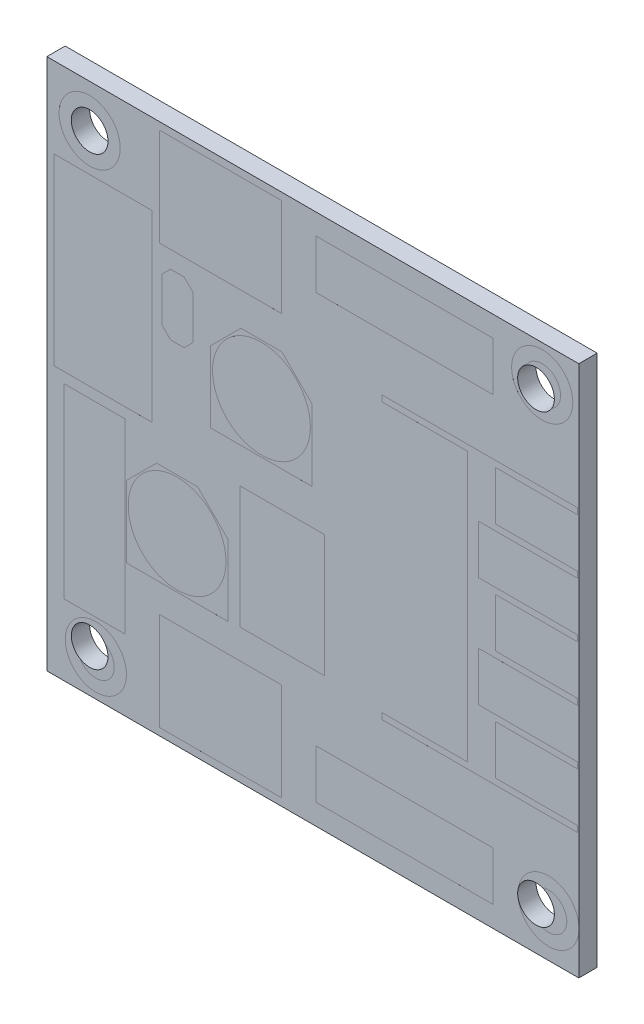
ISO-10303-21;
HEADER;
FILE_DESCRIPTION(('STEP AP214'),'2;1');
FILE_NAME('part.step','',(''),(''),'','','');
FILE_SCHEMA(('AUTOMOTIVE_DESIGN { 1 0 10303 214 1 1 1 1 }'));
ENDSEC;
DATA;
#1=APPLICATION_CONTEXT('core data for automotive mechanical design processes');
#2=APPLICATION_PROTOCOL_DEFINITION('international standard','automotive_design',2000,#1);
#3=PRODUCT_CONTEXT('',#1,'mechanical');
#4=PRODUCT('Part','Part','',(#3));
#5=PRODUCT_RELATED_PRODUCT_CATEGORY('part','',(#4));
#6=PRODUCT_DEFINITION_FORMATION('','',#4);
#7=PRODUCT_DEFINITION_CONTEXT('part definition',#1,'design');
#8=PRODUCT_DEFINITION('design','',#6,#7);
#9=PRODUCT_DEFINITION_SHAPE('','',#8);
#10=(LENGTH_UNIT() NAMED_UNIT(*) SI_UNIT(.MILLI.,.METRE.));
#11=(NAMED_UNIT(*) PLANE_ANGLE_UNIT() SI_UNIT($,.RADIAN.));
#12=(NAMED_UNIT(*) SI_UNIT($,.STERADIAN.) SOLID_ANGLE_UNIT());
#13=UNCERTAINTY_MEASURE_WITH_UNIT(LENGTH_MEASURE(1.E-05),#10,'distance_accuracy_value','');
#14=(GEOMETRIC_REPRESENTATION_CONTEXT(3) GLOBAL_UNCERTAINTY_ASSIGNED_CONTEXT((#13)) GLOBAL_UNIT_ASSIGNED_CONTEXT((#10,
#11,#12)) REPRESENTATION_CONTEXT('',''));
#15=CARTESIAN_POINT('',(0.,0.,0.));
#16=DIRECTION('',(0.,0.,1.));
#17=DIRECTION('',(1.,0.,0.));
#18=AXIS2_PLACEMENT_3D('',#15,#16,#17);
#19=CARTESIAN_POINT('',(0.,0.,1.5));
#20=DIRECTION('',(0.,0.,-1.));
#21=DIRECTION('',(-1.,0.,0.));
#22=AXIS2_PLACEMENT_3D('',#19,#20,#21);
#23=PLANE('',#22);
#24=DIRECTION('',(1.,0.,0.));
#25=VECTOR('',#24,1.);
#26=CARTESIAN_POINT('',(0.949999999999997,-10.75,1.5));
#27=LINE('',#26,#25);
#28=CARTESIAN_POINT('',(-5.95,-10.75,1.5));
#29=VERTEX_POINT('',#28);
#30=CARTESIAN_POINT('',(0.949999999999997,-10.75,1.5));
#31=VERTEX_POINT('',#30);
#32=EDGE_CURVE('E682',#29,#31,#27,.T.);
#33=ORIENTED_EDGE('',*,*,#32,.F.);
#34=DIRECTION('',(0.,-1.,0.));
#35=VECTOR('',#34,1.);
#36=CARTESIAN_POINT('',(-5.95000000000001,-0.750000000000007,1.5));
#37=LINE('',#36,#35);
#38=CARTESIAN_POINT('',(-5.95000000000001,-0.750000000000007,1.5));
#39=VERTEX_POINT('',#38);
#40=EDGE_CURVE('E51',#39,#29,#37,.T.);
#41=ORIENTED_EDGE('',*,*,#40,.F.);
#42=DIRECTION('',(-1.,0.,0.));
#43=VECTOR('',#42,1.);
#44=CARTESIAN_POINT('',(0.949999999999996,-0.750000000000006,1.5));
#45=LINE('',#44,#43);
#46=CARTESIAN_POINT('',(0.949999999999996,-0.750000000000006,1.5));
#47=VERTEX_POINT('',#46);
#48=EDGE_CURVE('E673',#47,#39,#45,.T.);
#49=ORIENTED_EDGE('',*,*,#48,.F.);
#50=DIRECTION('',(0.,1.,0.));
#51=VECTOR('',#50,1.);
#52=CARTESIAN_POINT('',(0.949999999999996,-0.750000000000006,1.5));
#53=LINE('',#52,#51);
#54=EDGE_CURVE('E676',#31,#47,#53,.T.);
#55=ORIENTED_EDGE('',*,*,#54,.F.);
#56=EDGE_LOOP('',(#33,#41,#49,#55));
#57=FACE_BOUND('',#56,.T.);
#58=DIRECTION('',(-0.707106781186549,-0.707106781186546,0.));
#59=VECTOR('',#58,1.);
#60=CARTESIAN_POINT('',(-11.64,11.75,1.5));
#61=LINE('',#60,#59);
#62=CARTESIAN_POINT('',(-11.64,11.75,1.5));
#63=VERTEX_POINT('',#62);
#64=CARTESIAN_POINT('',(-12.35,11.04,1.5));
#65=VERTEX_POINT('',#64);
#66=EDGE_CURVE('E718',#63,#65,#61,.T.);
#67=ORIENTED_EDGE('',*,*,#66,.F.);
#68=DIRECTION('',(-1.,0.,0.));
#69=VECTOR('',#68,1.);
#70=CARTESIAN_POINT('',(-10.52,11.75,1.5));
#71=LINE('',#70,#69);
#72=CARTESIAN_POINT('',(-10.52,11.75,1.5));
#73=VERTEX_POINT('',#72);
#74=EDGE_CURVE('E59',#73,#63,#71,.T.);
#75=ORIENTED_EDGE('',*,*,#74,.F.);
#76=DIRECTION('',(-0.707106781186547,0.707106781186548,0.));
#77=VECTOR('',#76,1.);
#78=CARTESIAN_POINT('',(-9.81,11.04,1.5));
#79=LINE('',#78,#77);
#80=CARTESIAN_POINT('',(-9.81,11.04,1.5));
#81=VERTEX_POINT('',#80);
#82=EDGE_CURVE('E695',#81,#73,#79,.T.);
#83=ORIENTED_EDGE('',*,*,#82,.F.);
#84=DIRECTION('',(0.,1.,0.));
#85=VECTOR('',#84,1.);
#86=CARTESIAN_POINT('',(-9.81,11.04,1.5));
#87=LINE('',#86,#85);
#88=CARTESIAN_POINT('',(-9.81,7.45999999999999,1.5));
#89=VERTEX_POINT('',#88);
#90=EDGE_CURVE('E733',#89,#81,#87,.T.);
#91=ORIENTED_EDGE('',*,*,#90,.F.);
#92=DIRECTION('',(0.707106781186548,0.707106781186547,0.));
#93=VECTOR('',#92,1.);
#94=CARTESIAN_POINT('',(-9.81,7.45999999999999,1.5));
#95=LINE('',#94,#93);
#96=CARTESIAN_POINT('',(-10.52,6.74999999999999,1.5));
#97=VERTEX_POINT('',#96);
#98=EDGE_CURVE('E730',#97,#89,#95,.T.);
#99=ORIENTED_EDGE('',*,*,#98,.F.);
#100=DIRECTION('',(1.,0.,0.));
#101=VECTOR('',#100,1.);
#102=CARTESIAN_POINT('',(-10.52,6.74999999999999,1.5));
#103=LINE('',#102,#101);
#104=CARTESIAN_POINT('',(-11.64,6.74999999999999,1.5));
#105=VERTEX_POINT('',#104);
#106=EDGE_CURVE('E727',#105,#97,#103,.T.);
#107=ORIENTED_EDGE('',*,*,#106,.F.);
#108=DIRECTION('',(0.707106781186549,-0.707106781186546,0.));
#109=VECTOR('',#108,1.);
#110=CARTESIAN_POINT('',(-11.64,6.74999999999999,1.5));
#111=LINE('',#110,#109);
#112=CARTESIAN_POINT('',(-12.35,7.45999999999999,1.5));
#113=VERTEX_POINT('',#112);
#114=EDGE_CURVE('E724',#113,#105,#111,.T.);
#115=ORIENTED_EDGE('',*,*,#114,.F.);
#116=DIRECTION('',(0.,-1.,0.));
#117=VECTOR('',#116,1.);
#118=CARTESIAN_POINT('',(-12.35,11.04,1.5));
#119=LINE('',#118,#117);
#120=EDGE_CURVE('E721',#65,#113,#119,.T.);
#121=ORIENTED_EDGE('',*,*,#120,.F.);
#122=EDGE_LOOP('',(#67,#75,#83,#91,#99,#107,#115,#121));
#123=FACE_BOUND('',#122,.T.);
#124=DIRECTION('',(1.,0.,0.));
#125=VECTOR('',#124,1.);
#126=CARTESIAN_POINT('',(-6.95000000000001,-10.85,1.5));
#127=LINE('',#126,#125);
#128=CARTESIAN_POINT('',(-15.25,-10.85,1.5));
#129=VERTEX_POINT('',#128);
#130=CARTESIAN_POINT('',(-6.95000000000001,-10.85,1.5));
#131=VERTEX_POINT('',#130);
#132=EDGE_CURVE('E783',#129,#131,#127,.T.);
#133=ORIENTED_EDGE('',*,*,#132,.F.);
#134=DIRECTION('',(0.,-1.,0.));
#135=VECTOR('',#134,1.);
#136=CARTESIAN_POINT('',(-15.25,-5.02,1.5));
#137=LINE('',#136,#135);
#138=CARTESIAN_POINT('',(-15.25,-5.02,1.5));
#139=VERTEX_POINT('',#138);
#140=EDGE_CURVE('E757',#139,#129,#137,.T.);
#141=ORIENTED_EDGE('',*,*,#140,.F.);
#142=DIRECTION('',(-0.707106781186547,-0.707106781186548,0.));
#143=VECTOR('',#142,1.);
#144=CARTESIAN_POINT('',(-12.78,-2.55,1.5));
#145=LINE('',#144,#143);
#146=CARTESIAN_POINT('',(-12.78,-2.55,1.5));
#147=VERTEX_POINT('',#146);
#148=EDGE_CURVE('E766',#147,#139,#145,.T.);
#149=ORIENTED_EDGE('',*,*,#148,.F.);
#150=DIRECTION('',(-1.,0.,0.));
#151=VECTOR('',#150,1.);
#152=CARTESIAN_POINT('',(-9.42000000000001,-2.55,1.5));
#153=LINE('',#152,#151);
#154=CARTESIAN_POINT('',(-9.42000000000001,-2.55,1.5));
#155=VERTEX_POINT('',#154);
#156=EDGE_CURVE('E792',#155,#147,#153,.T.);
#157=ORIENTED_EDGE('',*,*,#156,.F.);
#158=DIRECTION('',(-0.707106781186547,0.707106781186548,0.));
#159=VECTOR('',#158,1.);
#160=CARTESIAN_POINT('',(-6.95000000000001,-5.02,1.5));
#161=LINE('',#160,#159);
#162=CARTESIAN_POINT('',(-6.95000000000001,-5.02,1.5));
#163=VERTEX_POINT('',#162);
#164=EDGE_CURVE('E789',#163,#155,#161,.T.);
#165=ORIENTED_EDGE('',*,*,#164,.F.);
#166=DIRECTION('',(0.,1.,0.));
#167=VECTOR('',#166,1.);
#168=CARTESIAN_POINT('',(-6.95000000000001,-5.02,1.5));
#169=LINE('',#168,#167);
#170=EDGE_CURVE('E786',#131,#163,#169,.T.);
#171=ORIENTED_EDGE('',*,*,#170,.F.);
#172=EDGE_LOOP('',(#133,#141,#149,#157,#165,#171));
#173=FACE_BOUND('',#172,.T.);
#174=DIRECTION('',(1.,0.,0.));
#175=VECTOR('',#174,1.);
#176=CARTESIAN_POINT('',(0.250000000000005,-20.05,1.5));
#177=LINE('',#176,#175);
#178=CARTESIAN_POINT('',(0.250000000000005,-20.05,1.5));
#179=VERTEX_POINT('',#178);
#180=CARTESIAN_POINT('',(14.75,-20.05,1.5));
#181=VERTEX_POINT('',#180);
#182=EDGE_CURVE('E825',#179,#181,#177,.T.);
#183=ORIENTED_EDGE('',*,*,#182,.F.);
#184=DIRECTION('',(0.,-1.,0.));
#185=VECTOR('',#184,1.);
#186=CARTESIAN_POINT('',(0.250000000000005,-20.05,1.5));
#187=LINE('',#186,#185);
#188=CARTESIAN_POINT('',(0.250000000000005,-16.05,1.5));
#189=VERTEX_POINT('',#188);
#190=EDGE_CURVE('E740',#189,#179,#187,.T.);
#191=ORIENTED_EDGE('',*,*,#190,.F.);
#192=DIRECTION('',(-1.,0.,0.));
#193=VECTOR('',#192,1.);
#194=CARTESIAN_POINT('',(0.250000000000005,-16.05,1.5));
#195=LINE('',#194,#193);
#196=CARTESIAN_POINT('',(14.75,-16.05,1.5));
#197=VERTEX_POINT('',#196);
#198=EDGE_CURVE('E814',#197,#189,#195,.T.);
#199=ORIENTED_EDGE('',*,*,#198,.F.);
#200=DIRECTION('',(0.,1.,0.));
#201=VECTOR('',#200,1.);
#202=CARTESIAN_POINT('',(14.75,-20.05,1.5));
#203=LINE('',#202,#201);
#204=EDGE_CURVE('E828',#181,#197,#203,.T.);
#205=ORIENTED_EDGE('',*,*,#204,.F.);
#206=EDGE_LOOP('',(#183,#191,#199,#205));
#207=FACE_BOUND('',#206,.T.);
#208=DIRECTION('',(1.,0.,0.));
#209=VECTOR('',#208,1.);
#210=CARTESIAN_POINT('',(-15.35,-15.95,1.5));
#211=LINE('',#210,#209);
#212=CARTESIAN_POINT('',(-20.35,-15.95,1.5));
#213=VERTEX_POINT('',#212);
#214=CARTESIAN_POINT('',(-15.35,-15.95,1.5));
#215=VERTEX_POINT('',#214);
#216=EDGE_CURVE('E855',#213,#215,#211,.T.);
#217=ORIENTED_EDGE('',*,*,#216,.F.);
#218=DIRECTION('',(0.,-1.,0.));
#219=VECTOR('',#218,1.);
#220=CARTESIAN_POINT('',(-20.35,-0.710000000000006,1.5));
#221=LINE('',#220,#219);
#222=CARTESIAN_POINT('',(-20.35,-0.710000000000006,1.5));
#223=VERTEX_POINT('',#222);
#224=EDGE_CURVE('E799',#223,#213,#221,.T.);
#225=ORIENTED_EDGE('',*,*,#224,.F.);
#226=DIRECTION('',(-1.,0.,0.));
#227=VECTOR('',#226,1.);
#228=CARTESIAN_POINT('',(-15.35,-0.710000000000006,1.5));
#229=LINE('',#228,#227);
#230=CARTESIAN_POINT('',(-15.35,-0.710000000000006,1.5));
#231=VERTEX_POINT('',#230);
#232=EDGE_CURVE('E844',#231,#223,#229,.T.);
#233=ORIENTED_EDGE('',*,*,#232,.F.);
#234=DIRECTION('',(0.,1.,0.));
#235=VECTOR('',#234,1.);
#236=CARTESIAN_POINT('',(-15.35,-0.710000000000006,1.5));
#237=LINE('',#236,#235);
#238=EDGE_CURVE('E858',#215,#231,#237,.T.);
#239=ORIENTED_EDGE('',*,*,#238,.F.);
#240=EDGE_LOOP('',(#217,#225,#233,#239));
#241=FACE_BOUND('',#240,.T.);
#242=DIRECTION('',(1.,0.,0.));
#243=VECTOR('',#242,1.);
#244=CARTESIAN_POINT('',(14.75,16.05,1.5));
#245=LINE('',#244,#243);
#246=CARTESIAN_POINT('',(0.250000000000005,16.05,1.5));
#247=VERTEX_POINT('',#246);
#248=CARTESIAN_POINT('',(14.75,16.05,1.5));
#249=VERTEX_POINT('',#248);
#250=EDGE_CURVE('E887',#247,#249,#245,.T.);
#251=ORIENTED_EDGE('',*,*,#250,.F.);
#252=DIRECTION('',(0.,-1.,0.));
#253=VECTOR('',#252,1.);
#254=CARTESIAN_POINT('',(0.250000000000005,16.05,1.5));
#255=LINE('',#254,#253);
#256=CARTESIAN_POINT('',(0.250000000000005,20.05,1.5));
#257=VERTEX_POINT('',#256);
#258=EDGE_CURVE('E865',#257,#247,#255,.T.);
#259=ORIENTED_EDGE('',*,*,#258,.F.);
#260=DIRECTION('',(-1.,0.,0.));
#261=VECTOR('',#260,1.);
#262=CARTESIAN_POINT('',(14.75,20.05,1.5));
#263=LINE('',#262,#261);
#264=CARTESIAN_POINT('',(14.75,20.05,1.5));
#265=VERTEX_POINT('',#264);
#266=EDGE_CURVE('E876',#265,#257,#263,.T.);
#267=ORIENTED_EDGE('',*,*,#266,.F.);
#268=DIRECTION('',(0.,1.,0.));
#269=VECTOR('',#268,1.);
#270=CARTESIAN_POINT('',(14.75,16.05,1.5));
#271=LINE('',#270,#269);
#272=EDGE_CURVE('E890',#249,#265,#271,.T.);
#273=ORIENTED_EDGE('',*,*,#272,.F.);
#274=EDGE_LOOP('',(#251,#259,#267,#273));
#275=FACE_BOUND('',#274,.T.);
#276=DIRECTION('',(1.,0.,0.));
#277=VECTOR('',#276,1.);
#278=CARTESIAN_POINT('',(-0.0500000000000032,2.15,1.5));
#279=LINE('',#278,#277);
#280=CARTESIAN_POINT('',(-8.35,2.14999999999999,1.5));
#281=VERTEX_POINT('',#280);
#282=CARTESIAN_POINT('',(-0.0500000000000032,2.15,1.5));
#283=VERTEX_POINT('',#282);
#284=EDGE_CURVE('E931',#281,#283,#279,.T.);
#285=ORIENTED_EDGE('',*,*,#284,.F.);
#286=DIRECTION('',(0.,-1.,0.));
#287=VECTOR('',#286,1.);
#288=CARTESIAN_POINT('',(-8.35,7.97999999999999,1.5));
#289=LINE('',#288,#287);
#290=CARTESIAN_POINT('',(-8.35,7.97999999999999,1.5));
#291=VERTEX_POINT('',#290);
#292=EDGE_CURVE('E907',#291,#281,#289,.T.);
#293=ORIENTED_EDGE('',*,*,#292,.F.);
#294=DIRECTION('',(-0.707106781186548,-0.707106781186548,0.));
#295=VECTOR('',#294,1.);
#296=CARTESIAN_POINT('',(-5.88,10.45,1.5));
#297=LINE('',#296,#295);
#298=CARTESIAN_POINT('',(-5.88,10.45,1.5));
#299=VERTEX_POINT('',#298);
#300=EDGE_CURVE('E914',#299,#291,#297,.T.);
#301=ORIENTED_EDGE('',*,*,#300,.F.);
#302=DIRECTION('',(-1.,0.,0.));
#303=VECTOR('',#302,1.);
#304=CARTESIAN_POINT('',(-2.52000000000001,10.45,1.5));
#305=LINE('',#304,#303);
#306=CARTESIAN_POINT('',(-2.52000000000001,10.45,1.5));
#307=VERTEX_POINT('',#306);
#308=EDGE_CURVE('E940',#307,#299,#305,.T.);
#309=ORIENTED_EDGE('',*,*,#308,.F.);
#310=DIRECTION('',(-0.707106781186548,0.707106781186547,0.));
#311=VECTOR('',#310,1.);
#312=CARTESIAN_POINT('',(-0.0500000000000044,7.97999999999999,1.5));
#313=LINE('',#312,#311);
#314=CARTESIAN_POINT('',(-0.0500000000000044,7.97999999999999,1.5));
#315=VERTEX_POINT('',#314);
#316=EDGE_CURVE('E937',#315,#307,#313,.T.);
#317=ORIENTED_EDGE('',*,*,#316,.F.);
#318=DIRECTION('',(0.,1.,0.));
#319=VECTOR('',#318,1.);
#320=CARTESIAN_POINT('',(-0.0500000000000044,7.97999999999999,1.5));
#321=LINE('',#320,#319);
#322=EDGE_CURVE('E934',#283,#315,#321,.T.);
#323=ORIENTED_EDGE('',*,*,#322,.F.);
#324=EDGE_LOOP('',(#285,#293,#301,#309,#317,#323));
#325=FACE_BOUND('',#324,.T.);
#326=DIRECTION('',(1.,0.,0.));
#327=VECTOR('',#326,1.);
#328=CARTESIAN_POINT('',(-13.15,0.150000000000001,1.5));
#329=LINE('',#328,#327);
#330=CARTESIAN_POINT('',(-21.15,0.15,1.5));
#331=VERTEX_POINT('',#330);
#332=CARTESIAN_POINT('',(-13.15,0.150000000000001,1.5));
#333=VERTEX_POINT('',#332);
#334=EDGE_CURVE('E974',#331,#333,#329,.T.);
#335=ORIENTED_EDGE('',*,*,#334,.F.);
#336=DIRECTION('',(0.,-1.,0.));
#337=VECTOR('',#336,1.);
#338=CARTESIAN_POINT('',(-21.15,15.15,1.5));
#339=LINE('',#338,#337);
#340=CARTESIAN_POINT('',(-21.15,15.15,1.5));
#341=VERTEX_POINT('',#340);
#342=EDGE_CURVE('E972',#341,#331,#339,.T.);
#343=ORIENTED_EDGE('',*,*,#342,.F.);
#344=DIRECTION('',(-1.,0.,0.));
#345=VECTOR('',#344,1.);
#346=CARTESIAN_POINT('',(-13.15,15.15,1.5));
#347=LINE('',#346,#345);
#348=CARTESIAN_POINT('',(-13.15,15.15,1.5));
#349=VERTEX_POINT('',#348);
#350=EDGE_CURVE('E962',#349,#341,#347,.T.);
#351=ORIENTED_EDGE('',*,*,#350,.F.);
#352=DIRECTION('',(0.,1.,0.));
#353=VECTOR('',#352,1.);
#354=CARTESIAN_POINT('',(-13.15,15.15,1.5));
#355=LINE('',#354,#353);
#356=EDGE_CURVE('E978',#333,#349,#355,.T.);
#357=ORIENTED_EDGE('',*,*,#356,.F.);
#358=EDGE_LOOP('',(#335,#343,#351,#357));
#359=FACE_BOUND('',#358,.T.);
#360=DIRECTION('',(1.,0.,0.));
#361=VECTOR('',#360,1.);
#362=CARTESIAN_POINT('',(-2.55,13.15,1.5));
#363=LINE('',#362,#361);
#364=CARTESIAN_POINT('',(-12.55,13.15,1.5));
#365=VERTEX_POINT('',#364);
#366=CARTESIAN_POINT('',(-2.55,13.15,1.5));
#367=VERTEX_POINT('',#366);
#368=EDGE_CURVE('E1008',#365,#367,#363,.T.);
#369=ORIENTED_EDGE('',*,*,#368,.F.);
#370=DIRECTION('',(0.,-1.,0.));
#371=VECTOR('',#370,1.);
#372=CARTESIAN_POINT('',(-12.55,13.15,1.5));
#373=LINE('',#372,#371);
#374=CARTESIAN_POINT('',(-12.55,21.15,1.5));
#375=VERTEX_POINT('',#374);
#376=EDGE_CURVE('E1006',#375,#365,#373,.T.);
#377=ORIENTED_EDGE('',*,*,#376,.F.);
#378=DIRECTION('',(-1.,0.,0.));
#379=VECTOR('',#378,1.);
#380=CARTESIAN_POINT('',(-2.55,21.15,1.5));
#381=LINE('',#380,#379);
#382=CARTESIAN_POINT('',(-2.55,21.15,1.5));
#383=VERTEX_POINT('',#382);
#384=EDGE_CURVE('E996',#383,#375,#381,.T.);
#385=ORIENTED_EDGE('',*,*,#384,.F.);
#386=DIRECTION('',(0.,1.,0.));
#387=VECTOR('',#386,1.);
#388=CARTESIAN_POINT('',(-2.55,13.15,1.5));
#389=LINE('',#388,#387);
#390=EDGE_CURVE('E1012',#367,#383,#389,.T.);
#391=ORIENTED_EDGE('',*,*,#390,.F.);
#392=EDGE_LOOP('',(#369,#377,#385,#391));
#393=FACE_BOUND('',#392,.T.);
#394=DIRECTION('',(-1.,0.,0.));
#395=VECTOR('',#394,1.);
#396=CARTESIAN_POINT('',(-2.54999999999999,-13.15,1.5));
#397=LINE('',#396,#395);
#398=CARTESIAN_POINT('',(-2.54999999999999,-13.15,1.5));
#399=VERTEX_POINT('',#398);
#400=CARTESIAN_POINT('',(-12.55,-13.15,1.5));
#401=VERTEX_POINT('',#400);
#402=EDGE_CURVE('E1039',#399,#401,#397,.T.);
#403=ORIENTED_EDGE('',*,*,#402,.F.);
#404=DIRECTION('',(0.,1.,0.));
#405=VECTOR('',#404,1.);
#406=CARTESIAN_POINT('',(-2.54999999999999,-13.15,1.5));
#407=LINE('',#406,#405);
#408=CARTESIAN_POINT('',(-2.54999999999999,-21.15,1.5));
#409=VERTEX_POINT('',#408);
#410=EDGE_CURVE('E947',#409,#399,#407,.T.);
#411=ORIENTED_EDGE('',*,*,#410,.F.);
#412=DIRECTION('',(1.,0.,0.));
#413=VECTOR('',#412,1.);
#414=CARTESIAN_POINT('',(-2.54999999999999,-21.15,1.5));
#415=LINE('',#414,#413);
#416=CARTESIAN_POINT('',(-12.55,-21.15,1.5));
#417=VERTEX_POINT('',#416);
#418=EDGE_CURVE('E1028',#417,#409,#415,.T.);
#419=ORIENTED_EDGE('',*,*,#418,.F.);
#420=DIRECTION('',(0.,-1.,0.));
#421=VECTOR('',#420,1.);
#422=CARTESIAN_POINT('',(-12.55,-13.15,1.5));
#423=LINE('',#422,#421);
#424=EDGE_CURVE('E1042',#401,#417,#423,.T.);
#425=ORIENTED_EDGE('',*,*,#424,.F.);
#426=EDGE_LOOP('',(#403,#411,#419,#425));
#427=FACE_BOUND('',#426,.T.);
#428=CARTESIAN_POINT('',(18.25,-18.25,1.5));
#429=DIRECTION('',(0.,0.,1.));
#430=DIRECTION('',(1.,0.,0.));
#431=AXIS2_PLACEMENT_3D('',#428,#429,#430);
#432=CIRCLE('',#431,1.5);
#433=CARTESIAN_POINT('',(16.7940636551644,-17.8890992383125,1.5));
#434=VERTEX_POINT('',#433);
#435=CARTESIAN_POINT('',(16.7940636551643,-18.6109007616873,1.5));
#436=VERTEX_POINT('',#435);
#437=EDGE_CURVE('E1385',#434,#436,#432,.T.);
#438=ORIENTED_EDGE('',*,*,#437,.F.);
#439=CARTESIAN_POINT('',(19.2678766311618,-18.2500000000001,1.5));
#440=DIRECTION('',(0.,0.,1.));
#441=DIRECTION('',(1.,0.,0.));
#442=AXIS2_PLACEMENT_3D('',#439,#440,#441);
#443=CIRCLE('',#442,2.49999999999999);
#444=CARTESIAN_POINT('',(21.75,-17.9515647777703,1.5));
#445=VERTEX_POINT('',#444);
#446=EDGE_CURVE('E1349',#445,#434,#443,.T.);
#447=ORIENTED_EDGE('',*,*,#446,.F.);
#448=DIRECTION('',(0.,1.,0.));
#449=VECTOR('',#448,1.);
#450=CARTESIAN_POINT('',(21.75,21.75,1.5));
#451=LINE('',#450,#449);
#452=CARTESIAN_POINT('',(21.75,21.75,1.5));
#453=VERTEX_POINT('',#452);
#454=EDGE_CURVE('E1403',#445,#453,#451,.T.);
#455=ORIENTED_EDGE('',*,*,#454,.T.);
#456=DIRECTION('',(-1.,0.,0.));
#457=VECTOR('',#456,1.);
#458=CARTESIAN_POINT('',(21.75,21.75,1.5));
#459=LINE('',#458,#457);
#460=CARTESIAN_POINT('',(-21.75,21.75,1.5));
#461=VERTEX_POINT('',#460);
#462=EDGE_CURVE('E1407',#453,#461,#459,.T.);
#463=ORIENTED_EDGE('',*,*,#462,.T.);
#464=DIRECTION('',(0.,-1.,0.));
#465=VECTOR('',#464,1.);
#466=CARTESIAN_POINT('',(-21.75,21.75,1.5));
#467=LINE('',#466,#465);
#468=CARTESIAN_POINT('',(-21.75,-21.75,1.5));
#469=VERTEX_POINT('',#468);
#470=EDGE_CURVE('E1397',#461,#469,#467,.T.);
#471=ORIENTED_EDGE('',*,*,#470,.T.);
#472=DIRECTION('',(1.,0.,0.));
#473=VECTOR('',#472,1.);
#474=CARTESIAN_POINT('',(21.75,-21.75,1.5));
#475=LINE('',#474,#473);
#476=CARTESIAN_POINT('',(21.75,-21.75,1.5));
#477=VERTEX_POINT('',#476);
#478=EDGE_CURVE('E1400',#469,#477,#475,.T.);
#479=ORIENTED_EDGE('',*,*,#478,.T.);
#480=CARTESIAN_POINT('',(21.75,-18.5484352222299,1.5));
#481=VERTEX_POINT('',#480);
#482=EDGE_CURVE('E1404',#477,#481,#451,.T.);
#483=ORIENTED_EDGE('',*,*,#482,.T.);
#484=EDGE_CURVE('E1341',#436,#481,#443,.T.);
#485=ORIENTED_EDGE('',*,*,#484,.F.);
#486=EDGE_LOOP('',(#438,#447,#455,#463,#471,#479,#483,#485));
#487=FACE_BOUND('',#486,.T.);
#488=CARTESIAN_POINT('',(-18.25,18.25,1.5));
#489=DIRECTION('',(0.,0.,1.));
#490=DIRECTION('',(1.,0.,0.));
#491=AXIS2_PLACEMENT_3D('',#488,#489,#490);
#492=CIRCLE('',#491,2.5);
#493=CARTESIAN_POINT('',(-15.75,18.25,1.5));
#494=VERTEX_POINT('',#493);
#495=EDGE_CURVE('E1362',#494,#494,#492,.T.);
#496=ORIENTED_EDGE('',*,*,#495,.F.);
#497=EDGE_LOOP('',(#496));
#498=FACE_BOUND('',#497,.T.);
#499=CARTESIAN_POINT('',(18.758938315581,18.7589383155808,1.5));
#500=DIRECTION('',(0.,0.,1.));
#501=DIRECTION('',(1.,0.,0.));
#502=AXIS2_PLACEMENT_3D('',#499,#500,#501);
#503=CIRCLE('',#502,2.5);
#504=CARTESIAN_POINT('',(21.258938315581,18.7589383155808,1.5));
#505=VERTEX_POINT('',#504);
#506=EDGE_CURVE('E1328',#505,#505,#503,.T.);
#507=ORIENTED_EDGE('',*,*,#506,.F.);
#508=EDGE_LOOP('',(#507));
#509=FACE_BOUND('',#508,.T.);
#510=CARTESIAN_POINT('',(-17.7410616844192,-18.758938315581,1.5));
#511=DIRECTION('',(0.,0.,1.));
#512=DIRECTION('',(1.,0.,0.));
#513=AXIS2_PLACEMENT_3D('',#510,#511,#512);
#514=CIRCLE('',#513,2.5);
#515=CARTESIAN_POINT('',(-15.2410616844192,-18.758938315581,1.5));
#516=VERTEX_POINT('',#515);
#517=EDGE_CURVE('E1353',#516,#516,#514,.T.);
#518=ORIENTED_EDGE('',*,*,#517,.F.);
#519=EDGE_LOOP('',(#518));
#520=FACE_BOUND('',#519,.T.);
#521=DIRECTION('',(-3.88578058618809E-13,-1.,0.));
#522=VECTOR('',#521,1.);
#523=CARTESIAN_POINT('',(21.6500000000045,-8.41271496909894E-12,1.5));
#524=LINE('',#523,#522);
#525=CARTESIAN_POINT('',(21.6500000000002,-11.,1.5));
#526=VERTEX_POINT('',#525);
#527=CARTESIAN_POINT('',(21.65,-11.5,1.5));
#528=VERTEX_POINT('',#527);
#529=EDGE_CURVE('E985',#526,#528,#524,.T.);
#530=ORIENTED_EDGE('',*,*,#529,.T.);
#531=DIRECTION('',(-1.,0.,0.));
#532=VECTOR('',#531,1.);
#533=CARTESIAN_POINT('',(0.,-11.5,1.5));
#534=LINE('',#533,#532);
#535=CARTESIAN_POINT('',(5.65000000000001,-11.5,1.5));
#536=VERTEX_POINT('',#535);
#537=EDGE_CURVE('E1058',#528,#536,#534,.T.);
#538=ORIENTED_EDGE('',*,*,#537,.T.);
#539=DIRECTION('',(0.,-1.,0.));
#540=VECTOR('',#539,1.);
#541=CARTESIAN_POINT('',(5.65000000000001,0.,1.5));
#542=LINE('',#541,#540);
#543=CARTESIAN_POINT('',(5.65000000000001,-11.,1.5));
#544=VERTEX_POINT('',#543);
#545=EDGE_CURVE('E1195',#544,#536,#542,.T.);
#546=ORIENTED_EDGE('',*,*,#545,.F.);
#547=DIRECTION('',(1.,0.,0.));
#548=VECTOR('',#547,1.);
#549=CARTESIAN_POINT('',(0.,-11.,1.5));
#550=LINE('',#549,#548);
#551=CARTESIAN_POINT('',(12.65,-11.,1.5));
#552=VERTEX_POINT('',#551);
#553=EDGE_CURVE('E1192',#544,#552,#550,.T.);
#554=ORIENTED_EDGE('',*,*,#553,.T.);
#555=DIRECTION('',(0.,-1.,0.));
#556=VECTOR('',#555,1.);
#557=CARTESIAN_POINT('',(12.65,0.,1.5));
#558=LINE('',#557,#556);
#559=CARTESIAN_POINT('',(12.65,11.,1.5));
#560=VERTEX_POINT('',#559);
#561=EDGE_CURVE('E1189',#560,#552,#558,.T.);
#562=ORIENTED_EDGE('',*,*,#561,.F.);
#563=DIRECTION('',(1.,0.,0.));
#564=VECTOR('',#563,1.);
#565=CARTESIAN_POINT('',(0.,11.,1.5));
#566=LINE('',#565,#564);
#567=CARTESIAN_POINT('',(5.65000000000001,11.,1.5));
#568=VERTEX_POINT('',#567);
#569=EDGE_CURVE('E1186',#568,#560,#566,.T.);
#570=ORIENTED_EDGE('',*,*,#569,.F.);
#571=DIRECTION('',(0.,-1.,0.));
#572=VECTOR('',#571,1.);
#573=CARTESIAN_POINT('',(5.65000000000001,0.,1.5));
#574=LINE('',#573,#572);
#575=CARTESIAN_POINT('',(5.65000000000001,11.5,1.5));
#576=VERTEX_POINT('',#575);
#577=EDGE_CURVE('E1183',#576,#568,#574,.T.);
#578=ORIENTED_EDGE('',*,*,#577,.F.);
#579=DIRECTION('',(-1.,0.,0.));
#580=VECTOR('',#579,1.);
#581=CARTESIAN_POINT('',(0.,11.5,1.5));
#582=LINE('',#581,#580);
#583=CARTESIAN_POINT('',(21.65,11.5,1.5));
#584=VERTEX_POINT('',#583);
#585=EDGE_CURVE('E1180',#584,#576,#582,.T.);
#586=ORIENTED_EDGE('',*,*,#585,.F.);
#587=DIRECTION('',(0.,-1.,0.));
#588=VECTOR('',#587,1.);
#589=CARTESIAN_POINT('',(21.65,0.,1.5));
#590=LINE('',#589,#588);
#591=CARTESIAN_POINT('',(21.65,11.,1.5));
#592=VERTEX_POINT('',#591);
#593=EDGE_CURVE('E1177',#584,#592,#590,.T.);
#594=ORIENTED_EDGE('',*,*,#593,.T.);
#595=DIRECTION('',(-1.,0.,0.));
#596=VECTOR('',#595,1.);
#597=CARTESIAN_POINT('',(0.,11.,1.5));
#598=LINE('',#597,#596);
#599=CARTESIAN_POINT('',(14.95,11.,1.5));
#600=VERTEX_POINT('',#599);
#601=EDGE_CURVE('E1174',#592,#600,#598,.T.);
#602=ORIENTED_EDGE('',*,*,#601,.T.);
#603=DIRECTION('',(0.,-1.,0.));
#604=VECTOR('',#603,1.);
#605=CARTESIAN_POINT('',(14.95,0.,1.5));
#606=LINE('',#605,#604);
#607=CARTESIAN_POINT('',(14.95,6.99999999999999,1.5));
#608=VERTEX_POINT('',#607);
#609=EDGE_CURVE('E1171',#600,#608,#606,.T.);
#610=ORIENTED_EDGE('',*,*,#609,.T.);
#611=DIRECTION('',(1.,0.,0.));
#612=VECTOR('',#611,1.);
#613=CARTESIAN_POINT('',(0.,6.99999999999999,1.5));
#614=LINE('',#613,#612);
#615=CARTESIAN_POINT('',(21.65,6.99999999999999,1.5));
#616=VERTEX_POINT('',#615);
#617=EDGE_CURVE('E1168',#608,#616,#614,.T.);
#618=ORIENTED_EDGE('',*,*,#617,.T.);
#619=DIRECTION('',(0.,-1.,0.));
#620=VECTOR('',#619,1.);
#621=CARTESIAN_POINT('',(21.65,0.,1.5));
#622=LINE('',#621,#620);
#623=CARTESIAN_POINT('',(21.65,6.49999999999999,1.5));
#624=VERTEX_POINT('',#623);
#625=EDGE_CURVE('E1165',#616,#624,#622,.T.);
#626=ORIENTED_EDGE('',*,*,#625,.T.);
#627=DIRECTION('',(-1.,0.,0.));
#628=VECTOR('',#627,1.);
#629=CARTESIAN_POINT('',(0.,6.49999999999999,1.5));
#630=LINE('',#629,#628);
#631=CARTESIAN_POINT('',(13.55,6.49999999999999,1.5));
#632=VERTEX_POINT('',#631);
#633=EDGE_CURVE('E1162',#624,#632,#630,.T.);
#634=ORIENTED_EDGE('',*,*,#633,.T.);
#635=DIRECTION('',(0.,-1.,0.));
#636=VECTOR('',#635,1.);
#637=CARTESIAN_POINT('',(13.55,0.,1.5));
#638=LINE('',#637,#636);
#639=CARTESIAN_POINT('',(13.55,2.49999999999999,1.5));
#640=VERTEX_POINT('',#639);
#641=EDGE_CURVE('E1159',#632,#640,#638,.T.);
#642=ORIENTED_EDGE('',*,*,#641,.T.);
#643=DIRECTION('',(1.,0.,0.));
#644=VECTOR('',#643,1.);
#645=CARTESIAN_POINT('',(0.,2.49999999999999,1.5));
#646=LINE('',#645,#644);
#647=CARTESIAN_POINT('',(21.65,2.49999999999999,1.5));
#648=VERTEX_POINT('',#647);
#649=EDGE_CURVE('E1156',#640,#648,#646,.T.);
#650=ORIENTED_EDGE('',*,*,#649,.T.);
#651=DIRECTION('',(1.73472347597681E-13,-1.,0.));
#652=VECTOR('',#651,1.);
#653=CARTESIAN_POINT('',(21.6500000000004,3.75567632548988E-12,1.5));
#654=LINE('',#653,#652);
#655=CARTESIAN_POINT('',(21.6500000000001,1.99999999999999,1.5));
#656=VERTEX_POINT('',#655);
#657=EDGE_CURVE('E1153',#648,#656,#654,.T.);
#658=ORIENTED_EDGE('',*,*,#657,.T.);
#659=DIRECTION('',(-1.,0.,0.));
#660=VECTOR('',#659,1.);
#661=CARTESIAN_POINT('',(0.,1.99999999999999,1.5));
#662=LINE('',#661,#660);
#663=CARTESIAN_POINT('',(14.9500000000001,1.99999999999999,1.5));
#664=VERTEX_POINT('',#663);
#665=EDGE_CURVE('E1150',#656,#664,#662,.T.);
#666=ORIENTED_EDGE('',*,*,#665,.T.);
#667=DIRECTION('',(0.,-1.,0.));
#668=VECTOR('',#667,1.);
#669=CARTESIAN_POINT('',(14.9500000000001,0.,1.5));
#670=LINE('',#669,#668);
#671=CARTESIAN_POINT('',(14.9500000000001,-2.00000000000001,1.5));
#672=VERTEX_POINT('',#671);
#673=EDGE_CURVE('E1147',#664,#672,#670,.T.);
#674=ORIENTED_EDGE('',*,*,#673,.T.);
#675=DIRECTION('',(1.,0.,0.));
#676=VECTOR('',#675,1.);
#677=CARTESIAN_POINT('',(0.,-2.00000000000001,1.5));
#678=LINE('',#677,#676);
#679=CARTESIAN_POINT('',(21.6500000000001,-2.00000000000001,1.5));
#680=VERTEX_POINT('',#679);
#681=EDGE_CURVE('E1144',#672,#680,#678,.T.);
#682=ORIENTED_EDGE('',*,*,#681,.T.);
#683=DIRECTION('',(0.,-1.,0.));
#684=VECTOR('',#683,1.);
#685=CARTESIAN_POINT('',(21.6500000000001,0.,1.5));
#686=LINE('',#685,#684);
#687=CARTESIAN_POINT('',(21.6500000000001,-2.50000000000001,1.5));
#688=VERTEX_POINT('',#687);
#689=EDGE_CURVE('E1141',#680,#688,#686,.T.);
#690=ORIENTED_EDGE('',*,*,#689,.T.);
#691=DIRECTION('',(-1.,0.,0.));
#692=VECTOR('',#691,1.);
#693=CARTESIAN_POINT('',(0.,-2.50000000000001,1.5));
#694=LINE('',#693,#692);
#695=CARTESIAN_POINT('',(13.5500000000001,-2.50000000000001,1.5));
#696=VERTEX_POINT('',#695);
#697=EDGE_CURVE('E1138',#688,#696,#694,.T.);
#698=ORIENTED_EDGE('',*,*,#697,.T.);
#699=DIRECTION('',(0.,-1.,0.));
#700=VECTOR('',#699,1.);
#701=CARTESIAN_POINT('',(13.5500000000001,0.,1.5));
#702=LINE('',#701,#700);
#703=CARTESIAN_POINT('',(13.5500000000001,-6.50000000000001,1.5));
#704=VERTEX_POINT('',#703);
#705=EDGE_CURVE('E1135',#696,#704,#702,.T.);
#706=ORIENTED_EDGE('',*,*,#705,.T.);
#707=DIRECTION('',(1.,0.,0.));
#708=VECTOR('',#707,1.);
#709=CARTESIAN_POINT('',(0.,-6.50000000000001,1.5));
#710=LINE('',#709,#708);
#711=CARTESIAN_POINT('',(21.6500000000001,-6.50000000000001,1.5));
#712=VERTEX_POINT('',#711);
#713=EDGE_CURVE('E1132',#704,#712,#710,.T.);
#714=ORIENTED_EDGE('',*,*,#713,.T.);
#715=DIRECTION('',(1.73472347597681E-13,-1.,0.));
#716=VECTOR('',#715,1.);
#717=CARTESIAN_POINT('',(21.649999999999,3.75567632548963E-12,1.5));
#718=LINE('',#717,#716);
#719=CARTESIAN_POINT('',(21.6500000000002,-7.,1.5));
#720=VERTEX_POINT('',#719);
#721=EDGE_CURVE('E1129',#712,#720,#718,.T.);
#722=ORIENTED_EDGE('',*,*,#721,.T.);
#723=DIRECTION('',(-1.,0.,0.));
#724=VECTOR('',#723,1.);
#725=CARTESIAN_POINT('',(0.,-7.,1.5));
#726=LINE('',#725,#724);
#727=CARTESIAN_POINT('',(14.9500000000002,-7.,1.5));
#728=VERTEX_POINT('',#727);
#729=EDGE_CURVE('E1126',#720,#728,#726,.T.);
#730=ORIENTED_EDGE('',*,*,#729,.T.);
#731=DIRECTION('',(0.,-1.,0.));
#732=VECTOR('',#731,1.);
#733=CARTESIAN_POINT('',(14.9500000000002,0.,1.5));
#734=LINE('',#733,#732);
#735=CARTESIAN_POINT('',(14.9500000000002,-11.,1.5));
#736=VERTEX_POINT('',#735);
#737=EDGE_CURVE('E1123',#728,#736,#734,.T.);
#738=ORIENTED_EDGE('',*,*,#737,.T.);
#739=DIRECTION('',(1.,0.,0.));
#740=VECTOR('',#739,1.);
#741=CARTESIAN_POINT('',(0.,-11.,1.5));
#742=LINE('',#741,#740);
#743=EDGE_CURVE('E1120',#736,#526,#742,.T.);
#744=ORIENTED_EDGE('',*,*,#743,.T.);
#745=EDGE_LOOP('',(#530,#538,#546,#554,#562,#570,#578,#586,#594,#602,#610,#618,#626,#634,#642,
#650,#658,#666,#674,#682,#690,#698,#706,#714,#722,#730,#738,#744));
#746=FACE_BOUND('',#745,.T.);
#747=ADVANCED_FACE('F36',(#57,#123,#173,#207,#241,#275,#325,#359,#393,#427,#487,#498,#509,#520,
#746),#23,.F.);
#748=CARTESIAN_POINT('',(18.25,18.25,1.5));
#749=DIRECTION('',(0.,0.,-1.));
#750=DIRECTION('',(-1.,0.,0.));
#751=AXIS2_PLACEMENT_3D('',#748,#749,#750);
#752=CYLINDRICAL_SURFACE('',#751,1.5);
#753=CARTESIAN_POINT('',(18.25,18.25,1.4999));
#754=DIRECTION('',(0.,0.,1.));
#755=DIRECTION('',(1.,0.,0.));
#756=AXIS2_PLACEMENT_3D('',#753,#754,#755);
#757=CIRCLE('',#756,1.5);
#758=CARTESIAN_POINT('',(17.4747869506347,19.5341513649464,1.4999));
#759=VERTEX_POINT('',#758);
#760=CARTESIAN_POINT('',(19.5341513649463,17.4747869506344,1.4999));
#761=VERTEX_POINT('',#760);
#762=EDGE_CURVE('E1456',#759,#761,#757,.T.);
#763=ORIENTED_EDGE('',*,*,#762,.T.);
#764=DIRECTION('',(0.,0.,1.));
#765=VECTOR('',#764,1.);
#766=CARTESIAN_POINT('',(19.5341513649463,17.4747869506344,1.49995));
#767=LINE('',#766,#765);
#768=CARTESIAN_POINT('',(19.5341513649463,17.4747869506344,1.5));
#769=VERTEX_POINT('',#768);
#770=EDGE_CURVE('E1459',#761,#769,#767,.T.);
#771=ORIENTED_EDGE('',*,*,#770,.T.);
#772=CARTESIAN_POINT('',(18.25,18.25,1.5));
#773=DIRECTION('',(0.,0.,1.));
#774=DIRECTION('',(1.,0.,0.));
#775=AXIS2_PLACEMENT_3D('',#772,#773,#774);
#776=CIRCLE('',#775,1.5);
#777=CARTESIAN_POINT('',(17.4747869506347,19.5341513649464,1.5));
#778=VERTEX_POINT('',#777);
#779=EDGE_CURVE('E1386',#769,#778,#776,.T.);
#780=ORIENTED_EDGE('',*,*,#779,.T.);
#781=DIRECTION('',(0.,0.,1.));
#782=VECTOR('',#781,1.);
#783=CARTESIAN_POINT('',(17.4747869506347,19.5341513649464,1.49995));
#784=LINE('',#783,#782);
#785=EDGE_CURVE('E1453',#778,#759,#784,.F.);
#786=ORIENTED_EDGE('',*,*,#785,.T.);
#787=EDGE_LOOP('',(#763,#771,#780,#786));
#788=FACE_BOUND('',#787,.T.);
#789=CARTESIAN_POINT('',(18.25,18.25,0.));
#790=DIRECTION('',(0.,0.,1.));
#791=DIRECTION('',(1.,0.,0.));
#792=AXIS2_PLACEMENT_3D('',#789,#790,#791);
#793=CIRCLE('',#792,1.5);
#794=CARTESIAN_POINT('',(19.5341513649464,17.4747869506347,0.));
#795=VERTEX_POINT('',#794);
#796=CARTESIAN_POINT('',(17.4747869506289,19.5341513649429,0.));
#797=VERTEX_POINT('',#796);
#798=EDGE_CURVE('E1390',#795,#797,#793,.T.);
#799=ORIENTED_EDGE('',*,*,#798,.F.);
#800=DIRECTION('',(0.,0.,-1.));
#801=VECTOR('',#800,1.);
#802=CARTESIAN_POINT('',(19.5341513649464,17.4747869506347,0.001));
#803=LINE('',#802,#801);
#804=CARTESIAN_POINT('',(19.5341513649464,17.4747869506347,0.002));
#805=VERTEX_POINT('',#804);
#806=EDGE_CURVE('E1310',#795,#805,#803,.F.);
#807=ORIENTED_EDGE('',*,*,#806,.T.);
#808=CARTESIAN_POINT('',(18.25,18.25,0.00200000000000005));
#809=DIRECTION('',(0.,0.,-1.));
#810=DIRECTION('',(-1.,0.,0.));
#811=AXIS2_PLACEMENT_3D('',#808,#809,#810);
#812=CIRCLE('',#811,1.5);
#813=CARTESIAN_POINT('',(17.4747869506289,19.5341513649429,0.002));
#814=VERTEX_POINT('',#813);
#815=EDGE_CURVE('E11',#805,#814,#812,.T.);
#816=ORIENTED_EDGE('',*,*,#815,.T.);
#817=DIRECTION('',(0.,0.,-1.));
#818=VECTOR('',#817,1.);
#819=CARTESIAN_POINT('',(17.4747869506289,19.5341513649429,0.001));
#820=LINE('',#819,#818);
#821=EDGE_CURVE('E1307',#814,#797,#820,.T.);
#822=ORIENTED_EDGE('',*,*,#821,.T.);
#823=EDGE_LOOP('',(#799,#807,#816,#822));
#824=FACE_BOUND('',#823,.T.);
#825=ADVANCED_FACE('F1494',(#788,#824),#752,.F.);
#826=CARTESIAN_POINT('',(-18.25,-18.25,1.5));
#827=DIRECTION('',(0.,0.,-1.));
#828=DIRECTION('',(-1.,0.,0.));
#829=AXIS2_PLACEMENT_3D('',#826,#827,#828);
#830=CYLINDRICAL_SURFACE('',#829,1.5);
#831=CARTESIAN_POINT('',(-18.25,-18.25,1.4999));
#832=DIRECTION('',(0.,0.,1.));
#833=DIRECTION('',(1.,0.,0.));
#834=AXIS2_PLACEMENT_3D('',#831,#832,#833);
#835=CIRCLE('',#834,1.5);
#836=CARTESIAN_POINT('',(-16.9658486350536,-17.4747869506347,1.4999));
#837=VERTEX_POINT('',#836);
#838=CARTESIAN_POINT('',(-19.0252130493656,-19.5341513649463,1.4999));
#839=VERTEX_POINT('',#838);
#840=EDGE_CURVE('E1433',#837,#839,#835,.T.);
#841=ORIENTED_EDGE('',*,*,#840,.T.);
#842=DIRECTION('',(0.,0.,1.));
#843=VECTOR('',#842,1.);
#844=CARTESIAN_POINT('',(-19.0252130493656,-19.5341513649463,1.49995));
#845=LINE('',#844,#843);
#846=CARTESIAN_POINT('',(-19.0252130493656,-19.5341513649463,1.5));
#847=VERTEX_POINT('',#846);
#848=EDGE_CURVE('E1436',#839,#847,#845,.T.);
#849=ORIENTED_EDGE('',*,*,#848,.T.);
#850=CARTESIAN_POINT('',(-18.25,-18.25,1.5));
#851=DIRECTION('',(0.,0.,1.));
#852=DIRECTION('',(1.,0.,0.));
#853=AXIS2_PLACEMENT_3D('',#850,#851,#852);
#854=CIRCLE('',#853,1.5);
#855=CARTESIAN_POINT('',(-16.9658486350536,-17.4747869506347,1.5));
#856=VERTEX_POINT('',#855);
#857=EDGE_CURVE('E1377',#847,#856,#854,.T.);
#858=ORIENTED_EDGE('',*,*,#857,.T.);
#859=DIRECTION('',(0.,0.,1.));
#860=VECTOR('',#859,1.);
#861=CARTESIAN_POINT('',(-16.9658486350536,-17.4747869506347,1.49995));
#862=LINE('',#861,#860);
#863=EDGE_CURVE('E1430',#856,#837,#862,.F.);
#864=ORIENTED_EDGE('',*,*,#863,.T.);
#865=EDGE_LOOP('',(#841,#849,#858,#864));
#866=FACE_BOUND('',#865,.T.);
#867=CARTESIAN_POINT('',(-18.25,-18.25,0.));
#868=DIRECTION('',(0.,0.,1.));
#869=DIRECTION('',(1.,0.,0.));
#870=AXIS2_PLACEMENT_3D('',#867,#868,#869);
#871=CIRCLE('',#870,1.5);
#872=CARTESIAN_POINT('',(-17.4747869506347,-16.9658486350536,0.));
#873=VERTEX_POINT('',#872);
#874=CARTESIAN_POINT('',(-19.5341513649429,-19.0252130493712,0.));
#875=VERTEX_POINT('',#874);
#876=EDGE_CURVE('E1376',#873,#875,#871,.T.);
#877=ORIENTED_EDGE('',*,*,#876,.F.);
#878=DIRECTION('',(0.,0.,-1.));
#879=VECTOR('',#878,1.);
#880=CARTESIAN_POINT('',(-17.4747869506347,-16.9658486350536,0.001));
#881=LINE('',#880,#879);
#882=CARTESIAN_POINT('',(-17.4747869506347,-16.9658486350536,0.002));
#883=VERTEX_POINT('',#882);
#884=EDGE_CURVE('E1322',#873,#883,#881,.F.);
#885=ORIENTED_EDGE('',*,*,#884,.T.);
#886=CARTESIAN_POINT('',(-18.25,-18.25,0.00200000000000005));
#887=DIRECTION('',(0.,0.,-1.));
#888=DIRECTION('',(-1.,0.,0.));
#889=AXIS2_PLACEMENT_3D('',#886,#887,#888);
#890=CIRCLE('',#889,1.5);
#891=CARTESIAN_POINT('',(-19.5341513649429,-19.0252130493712,0.002));
#892=VERTEX_POINT('',#891);
#893=EDGE_CURVE('E44',#883,#892,#890,.T.);
#894=ORIENTED_EDGE('',*,*,#893,.T.);
#895=DIRECTION('',(0.,0.,-1.));
#896=VECTOR('',#895,1.);
#897=CARTESIAN_POINT('',(-19.5341513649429,-19.0252130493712,0.001));
#898=LINE('',#897,#896);
#899=EDGE_CURVE('E1319',#892,#875,#898,.T.);
#900=ORIENTED_EDGE('',*,*,#899,.T.);
#901=EDGE_LOOP('',(#877,#885,#894,#900));
#902=FACE_BOUND('',#901,.T.);
#903=ADVANCED_FACE('F1475',(#866,#902),#830,.F.);
#904=CARTESIAN_POINT('',(0.,0.,0.));
#905=DIRECTION('',(0.,0.,-1.));
#906=DIRECTION('',(-1.,0.,0.));
#907=AXIS2_PLACEMENT_3D('',#904,#905,#906);
#908=PLANE('',#907);
#909=ORIENTED_EDGE('',*,*,#876,.T.);
#910=CARTESIAN_POINT('',(-18.7589383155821,-17.7410616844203,0.));
#911=DIRECTION('',(0.,0.,-1.));
#912=DIRECTION('',(-1.,0.,0.));
#913=AXIS2_PLACEMENT_3D('',#910,#911,#912);
#914=CIRCLE('',#913,1.50000000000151);
#915=EDGE_CURVE('E1470',#875,#873,#914,.T.);
#916=ORIENTED_EDGE('',*,*,#915,.T.);
#917=EDGE_LOOP('',(#909,#916));
#918=FACE_BOUND('',#917,.T.);
#919=ADVANCED_FACE('F1483',(#918),#908,.T.);
#920=CARTESIAN_POINT('',(-18.25,18.25,0.));
#921=DIRECTION('',(0.,0.,1.));
#922=DIRECTION('',(1.,0.,0.));
#923=AXIS2_PLACEMENT_3D('',#920,#921,#922);
#924=CIRCLE('',#923,1.5);
#925=CARTESIAN_POINT('',(-16.838978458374,18.7589383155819,0.));
#926=VERTEX_POINT('',#925);
#927=CARTESIAN_POINT('',(-19.6610215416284,18.7589383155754,0.));
#928=VERTEX_POINT('',#927);
#929=EDGE_CURVE('E1393',#926,#928,#924,.T.);
#930=ORIENTED_EDGE('',*,*,#929,.T.);
#931=CARTESIAN_POINT('',(-18.2500000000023,19.2678766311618,0.));
#932=DIRECTION('',(0.,0.,-1.));
#933=DIRECTION('',(-1.,0.,0.));
#934=AXIS2_PLACEMENT_3D('',#931,#932,#933);
#935=CIRCLE('',#934,1.50000000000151);
#936=EDGE_CURVE('E1276',#928,#926,#935,.T.);
#937=ORIENTED_EDGE('',*,*,#936,.T.);
#938=EDGE_LOOP('',(#930,#937));
#939=FACE_BOUND('',#938,.T.);
#940=ADVANCED_FACE('F1485',(#939),#908,.T.);
#941=ORIENTED_EDGE('',*,*,#798,.T.);
#942=CARTESIAN_POINT('',(18.7589383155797,18.7589383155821,0.));
#943=DIRECTION('',(0.,0.,-1.));
#944=DIRECTION('',(-1.,0.,0.));
#945=AXIS2_PLACEMENT_3D('',#942,#943,#944);
#946=CIRCLE('',#945,1.50000000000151);
#947=EDGE_CURVE('E1262',#797,#795,#946,.T.);
#948=ORIENTED_EDGE('',*,*,#947,.T.);
#949=EDGE_LOOP('',(#941,#948));
#950=FACE_BOUND('',#949,.T.);
#951=ADVANCED_FACE('F1492',(#950),#908,.T.);
#952=CARTESIAN_POINT('',(18.25,-18.25,1.5));
#953=DIRECTION('',(0.,0.,-1.));
#954=DIRECTION('',(-1.,0.,0.));
#955=AXIS2_PLACEMENT_3D('',#952,#953,#954);
#956=CYLINDRICAL_SURFACE('',#955,1.5);
#957=DIRECTION('',(0.,0.,1.));
#958=VECTOR('',#957,1.);
#959=CARTESIAN_POINT('',(16.7940636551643,-18.6109007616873,1.49995));
#960=LINE('',#959,#958);
#961=CARTESIAN_POINT('',(16.7940636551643,-18.6109007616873,1.4999));
#962=VERTEX_POINT('',#961);
#963=EDGE_CURVE('E1451',#962,#436,#960,.T.);
#964=ORIENTED_EDGE('',*,*,#963,.F.);
#965=CARTESIAN_POINT('',(18.25,-18.25,1.4999));
#966=DIRECTION('',(0.,0.,1.));
#967=DIRECTION('',(1.,0.,0.));
#968=AXIS2_PLACEMENT_3D('',#965,#966,#967);
#969=CIRCLE('',#968,1.5);
#970=CARTESIAN_POINT('',(18.7589383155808,-19.6610215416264,1.4999));
#971=VERTEX_POINT('',#970);
#972=EDGE_CURVE('E1446',#962,#971,#969,.T.);
#973=ORIENTED_EDGE('',*,*,#972,.T.);
#974=DIRECTION('',(0.,0.,1.));
#975=VECTOR('',#974,1.);
#976=CARTESIAN_POINT('',(18.7589383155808,-19.6610215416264,1.49995));
#977=LINE('',#976,#975);
#978=CARTESIAN_POINT('',(18.7589383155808,-19.6610215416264,1.5));
#979=VERTEX_POINT('',#978);
#980=EDGE_CURVE('E1448',#971,#979,#977,.T.);
#981=ORIENTED_EDGE('',*,*,#980,.T.);
#982=CARTESIAN_POINT('',(18.758938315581,-16.8389784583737,1.5));
#983=VERTEX_POINT('',#982);
#984=EDGE_CURVE('E1380',#979,#983,#432,.T.);
#985=ORIENTED_EDGE('',*,*,#984,.T.);
#986=DIRECTION('',(0.,0.,1.));
#987=VECTOR('',#986,1.);
#988=CARTESIAN_POINT('',(18.758938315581,-16.8389784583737,1.49995));
#989=LINE('',#988,#987);
#990=CARTESIAN_POINT('',(18.758938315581,-16.8389784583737,1.4999));
#991=VERTEX_POINT('',#990);
#992=EDGE_CURVE('E1439',#983,#991,#989,.F.);
#993=ORIENTED_EDGE('',*,*,#992,.T.);
#994=CARTESIAN_POINT('',(16.7940636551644,-17.8890992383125,1.4999));
#995=VERTEX_POINT('',#994);
#996=EDGE_CURVE('E1442',#991,#995,#969,.T.);
#997=ORIENTED_EDGE('',*,*,#996,.T.);
#998=DIRECTION('',(0.,0.,1.));
#999=VECTOR('',#998,1.);
#1000=CARTESIAN_POINT('',(16.7940636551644,-17.8890992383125,1.49995));
#1001=LINE('',#1000,#999);
#1002=EDGE_CURVE('E1445',#434,#995,#1001,.F.);
#1003=ORIENTED_EDGE('',*,*,#1002,.F.);
#1004=ORIENTED_EDGE('',*,*,#437,.T.);
#1005=EDGE_LOOP('',(#964,#973,#981,#985,#993,#997,#1003,#1004));
#1006=FACE_BOUND('',#1005,.T.);
#1007=CARTESIAN_POINT('',(18.25,-18.25,0.002));
#1008=DIRECTION('',(0.,0.,-1.));
#1009=DIRECTION('',(-1.,0.,0.));
#1010=AXIS2_PLACEMENT_3D('',#1007,#1008,#1009);
#1011=CIRCLE('',#1010,1.50000000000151);
#1012=CARTESIAN_POINT('',(16.7499999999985,-18.25,0.002));
#1013=VERTEX_POINT('',#1012);
#1014=EDGE_CURVE('E1269',#1013,#1013,#1011,.T.);
#1015=ORIENTED_EDGE('',*,*,#1014,.T.);
#1016=EDGE_LOOP('',(#1015));
#1017=FACE_BOUND('',#1016,.T.);
#1018=ADVANCED_FACE('F1773',(#1006,#1017),#956,.F.);
#1019=CARTESIAN_POINT('',(-17.7410616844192,-18.758938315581,1.5));
#1020=DIRECTION('',(0.,0.,1.));
#1021=DIRECTION('',(1.,0.,0.));
#1022=AXIS2_PLACEMENT_3D('',#1019,#1020,#1021);
#1023=CIRCLE('',#1022,1.5);
#1024=EDGE_CURVE('E1325',#847,#856,#1023,.T.);
#1025=ORIENTED_EDGE('',*,*,#1024,.T.);
#1026=ORIENTED_EDGE('',*,*,#857,.F.);
#1027=EDGE_LOOP('',(#1025,#1026));
#1028=FACE_BOUND('',#1027,.T.);
#1029=ADVANCED_FACE('F1526',(#1028),#23,.F.);
#1030=CARTESIAN_POINT('',(19.2678766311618,-18.2500000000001,1.5));
#1031=DIRECTION('',(0.,0.,1.));
#1032=DIRECTION('',(1.,0.,0.));
#1033=AXIS2_PLACEMENT_3D('',#1030,#1031,#1032);
#1034=CIRCLE('',#1033,1.5);
#1035=EDGE_CURVE('E1342',#979,#983,#1034,.T.);
#1036=ORIENTED_EDGE('',*,*,#1035,.T.);
#1037=ORIENTED_EDGE('',*,*,#984,.F.);
#1038=EDGE_LOOP('',(#1036,#1037));
#1039=FACE_BOUND('',#1038,.T.);
#1040=ADVANCED_FACE('F1519',(#1039),#23,.F.);
#1041=CARTESIAN_POINT('',(18.758938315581,18.7589383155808,1.5));
#1042=DIRECTION('',(0.,0.,1.));
#1043=DIRECTION('',(1.,0.,0.));
#1044=AXIS2_PLACEMENT_3D('',#1041,#1042,#1043);
#1045=CIRCLE('',#1044,1.5);
#1046=EDGE_CURVE('E1329',#769,#778,#1045,.T.);
#1047=ORIENTED_EDGE('',*,*,#1046,.T.);
#1048=ORIENTED_EDGE('',*,*,#779,.F.);
#1049=EDGE_LOOP('',(#1047,#1048));
#1050=FACE_BOUND('',#1049,.T.);
#1051=ADVANCED_FACE('F1505',(#1050),#23,.F.);
#1052=CARTESIAN_POINT('',(-18.25,18.25,1.5));
#1053=DIRECTION('',(0.,0.,-1.));
#1054=DIRECTION('',(-1.,0.,0.));
#1055=AXIS2_PLACEMENT_3D('',#1052,#1053,#1054);
#1056=CYLINDRICAL_SURFACE('',#1055,1.5);
#1057=DIRECTION('',(0.,0.,-1.));
#1058=VECTOR('',#1057,1.);
#1059=CARTESIAN_POINT('',(-17.8890992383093,16.7940636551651,0.001));
#1060=LINE('',#1059,#1058);
#1061=CARTESIAN_POINT('',(-17.8890992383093,16.7940636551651,0.));
#1062=VERTEX_POINT('',#1061);
#1063=CARTESIAN_POINT('',(-17.8890992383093,16.7940636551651,0.00200000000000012));
#1064=VERTEX_POINT('',#1063);
#1065=EDGE_CURVE('E1305',#1062,#1064,#1060,.F.);
#1066=ORIENTED_EDGE('',*,*,#1065,.F.);
#1067=CARTESIAN_POINT('',(-18.610900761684,16.7940636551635,0.));
#1068=VERTEX_POINT('',#1067);
#1069=EDGE_CURVE('E1389',#1068,#1062,#924,.T.);
#1070=ORIENTED_EDGE('',*,*,#1069,.F.);
#1071=DIRECTION('',(0.,0.,-1.));
#1072=VECTOR('',#1071,1.);
#1073=CARTESIAN_POINT('',(-18.610900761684,16.7940636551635,0.001));
#1074=LINE('',#1073,#1072);
#1075=CARTESIAN_POINT('',(-18.610900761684,16.7940636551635,0.00200000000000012));
#1076=VERTEX_POINT('',#1075);
#1077=EDGE_CURVE('E1303',#1076,#1068,#1074,.T.);
#1078=ORIENTED_EDGE('',*,*,#1077,.F.);
#1079=CARTESIAN_POINT('',(-18.25,18.25,0.00200000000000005));
#1080=DIRECTION('',(0.,0.,-1.));
#1081=DIRECTION('',(-1.,0.,0.));
#1082=AXIS2_PLACEMENT_3D('',#1079,#1080,#1081);
#1083=CIRCLE('',#1082,1.5);
#1084=CARTESIAN_POINT('',(-19.6610215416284,18.7589383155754,0.002));
#1085=VERTEX_POINT('',#1084);
#1086=EDGE_CURVE('E1297',#1076,#1085,#1083,.T.);
#1087=ORIENTED_EDGE('',*,*,#1086,.T.);
#1088=DIRECTION('',(0.,0.,-1.));
#1089=VECTOR('',#1088,1.);
#1090=CARTESIAN_POINT('',(-19.6610215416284,18.7589383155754,0.001));
#1091=LINE('',#1090,#1089);
#1092=EDGE_CURVE('E1313',#1085,#928,#1091,.T.);
#1093=ORIENTED_EDGE('',*,*,#1092,.T.);
#1094=ORIENTED_EDGE('',*,*,#929,.F.);
#1095=DIRECTION('',(0.,0.,-1.));
#1096=VECTOR('',#1095,1.);
#1097=CARTESIAN_POINT('',(-16.838978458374,18.7589383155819,0.001));
#1098=LINE('',#1097,#1096);
#1099=CARTESIAN_POINT('',(-16.838978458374,18.7589383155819,0.002));
#1100=VERTEX_POINT('',#1099);
#1101=EDGE_CURVE('E1316',#926,#1100,#1098,.F.);
#1102=ORIENTED_EDGE('',*,*,#1101,.T.);
#1103=EDGE_CURVE('E1302',#1100,#1064,#1083,.T.);
#1104=ORIENTED_EDGE('',*,*,#1103,.T.);
#1105=EDGE_LOOP('',(#1066,#1070,#1078,#1087,#1093,#1094,#1102,#1104));
#1106=FACE_BOUND('',#1105,.T.);
#1107=CARTESIAN_POINT('',(-18.25,18.25,1.4999));
#1108=DIRECTION('',(0.,0.,1.));
#1109=DIRECTION('',(1.,0.,0.));
#1110=AXIS2_PLACEMENT_3D('',#1107,#1108,#1109);
#1111=CIRCLE('',#1110,1.5);
#1112=CARTESIAN_POINT('',(-16.75,18.25,1.4999));
#1113=VERTEX_POINT('',#1112);
#1114=EDGE_CURVE('E1336',#1113,#1113,#1111,.T.);
#1115=ORIENTED_EDGE('',*,*,#1114,.T.);
#1116=EDGE_LOOP('',(#1115));
#1117=FACE_BOUND('',#1116,.T.);
#1118=ADVANCED_FACE('F1500',(#1106,#1117),#1056,.F.);
#1119=CARTESIAN_POINT('',(-18.7589383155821,-17.7410616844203,0.));
#1120=DIRECTION('',(0.,0.,-1.));
#1121=DIRECTION('',(-1.,0.,0.));
#1122=AXIS2_PLACEMENT_3D('',#1119,#1120,#1121);
#1123=CIRCLE('',#1122,2.5);
#1124=CARTESIAN_POINT('',(-21.2589383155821,-17.7410616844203,0.));
#1125=VERTEX_POINT('',#1124);
#1126=EDGE_CURVE('E1286',#1125,#1125,#1123,.T.);
#1127=ORIENTED_EDGE('',*,*,#1126,.F.);
#1128=EDGE_LOOP('',(#1127));
#1129=FACE_BOUND('',#1128,.T.);
#1130=CARTESIAN_POINT('',(-18.2500000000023,19.2678766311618,0.));
#1131=DIRECTION('',(0.,0.,-1.));
#1132=DIRECTION('',(-1.,0.,0.));
#1133=AXIS2_PLACEMENT_3D('',#1130,#1131,#1132);
#1134=CIRCLE('',#1133,2.5);
#1135=CARTESIAN_POINT('',(-17.9515647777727,21.75,0.));
#1136=VERTEX_POINT('',#1135);
#1137=EDGE_CURVE('E1282',#1136,#1062,#1134,.T.);
#1138=ORIENTED_EDGE('',*,*,#1137,.F.);
#1139=DIRECTION('',(-1.,0.,0.));
#1140=VECTOR('',#1139,1.);
#1141=CARTESIAN_POINT('',(21.75,21.75,0.));
#1142=LINE('',#1141,#1140);
#1143=CARTESIAN_POINT('',(21.75,21.75,0.));
#1144=VERTEX_POINT('',#1143);
#1145=EDGE_CURVE('E1401',#1144,#1136,#1142,.T.);
#1146=ORIENTED_EDGE('',*,*,#1145,.F.);
#1147=DIRECTION('',(0.,1.,0.));
#1148=VECTOR('',#1147,1.);
#1149=CARTESIAN_POINT('',(21.75,21.75,0.));
#1150=LINE('',#1149,#1148);
#1151=CARTESIAN_POINT('',(21.75,-21.75,0.));
#1152=VERTEX_POINT('',#1151);
#1153=EDGE_CURVE('E1414',#1152,#1144,#1150,.T.);
#1154=ORIENTED_EDGE('',*,*,#1153,.F.);
#1155=DIRECTION('',(1.,0.,0.));
#1156=VECTOR('',#1155,1.);
#1157=CARTESIAN_POINT('',(21.75,-21.75,0.));
#1158=LINE('',#1157,#1156);
#1159=CARTESIAN_POINT('',(-21.75,-21.75,0.));
#1160=VERTEX_POINT('',#1159);
#1161=EDGE_CURVE('E1412',#1160,#1152,#1158,.T.);
#1162=ORIENTED_EDGE('',*,*,#1161,.F.);
#1163=DIRECTION('',(0.,-1.,0.));
#1164=VECTOR('',#1163,1.);
#1165=CARTESIAN_POINT('',(-21.75,21.75,0.));
#1166=LINE('',#1165,#1164);
#1167=CARTESIAN_POINT('',(-21.75,21.75,0.));
#1168=VERTEX_POINT('',#1167);
#1169=EDGE_CURVE('E1396',#1168,#1160,#1166,.T.);
#1170=ORIENTED_EDGE('',*,*,#1169,.F.);
#1171=CARTESIAN_POINT('',(-18.5484352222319,21.75,0.));
#1172=VERTEX_POINT('',#1171);
#1173=EDGE_CURVE('E1416',#1172,#1168,#1142,.T.);
#1174=ORIENTED_EDGE('',*,*,#1173,.F.);
#1175=EDGE_CURVE('E1275',#1068,#1172,#1134,.T.);
#1176=ORIENTED_EDGE('',*,*,#1175,.F.);
#1177=ORIENTED_EDGE('',*,*,#1069,.T.);
#1178=EDGE_LOOP('',(#1138,#1146,#1154,#1162,#1170,#1174,#1176,#1177));
#1179=FACE_BOUND('',#1178,.T.);
#1180=CARTESIAN_POINT('',(18.7589383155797,18.7589383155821,0.));
#1181=DIRECTION('',(0.,0.,-1.));
#1182=DIRECTION('',(-1.,0.,0.));
#1183=AXIS2_PLACEMENT_3D('',#1180,#1181,#1182);
#1184=CIRCLE('',#1183,2.5);
#1185=CARTESIAN_POINT('',(16.2589383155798,18.7589383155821,0.));
#1186=VERTEX_POINT('',#1185);
#1187=EDGE_CURVE('E1261',#1186,#1186,#1184,.T.);
#1188=ORIENTED_EDGE('',*,*,#1187,.F.);
#1189=EDGE_LOOP('',(#1188));
#1190=FACE_BOUND('',#1189,.T.);
#1191=CARTESIAN_POINT('',(18.25,-18.25,0.));
#1192=DIRECTION('',(0.,0.,-1.));
#1193=DIRECTION('',(-1.,0.,0.));
#1194=AXIS2_PLACEMENT_3D('',#1191,#1192,#1193);
#1195=CIRCLE('',#1194,2.5);
#1196=CARTESIAN_POINT('',(15.75,-18.25,0.));
#1197=VERTEX_POINT('',#1196);
#1198=EDGE_CURVE('E1293',#1197,#1197,#1195,.T.);
#1199=ORIENTED_EDGE('',*,*,#1198,.F.);
#1200=EDGE_LOOP('',(#1199));
#1201=FACE_BOUND('',#1200,.T.);
#1202=ADVANCED_FACE('F1487',(#1129,#1179,#1190,#1201),#908,.T.);
#1203=CARTESIAN_POINT('',(-21.75,21.75,1.5));
#1204=DIRECTION('',(1.,0.,0.));
#1205=DIRECTION('',(0.,1.,0.));
#1206=AXIS2_PLACEMENT_3D('',#1203,#1204,#1205);
#1207=PLANE('',#1206);
#1208=ORIENTED_EDGE('',*,*,#1169,.T.);
#1209=DIRECTION('',(0.,0.,-1.));
#1210=VECTOR('',#1209,1.);
#1211=CARTESIAN_POINT('',(-21.75,-21.75,1.5));
#1212=LINE('',#1211,#1210);
#1213=EDGE_CURVE('E1427',#469,#1160,#1212,.T.);
#1214=ORIENTED_EDGE('',*,*,#1213,.F.);
#1215=ORIENTED_EDGE('',*,*,#470,.F.);
#1216=DIRECTION('',(0.,0.,-1.));
#1217=VECTOR('',#1216,1.);
#1218=CARTESIAN_POINT('',(-21.75,21.75,1.5));
#1219=LINE('',#1218,#1217);
#1220=EDGE_CURVE('E1409',#461,#1168,#1219,.T.);
#1221=ORIENTED_EDGE('',*,*,#1220,.T.);
#1222=EDGE_LOOP('',(#1208,#1214,#1215,#1221));
#1223=FACE_BOUND('',#1222,.T.);
#1224=ADVANCED_FACE('F38',(#1223),#1207,.F.);
#1225=CARTESIAN_POINT('',(21.75,-21.75,1.5));
#1226=DIRECTION('',(0.,1.,0.));
#1227=DIRECTION('',(-1.,0.,0.));
#1228=AXIS2_PLACEMENT_3D('',#1225,#1226,#1227);
#1229=PLANE('',#1228);
#1230=ORIENTED_EDGE('',*,*,#1161,.T.);
#1231=DIRECTION('',(0.,0.,-1.));
#1232=VECTOR('',#1231,1.);
#1233=CARTESIAN_POINT('',(21.75,-21.75,1.5));
#1234=LINE('',#1233,#1232);
#1235=EDGE_CURVE('E1424',#477,#1152,#1234,.T.);
#1236=ORIENTED_EDGE('',*,*,#1235,.F.);
#1237=ORIENTED_EDGE('',*,*,#478,.F.);
#1238=ORIENTED_EDGE('',*,*,#1213,.T.);
#1239=EDGE_LOOP('',(#1230,#1236,#1237,#1238));
#1240=FACE_BOUND('',#1239,.T.);
#1241=ADVANCED_FACE('F1823',(#1240),#1229,.F.);
#1242=CARTESIAN_POINT('',(21.75,21.75,1.5));
#1243=DIRECTION('',(-1.,0.,0.));
#1244=DIRECTION('',(0.,-1.,0.));
#1245=AXIS2_PLACEMENT_3D('',#1242,#1243,#1244);
#1246=PLANE('',#1245);
#1247=DIRECTION('',(0.,1.,0.));
#1248=VECTOR('',#1247,1.);
#1249=CARTESIAN_POINT('',(21.75,21.75,1.4999));
#1250=LINE('',#1249,#1248);
#1251=CARTESIAN_POINT('',(21.75,-18.5484352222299,1.4999));
#1252=VERTEX_POINT('',#1251);
#1253=CARTESIAN_POINT('',(21.75,-17.9515647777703,1.4999));
#1254=VERTEX_POINT('',#1253);
#1255=EDGE_CURVE('E1366',#1252,#1254,#1250,.T.);
#1256=ORIENTED_EDGE('',*,*,#1255,.F.);
#1257=DIRECTION('',(0.,0.,1.));
#1258=VECTOR('',#1257,1.);
#1259=CARTESIAN_POINT('',(21.75,-18.5484352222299,1.4999));
#1260=LINE('',#1259,#1258);
#1261=EDGE_CURVE('E1373',#1252,#481,#1260,.T.);
#1262=ORIENTED_EDGE('',*,*,#1261,.T.);
#1263=ORIENTED_EDGE('',*,*,#482,.F.);
#1264=ORIENTED_EDGE('',*,*,#1235,.T.);
#1265=ORIENTED_EDGE('',*,*,#1153,.T.);
#1266=DIRECTION('',(0.,0.,-1.));
#1267=VECTOR('',#1266,1.);
#1268=CARTESIAN_POINT('',(21.75,21.75,1.5));
#1269=LINE('',#1268,#1267);
#1270=EDGE_CURVE('E1421',#453,#1144,#1269,.T.);
#1271=ORIENTED_EDGE('',*,*,#1270,.F.);
#1272=ORIENTED_EDGE('',*,*,#454,.F.);
#1273=DIRECTION('',(0.,0.,1.));
#1274=VECTOR('',#1273,1.);
#1275=CARTESIAN_POINT('',(21.75,-17.9515647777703,1.4999));
#1276=LINE('',#1275,#1274);
#1277=EDGE_CURVE('E1370',#445,#1254,#1276,.F.);
#1278=ORIENTED_EDGE('',*,*,#1277,.T.);
#1279=EDGE_LOOP('',(#1256,#1262,#1263,#1264,#1265,#1271,#1272,#1278));
#1280=FACE_BOUND('',#1279,.T.);
#1281=ADVANCED_FACE('F1804',(#1280),#1246,.F.);
#1282=CARTESIAN_POINT('',(21.75,21.75,1.5));
#1283=DIRECTION('',(0.,-1.,0.));
#1284=DIRECTION('',(1.,0.,0.));
#1285=AXIS2_PLACEMENT_3D('',#1282,#1283,#1284);
#1286=PLANE('',#1285);
#1287=DIRECTION('',(1.,0.,0.));
#1288=VECTOR('',#1287,1.);
#1289=CARTESIAN_POINT('',(21.75,21.75,0.00200000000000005));
#1290=LINE('',#1289,#1288);
#1291=CARTESIAN_POINT('',(-18.5484352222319,21.75,0.002));
#1292=VERTEX_POINT('',#1291);
#1293=CARTESIAN_POINT('',(-17.9515647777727,21.75,0.002));
#1294=VERTEX_POINT('',#1293);
#1295=EDGE_CURVE('E1462',#1292,#1294,#1290,.T.);
#1296=ORIENTED_EDGE('',*,*,#1295,.F.);
#1297=DIRECTION('',(0.,0.,-1.));
#1298=VECTOR('',#1297,1.);
#1299=CARTESIAN_POINT('',(-18.5484352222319,21.75,0.002));
#1300=LINE('',#1299,#1298);
#1301=EDGE_CURVE('E1467',#1292,#1172,#1300,.T.);
#1302=ORIENTED_EDGE('',*,*,#1301,.T.);
#1303=ORIENTED_EDGE('',*,*,#1173,.T.);
#1304=ORIENTED_EDGE('',*,*,#1220,.F.);
#1305=ORIENTED_EDGE('',*,*,#462,.F.);
#1306=ORIENTED_EDGE('',*,*,#1270,.T.);
#1307=ORIENTED_EDGE('',*,*,#1145,.T.);
#1308=DIRECTION('',(0.,0.,-1.));
#1309=VECTOR('',#1308,1.);
#1310=CARTESIAN_POINT('',(-17.9515647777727,21.75,0.002));
#1311=LINE('',#1310,#1309);
#1312=EDGE_CURVE('E1464',#1136,#1294,#1311,.F.);
#1313=ORIENTED_EDGE('',*,*,#1312,.T.);
#1314=EDGE_LOOP('',(#1296,#1302,#1303,#1304,#1305,#1306,#1307,#1313));
#1315=FACE_BOUND('',#1314,.T.);
#1316=ADVANCED_FACE('F1765',(#1315),#1286,.F.);
#1317=CARTESIAN_POINT('',(-17.7410616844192,-18.758938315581,1.4999));
#1318=DIRECTION('',(0.,0.,1.));
#1319=DIRECTION('',(1.,0.,0.));
#1320=AXIS2_PLACEMENT_3D('',#1317,#1318,#1319);
#1321=CYLINDRICAL_SURFACE('',#1320,2.5);
#1322=CARTESIAN_POINT('',(-17.7410616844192,-18.758938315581,1.4999));
#1323=DIRECTION('',(0.,0.,1.));
#1324=DIRECTION('',(1.,0.,0.));
#1325=AXIS2_PLACEMENT_3D('',#1322,#1323,#1324);
#1326=CIRCLE('',#1325,2.5);
#1327=CARTESIAN_POINT('',(-15.2410616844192,-18.758938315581,1.4999));
#1328=VERTEX_POINT('',#1327);
#1329=EDGE_CURVE('E1345',#1328,#1328,#1326,.T.);
#1330=ORIENTED_EDGE('',*,*,#1329,.F.);
#1331=EDGE_LOOP('',(#1330));
#1332=FACE_BOUND('',#1331,.T.);
#1333=ORIENTED_EDGE('',*,*,#517,.T.);
#1334=EDGE_LOOP('',(#1333));
#1335=FACE_BOUND('',#1334,.T.);
#1336=ADVANCED_FACE('F1761',(#1332,#1335),#1321,.F.);
#1337=CARTESIAN_POINT('',(-17.7410616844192,-18.758938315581,1.4999));
#1338=DIRECTION('',(0.,0.,1.));
#1339=DIRECTION('',(1.,0.,0.));
#1340=AXIS2_PLACEMENT_3D('',#1337,#1338,#1339);
#1341=PLANE('',#1340);
#1342=CARTESIAN_POINT('',(-17.7410616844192,-18.758938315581,1.4999));
#1343=DIRECTION('',(0.,0.,1.));
#1344=DIRECTION('',(1.,0.,0.));
#1345=AXIS2_PLACEMENT_3D('',#1342,#1343,#1344);
#1346=CIRCLE('',#1345,1.5);
#1347=EDGE_CURVE('E1351',#839,#837,#1346,.T.);
#1348=ORIENTED_EDGE('',*,*,#1347,.F.);
#1349=ORIENTED_EDGE('',*,*,#840,.F.);
#1350=EDGE_LOOP('',(#1348,#1349));
#1351=FACE_BOUND('',#1350,.T.);
#1352=ORIENTED_EDGE('',*,*,#1329,.T.);
#1353=EDGE_LOOP('',(#1352));
#1354=FACE_BOUND('',#1353,.T.);
#1355=ADVANCED_FACE('F1757',(#1351,#1354),#1341,.T.);
#1356=CARTESIAN_POINT('',(-17.7410616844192,-18.758938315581,1.4999));
#1357=DIRECTION('',(0.,0.,1.));
#1358=DIRECTION('',(1.,0.,0.));
#1359=AXIS2_PLACEMENT_3D('',#1356,#1357,#1358);
#1360=CYLINDRICAL_SURFACE('',#1359,1.5);
#1361=ORIENTED_EDGE('',*,*,#1347,.T.);
#1362=ORIENTED_EDGE('',*,*,#863,.F.);
#1363=ORIENTED_EDGE('',*,*,#1024,.F.);
#1364=ORIENTED_EDGE('',*,*,#848,.F.);
#1365=EDGE_LOOP('',(#1361,#1362,#1363,#1364));
#1366=FACE_BOUND('',#1365,.T.);
#1367=ADVANCED_FACE('F1753',(#1366),#1360,.T.);
#1368=CARTESIAN_POINT('',(19.2678766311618,-18.2500000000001,1.4999));
#1369=DIRECTION('',(0.,0.,1.));
#1370=DIRECTION('',(1.,0.,0.));
#1371=AXIS2_PLACEMENT_3D('',#1368,#1369,#1370);
#1372=CYLINDRICAL_SURFACE('',#1371,2.49999999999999);
#1373=CARTESIAN_POINT('',(19.2678766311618,-18.2500000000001,1.4999));
#1374=DIRECTION('',(0.,0.,1.));
#1375=DIRECTION('',(1.,0.,0.));
#1376=AXIS2_PLACEMENT_3D('',#1373,#1374,#1375);
#1377=CIRCLE('',#1376,2.49999999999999);
#1378=EDGE_CURVE('E1348',#962,#1252,#1377,.T.);
#1379=ORIENTED_EDGE('',*,*,#1378,.F.);
#1380=ORIENTED_EDGE('',*,*,#963,.T.);
#1381=ORIENTED_EDGE('',*,*,#484,.T.);
#1382=ORIENTED_EDGE('',*,*,#1261,.F.);
#1383=EDGE_LOOP('',(#1379,#1380,#1381,#1382));
#1384=FACE_BOUND('',#1383,.T.);
#1385=ADVANCED_FACE('F1750',(#1384),#1372,.F.);
#1386=ORIENTED_EDGE('',*,*,#446,.T.);
#1387=ORIENTED_EDGE('',*,*,#1002,.T.);
#1388=EDGE_CURVE('E1332',#1254,#995,#1377,.T.);
#1389=ORIENTED_EDGE('',*,*,#1388,.F.);
#1390=ORIENTED_EDGE('',*,*,#1277,.F.);
#1391=EDGE_LOOP('',(#1386,#1387,#1389,#1390));
#1392=FACE_BOUND('',#1391,.T.);
#1393=ADVANCED_FACE('F1748',(#1392),#1372,.F.);
#1394=CARTESIAN_POINT('',(19.2678766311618,-18.2500000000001,1.4999));
#1395=DIRECTION('',(0.,0.,1.));
#1396=DIRECTION('',(1.,0.,0.));
#1397=AXIS2_PLACEMENT_3D('',#1394,#1395,#1396);
#1398=PLANE('',#1397);
#1399=ORIENTED_EDGE('',*,*,#1255,.T.);
#1400=ORIENTED_EDGE('',*,*,#1388,.T.);
#1401=ORIENTED_EDGE('',*,*,#996,.F.);
#1402=CARTESIAN_POINT('',(19.2678766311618,-18.2500000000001,1.4999));
#1403=DIRECTION('',(0.,0.,1.));
#1404=DIRECTION('',(1.,0.,0.));
#1405=AXIS2_PLACEMENT_3D('',#1402,#1403,#1404);
#1406=CIRCLE('',#1405,1.5);
#1407=EDGE_CURVE('E1339',#971,#991,#1406,.T.);
#1408=ORIENTED_EDGE('',*,*,#1407,.F.);
#1409=ORIENTED_EDGE('',*,*,#972,.F.);
#1410=ORIENTED_EDGE('',*,*,#1378,.T.);
#1411=EDGE_LOOP('',(#1399,#1400,#1401,#1408,#1409,#1410));
#1412=FACE_BOUND('',#1411,.T.);
#1413=ADVANCED_FACE('F1744',(#1412),#1398,.T.);
#1414=CARTESIAN_POINT('',(19.2678766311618,-18.2500000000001,1.4999));
#1415=DIRECTION('',(0.,0.,1.));
#1416=DIRECTION('',(1.,0.,0.));
#1417=AXIS2_PLACEMENT_3D('',#1414,#1415,#1416);
#1418=CYLINDRICAL_SURFACE('',#1417,1.5);
#1419=ORIENTED_EDGE('',*,*,#1407,.T.);
#1420=ORIENTED_EDGE('',*,*,#992,.F.);
#1421=ORIENTED_EDGE('',*,*,#1035,.F.);
#1422=ORIENTED_EDGE('',*,*,#980,.F.);
#1423=EDGE_LOOP('',(#1419,#1420,#1421,#1422));
#1424=FACE_BOUND('',#1423,.T.);
#1425=ADVANCED_FACE('F1544',(#1424),#1418,.T.);
#1426=CARTESIAN_POINT('',(18.758938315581,18.7589383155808,1.4999));
#1427=DIRECTION('',(0.,0.,1.));
#1428=DIRECTION('',(1.,0.,0.));
#1429=AXIS2_PLACEMENT_3D('',#1426,#1427,#1428);
#1430=CYLINDRICAL_SURFACE('',#1429,2.5);
#1431=CARTESIAN_POINT('',(18.758938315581,18.7589383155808,1.4999));
#1432=DIRECTION('',(0.,0.,1.));
#1433=DIRECTION('',(1.,0.,0.));
#1434=AXIS2_PLACEMENT_3D('',#1431,#1432,#1433);
#1435=CIRCLE('',#1434,2.5);
#1436=CARTESIAN_POINT('',(21.258938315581,18.7589383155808,1.4999));
#1437=VERTEX_POINT('',#1436);
#1438=EDGE_CURVE('E1333',#1437,#1437,#1435,.T.);
#1439=ORIENTED_EDGE('',*,*,#1438,.F.);
#1440=EDGE_LOOP('',(#1439));
#1441=FACE_BOUND('',#1440,.T.);
#1442=ORIENTED_EDGE('',*,*,#506,.T.);
#1443=EDGE_LOOP('',(#1442));
#1444=FACE_BOUND('',#1443,.T.);
#1445=ADVANCED_FACE('F1538',(#1441,#1444),#1430,.F.);
#1446=CARTESIAN_POINT('',(18.758938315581,18.7589383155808,1.4999));
#1447=DIRECTION('',(0.,0.,1.));
#1448=DIRECTION('',(1.,0.,0.));
#1449=AXIS2_PLACEMENT_3D('',#1446,#1447,#1448);
#1450=PLANE('',#1449);
#1451=CARTESIAN_POINT('',(18.758938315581,18.7589383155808,1.4999));
#1452=DIRECTION('',(0.,0.,1.));
#1453=DIRECTION('',(1.,0.,0.));
#1454=AXIS2_PLACEMENT_3D('',#1451,#1452,#1453);
#1455=CIRCLE('',#1454,1.5);
#1456=EDGE_CURVE('E1326',#761,#759,#1455,.T.);
#1457=ORIENTED_EDGE('',*,*,#1456,.F.);
#1458=ORIENTED_EDGE('',*,*,#762,.F.);
#1459=EDGE_LOOP('',(#1457,#1458));
#1460=FACE_BOUND('',#1459,.T.);
#1461=ORIENTED_EDGE('',*,*,#1438,.T.);
#1462=EDGE_LOOP('',(#1461));
#1463=FACE_BOUND('',#1462,.T.);
#1464=ADVANCED_FACE('F1535',(#1460,#1463),#1450,.T.);
#1465=CARTESIAN_POINT('',(18.758938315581,18.7589383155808,1.4999));
#1466=DIRECTION('',(0.,0.,1.));
#1467=DIRECTION('',(1.,0.,0.));
#1468=AXIS2_PLACEMENT_3D('',#1465,#1466,#1467);
#1469=CYLINDRICAL_SURFACE('',#1468,1.5);
#1470=ORIENTED_EDGE('',*,*,#1456,.T.);
#1471=ORIENTED_EDGE('',*,*,#785,.F.);
#1472=ORIENTED_EDGE('',*,*,#1046,.F.);
#1473=ORIENTED_EDGE('',*,*,#770,.F.);
#1474=EDGE_LOOP('',(#1470,#1471,#1472,#1473));
#1475=FACE_BOUND('',#1474,.T.);
#1476=ADVANCED_FACE('F1533',(#1475),#1469,.T.);
#1477=CARTESIAN_POINT('',(-18.25,18.25,1.4999));
#1478=DIRECTION('',(0.,0.,1.));
#1479=DIRECTION('',(1.,0.,0.));
#1480=AXIS2_PLACEMENT_3D('',#1477,#1478,#1479);
#1481=CYLINDRICAL_SURFACE('',#1480,2.5);
#1482=CARTESIAN_POINT('',(-18.25,18.25,1.4999));
#1483=DIRECTION('',(0.,0.,1.));
#1484=DIRECTION('',(1.,0.,0.));
#1485=AXIS2_PLACEMENT_3D('',#1482,#1483,#1484);
#1486=CIRCLE('',#1485,2.5);
#1487=CARTESIAN_POINT('',(-15.75,18.25,1.4999));
#1488=VERTEX_POINT('',#1487);
#1489=EDGE_CURVE('E1363',#1488,#1488,#1486,.T.);
#1490=ORIENTED_EDGE('',*,*,#1489,.F.);
#1491=EDGE_LOOP('',(#1490));
#1492=FACE_BOUND('',#1491,.T.);
#1493=ORIENTED_EDGE('',*,*,#495,.T.);
#1494=EDGE_LOOP('',(#1493));
#1495=FACE_BOUND('',#1494,.T.);
#1496=ADVANCED_FACE('F1740',(#1492,#1495),#1481,.F.);
#1497=CARTESIAN_POINT('',(-18.25,18.25,1.4999));
#1498=DIRECTION('',(0.,0.,1.));
#1499=DIRECTION('',(1.,0.,0.));
#1500=AXIS2_PLACEMENT_3D('',#1497,#1498,#1499);
#1501=PLANE('',#1500);
#1502=ORIENTED_EDGE('',*,*,#1114,.F.);
#1503=EDGE_LOOP('',(#1502));
#1504=FACE_BOUND('',#1503,.T.);
#1505=ORIENTED_EDGE('',*,*,#1489,.T.);
#1506=EDGE_LOOP('',(#1505));
#1507=FACE_BOUND('',#1506,.T.);
#1508=ADVANCED_FACE('F1737',(#1504,#1507),#1501,.T.);
#1509=CARTESIAN_POINT('',(18.25,-18.25,0.002));
#1510=DIRECTION('',(0.,0.,-1.));
#1511=DIRECTION('',(-1.,0.,0.));
#1512=AXIS2_PLACEMENT_3D('',#1509,#1510,#1511);
#1513=CYLINDRICAL_SURFACE('',#1512,2.5);
#1514=CARTESIAN_POINT('',(18.25,-18.25,0.002));
#1515=DIRECTION('',(0.,0.,-1.));
#1516=DIRECTION('',(-1.,0.,0.));
#1517=AXIS2_PLACEMENT_3D('',#1514,#1515,#1516);
#1518=CIRCLE('',#1517,2.5);
#1519=CARTESIAN_POINT('',(15.75,-18.25,0.002));
#1520=VERTEX_POINT('',#1519);
#1521=EDGE_CURVE('E1294',#1520,#1520,#1518,.T.);
#1522=ORIENTED_EDGE('',*,*,#1521,.F.);
#1523=EDGE_LOOP('',(#1522));
#1524=FACE_BOUND('',#1523,.T.);
#1525=ORIENTED_EDGE('',*,*,#1198,.T.);
#1526=EDGE_LOOP('',(#1525));
#1527=FACE_BOUND('',#1526,.T.);
#1528=ADVANCED_FACE('F1733',(#1524,#1527),#1513,.F.);
#1529=CARTESIAN_POINT('',(18.25,-18.25,0.002));
#1530=DIRECTION('',(0.,0.,-1.));
#1531=DIRECTION('',(-1.,0.,0.));
#1532=AXIS2_PLACEMENT_3D('',#1529,#1530,#1531);
#1533=PLANE('',#1532);
#1534=ORIENTED_EDGE('',*,*,#1014,.F.);
#1535=EDGE_LOOP('',(#1534));
#1536=FACE_BOUND('',#1535,.T.);
#1537=ORIENTED_EDGE('',*,*,#1521,.T.);
#1538=EDGE_LOOP('',(#1537));
#1539=FACE_BOUND('',#1538,.T.);
#1540=ADVANCED_FACE('F1722',(#1536,#1539),#1533,.T.);
#1541=CARTESIAN_POINT('',(-18.2500000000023,19.2678766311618,0.002));
#1542=DIRECTION('',(0.,0.,-1.));
#1543=DIRECTION('',(-1.,0.,0.));
#1544=AXIS2_PLACEMENT_3D('',#1541,#1542,#1543);
#1545=CYLINDRICAL_SURFACE('',#1544,2.5);
#1546=ORIENTED_EDGE('',*,*,#1065,.T.);
#1547=CARTESIAN_POINT('',(-18.2500000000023,19.2678766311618,0.002));
#1548=DIRECTION('',(0.,0.,-1.));
#1549=DIRECTION('',(-1.,0.,0.));
#1550=AXIS2_PLACEMENT_3D('',#1547,#1548,#1549);
#1551=CIRCLE('',#1550,2.5);
#1552=EDGE_CURVE('E1265',#1294,#1064,#1551,.T.);
#1553=ORIENTED_EDGE('',*,*,#1552,.F.);
#1554=ORIENTED_EDGE('',*,*,#1312,.F.);
#1555=ORIENTED_EDGE('',*,*,#1137,.T.);
#1556=EDGE_LOOP('',(#1546,#1553,#1554,#1555));
#1557=FACE_BOUND('',#1556,.T.);
#1558=ADVANCED_FACE('F1719',(#1557),#1545,.F.);
#1559=ORIENTED_EDGE('',*,*,#1077,.T.);
#1560=ORIENTED_EDGE('',*,*,#1175,.T.);
#1561=ORIENTED_EDGE('',*,*,#1301,.F.);
#1562=EDGE_CURVE('E1280',#1076,#1292,#1551,.T.);
#1563=ORIENTED_EDGE('',*,*,#1562,.F.);
#1564=EDGE_LOOP('',(#1559,#1560,#1561,#1563));
#1565=FACE_BOUND('',#1564,.T.);
#1566=ADVANCED_FACE('F1717',(#1565),#1545,.F.);
#1567=CARTESIAN_POINT('',(-18.2500000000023,19.2678766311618,0.002));
#1568=DIRECTION('',(0.,0.,-1.));
#1569=DIRECTION('',(-1.,0.,0.));
#1570=AXIS2_PLACEMENT_3D('',#1567,#1568,#1569);
#1571=PLANE('',#1570);
#1572=CARTESIAN_POINT('',(-18.2500000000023,19.2678766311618,0.002));
#1573=DIRECTION('',(0.,0.,-1.));
#1574=DIRECTION('',(-1.,0.,0.));
#1575=AXIS2_PLACEMENT_3D('',#1572,#1573,#1574);
#1576=CIRCLE('',#1575,1.50000000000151);
#1577=EDGE_CURVE('E1272',#1085,#1100,#1576,.T.);
#1578=ORIENTED_EDGE('',*,*,#1577,.F.);
#1579=ORIENTED_EDGE('',*,*,#1086,.F.);
#1580=ORIENTED_EDGE('',*,*,#1562,.T.);
#1581=ORIENTED_EDGE('',*,*,#1295,.T.);
#1582=ORIENTED_EDGE('',*,*,#1552,.T.);
#1583=ORIENTED_EDGE('',*,*,#1103,.F.);
#1584=EDGE_LOOP('',(#1578,#1579,#1580,#1581,#1582,#1583));
#1585=FACE_BOUND('',#1584,.T.);
#1586=ADVANCED_FACE('F1713',(#1585),#1571,.T.);
#1587=CARTESIAN_POINT('',(-18.2500000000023,19.2678766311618,0.002));
#1588=DIRECTION('',(0.,0.,-1.));
#1589=DIRECTION('',(-1.,0.,0.));
#1590=AXIS2_PLACEMENT_3D('',#1587,#1588,#1589);
#1591=CYLINDRICAL_SURFACE('',#1590,1.50000000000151);
#1592=ORIENTED_EDGE('',*,*,#936,.F.);
#1593=ORIENTED_EDGE('',*,*,#1092,.F.);
#1594=ORIENTED_EDGE('',*,*,#1577,.T.);
#1595=ORIENTED_EDGE('',*,*,#1101,.F.);
#1596=EDGE_LOOP('',(#1592,#1593,#1594,#1595));
#1597=FACE_BOUND('',#1596,.T.);
#1598=ADVANCED_FACE('F1709',(#1597),#1591,.T.);
#1599=CARTESIAN_POINT('',(18.7589383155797,18.7589383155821,0.002));
#1600=DIRECTION('',(0.,0.,-1.));
#1601=DIRECTION('',(-1.,0.,0.));
#1602=AXIS2_PLACEMENT_3D('',#1599,#1600,#1601);
#1603=CYLINDRICAL_SURFACE('',#1602,2.5);
#1604=CARTESIAN_POINT('',(18.7589383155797,18.7589383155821,0.002));
#1605=DIRECTION('',(0.,0.,-1.));
#1606=DIRECTION('',(-1.,0.,0.));
#1607=AXIS2_PLACEMENT_3D('',#1604,#1605,#1606);
#1608=CIRCLE('',#1607,2.5);
#1609=CARTESIAN_POINT('',(16.2589383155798,18.7589383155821,0.002));
#1610=VERTEX_POINT('',#1609);
#1611=EDGE_CURVE('E1266',#1610,#1610,#1608,.T.);
#1612=ORIENTED_EDGE('',*,*,#1611,.F.);
#1613=EDGE_LOOP('',(#1612));
#1614=FACE_BOUND('',#1613,.T.);
#1615=ORIENTED_EDGE('',*,*,#1187,.T.);
#1616=EDGE_LOOP('',(#1615));
#1617=FACE_BOUND('',#1616,.T.);
#1618=ADVANCED_FACE('F1705',(#1614,#1617),#1603,.F.);
#1619=CARTESIAN_POINT('',(18.7589383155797,18.7589383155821,0.002));
#1620=DIRECTION('',(0.,0.,-1.));
#1621=DIRECTION('',(-1.,0.,0.));
#1622=AXIS2_PLACEMENT_3D('',#1619,#1620,#1621);
#1623=PLANE('',#1622);
#1624=CARTESIAN_POINT('',(18.7589383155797,18.7589383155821,0.002));
#1625=DIRECTION('',(0.,0.,-1.));
#1626=DIRECTION('',(-1.,0.,0.));
#1627=AXIS2_PLACEMENT_3D('',#1624,#1625,#1626);
#1628=CIRCLE('',#1627,1.50000000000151);
#1629=EDGE_CURVE('E1258',#814,#805,#1628,.T.);
#1630=ORIENTED_EDGE('',*,*,#1629,.F.);
#1631=ORIENTED_EDGE('',*,*,#815,.F.);
#1632=EDGE_LOOP('',(#1630,#1631));
#1633=FACE_BOUND('',#1632,.T.);
#1634=ORIENTED_EDGE('',*,*,#1611,.T.);
#1635=EDGE_LOOP('',(#1634));
#1636=FACE_BOUND('',#1635,.T.);
#1637=ADVANCED_FACE('F1701',(#1633,#1636),#1623,.T.);
#1638=CARTESIAN_POINT('',(18.7589383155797,18.7589383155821,0.002));
#1639=DIRECTION('',(0.,0.,-1.));
#1640=DIRECTION('',(-1.,0.,0.));
#1641=AXIS2_PLACEMENT_3D('',#1638,#1639,#1640);
#1642=CYLINDRICAL_SURFACE('',#1641,1.50000000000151);
#1643=ORIENTED_EDGE('',*,*,#947,.F.);
#1644=ORIENTED_EDGE('',*,*,#821,.F.);
#1645=ORIENTED_EDGE('',*,*,#1629,.T.);
#1646=ORIENTED_EDGE('',*,*,#806,.F.);
#1647=EDGE_LOOP('',(#1643,#1644,#1645,#1646));
#1648=FACE_BOUND('',#1647,.T.);
#1649=ADVANCED_FACE('F1697',(#1648),#1642,.T.);
#1650=CARTESIAN_POINT('',(-18.7589383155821,-17.7410616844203,0.002));
#1651=DIRECTION('',(0.,0.,-1.));
#1652=DIRECTION('',(-1.,0.,0.));
#1653=AXIS2_PLACEMENT_3D('',#1650,#1651,#1652);
#1654=CYLINDRICAL_SURFACE('',#1653,2.5);
#1655=CARTESIAN_POINT('',(-18.7589383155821,-17.7410616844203,0.002));
#1656=DIRECTION('',(0.,0.,-1.));
#1657=DIRECTION('',(-1.,0.,0.));
#1658=AXIS2_PLACEMENT_3D('',#1655,#1656,#1657);
#1659=CIRCLE('',#1658,2.5);
#1660=CARTESIAN_POINT('',(-21.2589383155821,-17.7410616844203,0.002));
#1661=VERTEX_POINT('',#1660);
#1662=EDGE_CURVE('E1279',#1661,#1661,#1659,.T.);
#1663=ORIENTED_EDGE('',*,*,#1662,.F.);
#1664=EDGE_LOOP('',(#1663));
#1665=FACE_BOUND('',#1664,.T.);
#1666=ORIENTED_EDGE('',*,*,#1126,.T.);
#1667=EDGE_LOOP('',(#1666));
#1668=FACE_BOUND('',#1667,.T.);
#1669=ADVANCED_FACE('F1700',(#1665,#1668),#1654,.F.);
#1670=CARTESIAN_POINT('',(-18.7589383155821,-17.7410616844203,0.002));
#1671=DIRECTION('',(0.,0.,-1.));
#1672=DIRECTION('',(-1.,0.,0.));
#1673=AXIS2_PLACEMENT_3D('',#1670,#1671,#1672);
#1674=PLANE('',#1673);
#1675=CARTESIAN_POINT('',(-18.7589383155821,-17.7410616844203,0.002));
#1676=DIRECTION('',(0.,0.,-1.));
#1677=DIRECTION('',(-1.,0.,0.));
#1678=AXIS2_PLACEMENT_3D('',#1675,#1676,#1677);
#1679=CIRCLE('',#1678,1.50000000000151);
#1680=EDGE_CURVE('E1203',#892,#883,#1679,.T.);
#1681=ORIENTED_EDGE('',*,*,#1680,.F.);
#1682=ORIENTED_EDGE('',*,*,#893,.F.);
#1683=EDGE_LOOP('',(#1681,#1682));
#1684=FACE_BOUND('',#1683,.T.);
#1685=ORIENTED_EDGE('',*,*,#1662,.T.);
#1686=EDGE_LOOP('',(#1685));
#1687=FACE_BOUND('',#1686,.T.);
#1688=ADVANCED_FACE('F1478',(#1684,#1687),#1674,.T.);
#1689=CARTESIAN_POINT('',(-18.7589383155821,-17.7410616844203,0.002));
#1690=DIRECTION('',(0.,0.,-1.));
#1691=DIRECTION('',(-1.,0.,0.));
#1692=AXIS2_PLACEMENT_3D('',#1689,#1690,#1691);
#1693=CYLINDRICAL_SURFACE('',#1692,1.50000000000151);
#1694=ORIENTED_EDGE('',*,*,#915,.F.);
#1695=ORIENTED_EDGE('',*,*,#899,.F.);
#1696=ORIENTED_EDGE('',*,*,#1680,.T.);
#1697=ORIENTED_EDGE('',*,*,#884,.F.);
#1698=EDGE_LOOP('',(#1694,#1695,#1696,#1697));
#1699=FACE_BOUND('',#1698,.T.);
#1700=ADVANCED_FACE('F1481',(#1699),#1693,.T.);
#1701=CARTESIAN_POINT('',(21.6500000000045,-8.41271496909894E-12,1.4999));
#1702=DIRECTION('',(-1.,3.88578058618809E-13,0.));
#1703=DIRECTION('',(-3.88578058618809E-13,-1.,0.));
#1704=AXIS2_PLACEMENT_3D('',#1701,#1702,#1703);
#1705=PLANE('',#1704);
#1706=ORIENTED_EDGE('',*,*,#529,.F.);
#1707=DIRECTION('',(0.,0.,1.));
#1708=VECTOR('',#1707,1.);
#1709=CARTESIAN_POINT('',(21.6500000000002,-11.,1.4999));
#1710=LINE('',#1709,#1708);
#1711=CARTESIAN_POINT('',(21.6500000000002,-11.,1.4999));
#1712=VERTEX_POINT('',#1711);
#1713=EDGE_CURVE('E1117',#1712,#526,#1710,.T.);
#1714=ORIENTED_EDGE('',*,*,#1713,.F.);
#1715=DIRECTION('',(-3.88578058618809E-13,-1.,0.));
#1716=VECTOR('',#1715,1.);
#1717=CARTESIAN_POINT('',(21.6500000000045,-8.41271496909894E-12,1.4999));
#1718=LINE('',#1717,#1716);
#1719=CARTESIAN_POINT('',(21.65,-11.5,1.4999));
#1720=VERTEX_POINT('',#1719);
#1721=EDGE_CURVE('E1054',#1712,#1720,#1718,.T.);
#1722=ORIENTED_EDGE('',*,*,#1721,.T.);
#1723=DIRECTION('',(0.,0.,1.));
#1724=VECTOR('',#1723,1.);
#1725=CARTESIAN_POINT('',(21.65,-11.5,1.4999));
#1726=LINE('',#1725,#1724);
#1727=EDGE_CURVE('E1200',#1720,#528,#1726,.T.);
#1728=ORIENTED_EDGE('',*,*,#1727,.T.);
#1729=EDGE_LOOP('',(#1706,#1714,#1722,#1728));
#1730=FACE_BOUND('',#1729,.T.);
#1731=ADVANCED_FACE('F1555',(#1730),#1705,.T.);
#1732=CARTESIAN_POINT('',(0.,-11.5,1.4999));
#1733=DIRECTION('',(0.,1.,0.));
#1734=DIRECTION('',(0.,0.,1.));
#1735=AXIS2_PLACEMENT_3D('',#1732,#1733,#1734);
#1736=PLANE('',#1735);
#1737=ORIENTED_EDGE('',*,*,#537,.F.);
#1738=ORIENTED_EDGE('',*,*,#1727,.F.);
#1739=DIRECTION('',(-1.,0.,0.));
#1740=VECTOR('',#1739,1.);
#1741=CARTESIAN_POINT('',(0.,-11.5,1.4999));
#1742=LINE('',#1741,#1740);
#1743=CARTESIAN_POINT('',(5.65000000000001,-11.5,1.4999));
#1744=VERTEX_POINT('',#1743);
#1745=EDGE_CURVE('E1115',#1720,#1744,#1742,.T.);
#1746=ORIENTED_EDGE('',*,*,#1745,.T.);
#1747=DIRECTION('',(0.,0.,1.));
#1748=VECTOR('',#1747,1.);
#1749=CARTESIAN_POINT('',(5.65000000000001,-11.5,1.4999));
#1750=LINE('',#1749,#1748);
#1751=EDGE_CURVE('E1204',#1744,#536,#1750,.T.);
#1752=ORIENTED_EDGE('',*,*,#1751,.T.);
#1753=EDGE_LOOP('',(#1737,#1738,#1746,#1752));
#1754=FACE_BOUND('',#1753,.T.);
#1755=ADVANCED_FACE('F1567',(#1754),#1736,.T.);
#1756=CARTESIAN_POINT('',(5.65000000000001,0.,1.4999));
#1757=DIRECTION('',(-1.,0.,0.));
#1758=DIRECTION('',(0.,-1.,0.));
#1759=AXIS2_PLACEMENT_3D('',#1756,#1757,#1758);
#1760=PLANE('',#1759);
#1761=ORIENTED_EDGE('',*,*,#545,.T.);
#1762=ORIENTED_EDGE('',*,*,#1751,.F.);
#1763=DIRECTION('',(0.,-1.,0.));
#1764=VECTOR('',#1763,1.);
#1765=CARTESIAN_POINT('',(5.65000000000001,0.,1.4999));
#1766=LINE('',#1765,#1764);
#1767=CARTESIAN_POINT('',(5.65000000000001,-11.,1.4999));
#1768=VERTEX_POINT('',#1767);
#1769=EDGE_CURVE('E1112',#1768,#1744,#1766,.T.);
#1770=ORIENTED_EDGE('',*,*,#1769,.F.);
#1771=DIRECTION('',(0.,0.,1.));
#1772=VECTOR('',#1771,1.);
#1773=CARTESIAN_POINT('',(5.65000000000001,-11.,1.4999));
#1774=LINE('',#1773,#1772);
#1775=EDGE_CURVE('E1206',#1768,#544,#1774,.T.);
#1776=ORIENTED_EDGE('',*,*,#1775,.T.);
#1777=EDGE_LOOP('',(#1761,#1762,#1770,#1776));
#1778=FACE_BOUND('',#1777,.T.);
#1779=ADVANCED_FACE('F1571',(#1778),#1760,.F.);
#1780=CARTESIAN_POINT('',(0.,-11.,1.4999));
#1781=DIRECTION('',(0.,-1.,0.));
#1782=DIRECTION('',(1.,0.,0.));
#1783=AXIS2_PLACEMENT_3D('',#1780,#1781,#1782);
#1784=PLANE('',#1783);
#1785=ORIENTED_EDGE('',*,*,#553,.F.);
#1786=ORIENTED_EDGE('',*,*,#1775,.F.);
#1787=DIRECTION('',(1.,0.,0.));
#1788=VECTOR('',#1787,1.);
#1789=CARTESIAN_POINT('',(0.,-11.,1.4999));
#1790=LINE('',#1789,#1788);
#1791=CARTESIAN_POINT('',(12.65,-11.,1.4999));
#1792=VERTEX_POINT('',#1791);
#1793=EDGE_CURVE('E1110',#1768,#1792,#1790,.T.);
#1794=ORIENTED_EDGE('',*,*,#1793,.T.);
#1795=DIRECTION('',(0.,0.,1.));
#1796=VECTOR('',#1795,1.);
#1797=CARTESIAN_POINT('',(12.65,-11.,1.4999));
#1798=LINE('',#1797,#1796);
#1799=EDGE_CURVE('E1208',#1792,#552,#1798,.T.);
#1800=ORIENTED_EDGE('',*,*,#1799,.T.);
#1801=EDGE_LOOP('',(#1785,#1786,#1794,#1800));
#1802=FACE_BOUND('',#1801,.T.);
#1803=ADVANCED_FACE('F1576',(#1802),#1784,.T.);
#1804=CARTESIAN_POINT('',(12.65,0.,1.4999));
#1805=DIRECTION('',(-1.,0.,0.));
#1806=DIRECTION('',(0.,-1.,0.));
#1807=AXIS2_PLACEMENT_3D('',#1804,#1805,#1806);
#1808=PLANE('',#1807);
#1809=ORIENTED_EDGE('',*,*,#561,.T.);
#1810=ORIENTED_EDGE('',*,*,#1799,.F.);
#1811=DIRECTION('',(0.,-1.,0.));
#1812=VECTOR('',#1811,1.);
#1813=CARTESIAN_POINT('',(12.65,0.,1.4999));
#1814=LINE('',#1813,#1812);
#1815=CARTESIAN_POINT('',(12.65,11.,1.4999));
#1816=VERTEX_POINT('',#1815);
#1817=EDGE_CURVE('E1107',#1816,#1792,#1814,.T.);
#1818=ORIENTED_EDGE('',*,*,#1817,.F.);
#1819=DIRECTION('',(0.,0.,1.));
#1820=VECTOR('',#1819,1.);
#1821=CARTESIAN_POINT('',(12.65,11.,1.4999));
#1822=LINE('',#1821,#1820);
#1823=EDGE_CURVE('E1210',#1816,#560,#1822,.T.);
#1824=ORIENTED_EDGE('',*,*,#1823,.T.);
#1825=EDGE_LOOP('',(#1809,#1810,#1818,#1824));
#1826=FACE_BOUND('',#1825,.T.);
#1827=ADVANCED_FACE('F1581',(#1826),#1808,.F.);
#1828=CARTESIAN_POINT('',(0.,11.,1.4999));
#1829=DIRECTION('',(0.,-1.,0.));
#1830=DIRECTION('',(0.,0.,-1.));
#1831=AXIS2_PLACEMENT_3D('',#1828,#1829,#1830);
#1832=PLANE('',#1831);
#1833=ORIENTED_EDGE('',*,*,#569,.T.);
#1834=ORIENTED_EDGE('',*,*,#1823,.F.);
#1835=DIRECTION('',(1.,0.,0.));
#1836=VECTOR('',#1835,1.);
#1837=CARTESIAN_POINT('',(0.,11.,1.4999));
#1838=LINE('',#1837,#1836);
#1839=CARTESIAN_POINT('',(5.65000000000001,11.,1.4999));
#1840=VERTEX_POINT('',#1839);
#1841=EDGE_CURVE('E1104',#1840,#1816,#1838,.T.);
#1842=ORIENTED_EDGE('',*,*,#1841,.F.);
#1843=DIRECTION('',(0.,0.,1.));
#1844=VECTOR('',#1843,1.);
#1845=CARTESIAN_POINT('',(5.65000000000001,11.,1.4999));
#1846=LINE('',#1845,#1844);
#1847=EDGE_CURVE('E1212',#1840,#568,#1846,.T.);
#1848=ORIENTED_EDGE('',*,*,#1847,.T.);
#1849=EDGE_LOOP('',(#1833,#1834,#1842,#1848));
#1850=FACE_BOUND('',#1849,.T.);
#1851=ADVANCED_FACE('F1584',(#1850),#1832,.F.);
#1852=CARTESIAN_POINT('',(5.65000000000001,0.,1.4999));
#1853=DIRECTION('',(-1.,0.,0.));
#1854=DIRECTION('',(0.,-1.,0.));
#1855=AXIS2_PLACEMENT_3D('',#1852,#1853,#1854);
#1856=PLANE('',#1855);
#1857=ORIENTED_EDGE('',*,*,#577,.T.);
#1858=ORIENTED_EDGE('',*,*,#1847,.F.);
#1859=DIRECTION('',(0.,-1.,0.));
#1860=VECTOR('',#1859,1.);
#1861=CARTESIAN_POINT('',(5.65000000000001,0.,1.4999));
#1862=LINE('',#1861,#1860);
#1863=CARTESIAN_POINT('',(5.65000000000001,11.5,1.4999));
#1864=VERTEX_POINT('',#1863);
#1865=EDGE_CURVE('E1101',#1864,#1840,#1862,.T.);
#1866=ORIENTED_EDGE('',*,*,#1865,.F.);
#1867=DIRECTION('',(0.,0.,1.));
#1868=VECTOR('',#1867,1.);
#1869=CARTESIAN_POINT('',(5.65000000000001,11.5,1.4999));
#1870=LINE('',#1869,#1868);
#1871=EDGE_CURVE('E1214',#1864,#576,#1870,.T.);
#1872=ORIENTED_EDGE('',*,*,#1871,.T.);
#1873=EDGE_LOOP('',(#1857,#1858,#1866,#1872));
#1874=FACE_BOUND('',#1873,.T.);
#1875=ADVANCED_FACE('F1588',(#1874),#1856,.F.);
#1876=CARTESIAN_POINT('',(0.,11.5,1.4999));
#1877=DIRECTION('',(0.,1.,0.));
#1878=DIRECTION('',(-1.,0.,0.));
#1879=AXIS2_PLACEMENT_3D('',#1876,#1877,#1878);
#1880=PLANE('',#1879);
#1881=ORIENTED_EDGE('',*,*,#585,.T.);
#1882=ORIENTED_EDGE('',*,*,#1871,.F.);
#1883=DIRECTION('',(-1.,0.,0.));
#1884=VECTOR('',#1883,1.);
#1885=CARTESIAN_POINT('',(0.,11.5,1.4999));
#1886=LINE('',#1885,#1884);
#1887=CARTESIAN_POINT('',(21.65,11.5,1.4999));
#1888=VERTEX_POINT('',#1887);
#1889=EDGE_CURVE('E1098',#1888,#1864,#1886,.T.);
#1890=ORIENTED_EDGE('',*,*,#1889,.F.);
#1891=DIRECTION('',(0.,0.,1.));
#1892=VECTOR('',#1891,1.);
#1893=CARTESIAN_POINT('',(21.65,11.5,1.4999));
#1894=LINE('',#1893,#1892);
#1895=EDGE_CURVE('E1216',#1888,#584,#1894,.T.);
#1896=ORIENTED_EDGE('',*,*,#1895,.T.);
#1897=EDGE_LOOP('',(#1881,#1882,#1890,#1896));
#1898=FACE_BOUND('',#1897,.T.);
#1899=ADVANCED_FACE('F1592',(#1898),#1880,.F.);
#1900=CARTESIAN_POINT('',(21.65,0.,1.4999));
#1901=DIRECTION('',(-1.,0.,0.));
#1902=DIRECTION('',(0.,0.,1.));
#1903=AXIS2_PLACEMENT_3D('',#1900,#1901,#1902);
#1904=PLANE('',#1903);
#1905=ORIENTED_EDGE('',*,*,#593,.F.);
#1906=ORIENTED_EDGE('',*,*,#1895,.F.);
#1907=DIRECTION('',(0.,-1.,0.));
#1908=VECTOR('',#1907,1.);
#1909=CARTESIAN_POINT('',(21.65,0.,1.4999));
#1910=LINE('',#1909,#1908);
#1911=CARTESIAN_POINT('',(21.65,11.,1.4999));
#1912=VERTEX_POINT('',#1911);
#1913=EDGE_CURVE('E1096',#1888,#1912,#1910,.T.);
#1914=ORIENTED_EDGE('',*,*,#1913,.T.);
#1915=DIRECTION('',(0.,0.,1.));
#1916=VECTOR('',#1915,1.);
#1917=CARTESIAN_POINT('',(21.65,11.,1.4999));
#1918=LINE('',#1917,#1916);
#1919=EDGE_CURVE('E1218',#1912,#592,#1918,.T.);
#1920=ORIENTED_EDGE('',*,*,#1919,.T.);
#1921=EDGE_LOOP('',(#1905,#1906,#1914,#1920));
#1922=FACE_BOUND('',#1921,.T.);
#1923=ADVANCED_FACE('F1596',(#1922),#1904,.T.);
#1924=CARTESIAN_POINT('',(0.,11.,1.4999));
#1925=DIRECTION('',(0.,1.,0.));
#1926=DIRECTION('',(0.,0.,1.));
#1927=AXIS2_PLACEMENT_3D('',#1924,#1925,#1926);
#1928=PLANE('',#1927);
#1929=ORIENTED_EDGE('',*,*,#601,.F.);
#1930=ORIENTED_EDGE('',*,*,#1919,.F.);
#1931=DIRECTION('',(-1.,0.,0.));
#1932=VECTOR('',#1931,1.);
#1933=CARTESIAN_POINT('',(0.,11.,1.4999));
#1934=LINE('',#1933,#1932);
#1935=CARTESIAN_POINT('',(14.95,11.,1.4999));
#1936=VERTEX_POINT('',#1935);
#1937=EDGE_CURVE('E1094',#1912,#1936,#1934,.T.);
#1938=ORIENTED_EDGE('',*,*,#1937,.T.);
#1939=DIRECTION('',(0.,0.,1.));
#1940=VECTOR('',#1939,1.);
#1941=CARTESIAN_POINT('',(14.95,11.,1.4999));
#1942=LINE('',#1941,#1940);
#1943=EDGE_CURVE('E1220',#1936,#600,#1942,.T.);
#1944=ORIENTED_EDGE('',*,*,#1943,.T.);
#1945=EDGE_LOOP('',(#1929,#1930,#1938,#1944));
#1946=FACE_BOUND('',#1945,.T.);
#1947=ADVANCED_FACE('F1601',(#1946),#1928,.T.);
#1948=CARTESIAN_POINT('',(14.95,0.,1.4999));
#1949=DIRECTION('',(-1.,0.,0.));
#1950=DIRECTION('',(0.,0.,1.));
#1951=AXIS2_PLACEMENT_3D('',#1948,#1949,#1950);
#1952=PLANE('',#1951);
#1953=ORIENTED_EDGE('',*,*,#609,.F.);
#1954=ORIENTED_EDGE('',*,*,#1943,.F.);
#1955=DIRECTION('',(0.,-1.,0.));
#1956=VECTOR('',#1955,1.);
#1957=CARTESIAN_POINT('',(14.95,0.,1.4999));
#1958=LINE('',#1957,#1956);
#1959=CARTESIAN_POINT('',(14.95,6.99999999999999,1.4999));
#1960=VERTEX_POINT('',#1959);
#1961=EDGE_CURVE('E1092',#1936,#1960,#1958,.T.);
#1962=ORIENTED_EDGE('',*,*,#1961,.T.);
#1963=DIRECTION('',(0.,0.,1.));
#1964=VECTOR('',#1963,1.);
#1965=CARTESIAN_POINT('',(14.95,6.99999999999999,1.4999));
#1966=LINE('',#1965,#1964);
#1967=EDGE_CURVE('E1222',#1960,#608,#1966,.T.);
#1968=ORIENTED_EDGE('',*,*,#1967,.T.);
#1969=EDGE_LOOP('',(#1953,#1954,#1962,#1968));
#1970=FACE_BOUND('',#1969,.T.);
#1971=ADVANCED_FACE('F1606',(#1970),#1952,.T.);
#1972=CARTESIAN_POINT('',(0.,6.99999999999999,1.4999));
#1973=DIRECTION('',(0.,-1.,0.));
#1974=DIRECTION('',(0.,0.,-1.));
#1975=AXIS2_PLACEMENT_3D('',#1972,#1973,#1974);
#1976=PLANE('',#1975);
#1977=ORIENTED_EDGE('',*,*,#617,.F.);
#1978=ORIENTED_EDGE('',*,*,#1967,.F.);
#1979=DIRECTION('',(1.,0.,0.));
#1980=VECTOR('',#1979,1.);
#1981=CARTESIAN_POINT('',(0.,6.99999999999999,1.4999));
#1982=LINE('',#1981,#1980);
#1983=CARTESIAN_POINT('',(21.65,6.99999999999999,1.4999));
#1984=VERTEX_POINT('',#1983);
#1985=EDGE_CURVE('E1090',#1960,#1984,#1982,.T.);
#1986=ORIENTED_EDGE('',*,*,#1985,.T.);
#1987=DIRECTION('',(0.,0.,1.));
#1988=VECTOR('',#1987,1.);
#1989=CARTESIAN_POINT('',(21.65,6.99999999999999,1.4999));
#1990=LINE('',#1989,#1988);
#1991=EDGE_CURVE('E1224',#1984,#616,#1990,.T.);
#1992=ORIENTED_EDGE('',*,*,#1991,.T.);
#1993=EDGE_LOOP('',(#1977,#1978,#1986,#1992));
#1994=FACE_BOUND('',#1993,.T.);
#1995=ADVANCED_FACE('F1611',(#1994),#1976,.T.);
#1996=CARTESIAN_POINT('',(21.65,0.,1.4999));
#1997=DIRECTION('',(-1.,0.,0.));
#1998=DIRECTION('',(0.,0.,1.));
#1999=AXIS2_PLACEMENT_3D('',#1996,#1997,#1998);
#2000=PLANE('',#1999);
#2001=ORIENTED_EDGE('',*,*,#625,.F.);
#2002=ORIENTED_EDGE('',*,*,#1991,.F.);
#2003=DIRECTION('',(0.,-1.,0.));
#2004=VECTOR('',#2003,1.);
#2005=CARTESIAN_POINT('',(21.65,0.,1.4999));
#2006=LINE('',#2005,#2004);
#2007=CARTESIAN_POINT('',(21.65,6.49999999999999,1.4999));
#2008=VERTEX_POINT('',#2007);
#2009=EDGE_CURVE('E1088',#1984,#2008,#2006,.T.);
#2010=ORIENTED_EDGE('',*,*,#2009,.T.);
#2011=DIRECTION('',(0.,0.,1.));
#2012=VECTOR('',#2011,1.);
#2013=CARTESIAN_POINT('',(21.65,6.49999999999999,1.4999));
#2014=LINE('',#2013,#2012);
#2015=EDGE_CURVE('E1226',#2008,#624,#2014,.T.);
#2016=ORIENTED_EDGE('',*,*,#2015,.T.);
#2017=EDGE_LOOP('',(#2001,#2002,#2010,#2016));
#2018=FACE_BOUND('',#2017,.T.);
#2019=ADVANCED_FACE('F1616',(#2018),#2000,.T.);
#2020=CARTESIAN_POINT('',(0.,6.49999999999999,1.4999));
#2021=DIRECTION('',(0.,1.,0.));
#2022=DIRECTION('',(-1.,0.,0.));
#2023=AXIS2_PLACEMENT_3D('',#2020,#2021,#2022);
#2024=PLANE('',#2023);
#2025=ORIENTED_EDGE('',*,*,#633,.F.);
#2026=ORIENTED_EDGE('',*,*,#2015,.F.);
#2027=DIRECTION('',(-1.,0.,0.));
#2028=VECTOR('',#2027,1.);
#2029=CARTESIAN_POINT('',(0.,6.49999999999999,1.4999));
#2030=LINE('',#2029,#2028);
#2031=CARTESIAN_POINT('',(13.55,6.49999999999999,1.4999));
#2032=VERTEX_POINT('',#2031);
#2033=EDGE_CURVE('E1086',#2008,#2032,#2030,.T.);
#2034=ORIENTED_EDGE('',*,*,#2033,.T.);
#2035=DIRECTION('',(0.,0.,1.));
#2036=VECTOR('',#2035,1.);
#2037=CARTESIAN_POINT('',(13.55,6.49999999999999,1.4999));
#2038=LINE('',#2037,#2036);
#2039=EDGE_CURVE('E1228',#2032,#632,#2038,.T.);
#2040=ORIENTED_EDGE('',*,*,#2039,.T.);
#2041=EDGE_LOOP('',(#2025,#2026,#2034,#2040));
#2042=FACE_BOUND('',#2041,.T.);
#2043=ADVANCED_FACE('F1621',(#2042),#2024,.T.);
#2044=CARTESIAN_POINT('',(13.55,0.,1.4999));
#2045=DIRECTION('',(-1.,0.,0.));
#2046=DIRECTION('',(0.,0.,1.));
#2047=AXIS2_PLACEMENT_3D('',#2044,#2045,#2046);
#2048=PLANE('',#2047);
#2049=ORIENTED_EDGE('',*,*,#641,.F.);
#2050=ORIENTED_EDGE('',*,*,#2039,.F.);
#2051=DIRECTION('',(0.,-1.,0.));
#2052=VECTOR('',#2051,1.);
#2053=CARTESIAN_POINT('',(13.55,0.,1.4999));
#2054=LINE('',#2053,#2052);
#2055=CARTESIAN_POINT('',(13.55,2.49999999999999,1.4999));
#2056=VERTEX_POINT('',#2055);
#2057=EDGE_CURVE('E1084',#2032,#2056,#2054,.T.);
#2058=ORIENTED_EDGE('',*,*,#2057,.T.);
#2059=DIRECTION('',(0.,0.,1.));
#2060=VECTOR('',#2059,1.);
#2061=CARTESIAN_POINT('',(13.55,2.49999999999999,1.4999));
#2062=LINE('',#2061,#2060);
#2063=EDGE_CURVE('E1230',#2056,#640,#2062,.T.);
#2064=ORIENTED_EDGE('',*,*,#2063,.T.);
#2065=EDGE_LOOP('',(#2049,#2050,#2058,#2064));
#2066=FACE_BOUND('',#2065,.T.);
#2067=ADVANCED_FACE('F1626',(#2066),#2048,.T.);
#2068=CARTESIAN_POINT('',(0.,2.49999999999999,1.4999));
#2069=DIRECTION('',(0.,-1.,0.));
#2070=DIRECTION('',(0.,0.,-1.));
#2071=AXIS2_PLACEMENT_3D('',#2068,#2069,#2070);
#2072=PLANE('',#2071);
#2073=ORIENTED_EDGE('',*,*,#649,.F.);
#2074=ORIENTED_EDGE('',*,*,#2063,.F.);
#2075=DIRECTION('',(1.,0.,0.));
#2076=VECTOR('',#2075,1.);
#2077=CARTESIAN_POINT('',(0.,2.49999999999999,1.4999));
#2078=LINE('',#2077,#2076);
#2079=CARTESIAN_POINT('',(21.65,2.49999999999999,1.4999));
#2080=VERTEX_POINT('',#2079);
#2081=EDGE_CURVE('E1082',#2056,#2080,#2078,.T.);
#2082=ORIENTED_EDGE('',*,*,#2081,.T.);
#2083=DIRECTION('',(0.,0.,1.));
#2084=VECTOR('',#2083,1.);
#2085=CARTESIAN_POINT('',(21.65,2.49999999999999,1.4999));
#2086=LINE('',#2085,#2084);
#2087=EDGE_CURVE('E1232',#2080,#648,#2086,.T.);
#2088=ORIENTED_EDGE('',*,*,#2087,.T.);
#2089=EDGE_LOOP('',(#2073,#2074,#2082,#2088));
#2090=FACE_BOUND('',#2089,.T.);
#2091=ADVANCED_FACE('F1631',(#2090),#2072,.T.);
#2092=CARTESIAN_POINT('',(21.6500000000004,3.75567632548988E-12,1.4999));
#2093=DIRECTION('',(-1.,-1.73472347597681E-13,0.));
#2094=DIRECTION('',(1.73472347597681E-13,-1.,0.));
#2095=AXIS2_PLACEMENT_3D('',#2092,#2093,#2094);
#2096=PLANE('',#2095);
#2097=ORIENTED_EDGE('',*,*,#657,.F.);
#2098=ORIENTED_EDGE('',*,*,#2087,.F.);
#2099=DIRECTION('',(1.73472347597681E-13,-1.,0.));
#2100=VECTOR('',#2099,1.);
#2101=CARTESIAN_POINT('',(21.6500000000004,3.75567632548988E-12,1.4999));
#2102=LINE('',#2101,#2100);
#2103=CARTESIAN_POINT('',(21.6500000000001,1.99999999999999,1.4999));
#2104=VERTEX_POINT('',#2103);
#2105=EDGE_CURVE('E1080',#2080,#2104,#2102,.T.);
#2106=ORIENTED_EDGE('',*,*,#2105,.T.);
#2107=DIRECTION('',(0.,0.,1.));
#2108=VECTOR('',#2107,1.);
#2109=CARTESIAN_POINT('',(21.6500000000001,1.99999999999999,1.4999));
#2110=LINE('',#2109,#2108);
#2111=EDGE_CURVE('E1234',#2104,#656,#2110,.T.);
#2112=ORIENTED_EDGE('',*,*,#2111,.T.);
#2113=EDGE_LOOP('',(#2097,#2098,#2106,#2112));
#2114=FACE_BOUND('',#2113,.T.);
#2115=ADVANCED_FACE('F1636',(#2114),#2096,.T.);
#2116=CARTESIAN_POINT('',(0.,1.99999999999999,1.4999));
#2117=DIRECTION('',(0.,1.,0.));
#2118=DIRECTION('',(0.,0.,1.));
#2119=AXIS2_PLACEMENT_3D('',#2116,#2117,#2118);
#2120=PLANE('',#2119);
#2121=ORIENTED_EDGE('',*,*,#665,.F.);
#2122=ORIENTED_EDGE('',*,*,#2111,.F.);
#2123=DIRECTION('',(-1.,0.,0.));
#2124=VECTOR('',#2123,1.);
#2125=CARTESIAN_POINT('',(0.,1.99999999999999,1.4999));
#2126=LINE('',#2125,#2124);
#2127=CARTESIAN_POINT('',(14.9500000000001,1.99999999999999,1.4999));
#2128=VERTEX_POINT('',#2127);
#2129=EDGE_CURVE('E1078',#2104,#2128,#2126,.T.);
#2130=ORIENTED_EDGE('',*,*,#2129,.T.);
#2131=DIRECTION('',(0.,0.,1.));
#2132=VECTOR('',#2131,1.);
#2133=CARTESIAN_POINT('',(14.9500000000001,1.99999999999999,1.4999));
#2134=LINE('',#2133,#2132);
#2135=EDGE_CURVE('E1236',#2128,#664,#2134,.T.);
#2136=ORIENTED_EDGE('',*,*,#2135,.T.);
#2137=EDGE_LOOP('',(#2121,#2122,#2130,#2136));
#2138=FACE_BOUND('',#2137,.T.);
#2139=ADVANCED_FACE('F1641',(#2138),#2120,.T.);
#2140=CARTESIAN_POINT('',(14.9500000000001,0.,1.4999));
#2141=DIRECTION('',(-1.,0.,0.));
#2142=DIRECTION('',(0.,0.,1.));
#2143=AXIS2_PLACEMENT_3D('',#2140,#2141,#2142);
#2144=PLANE('',#2143);
#2145=ORIENTED_EDGE('',*,*,#673,.F.);
#2146=ORIENTED_EDGE('',*,*,#2135,.F.);
#2147=DIRECTION('',(0.,-1.,0.));
#2148=VECTOR('',#2147,1.);
#2149=CARTESIAN_POINT('',(14.9500000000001,0.,1.4999));
#2150=LINE('',#2149,#2148);
#2151=CARTESIAN_POINT('',(14.9500000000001,-2.00000000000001,1.4999));
#2152=VERTEX_POINT('',#2151);
#2153=EDGE_CURVE('E1076',#2128,#2152,#2150,.T.);
#2154=ORIENTED_EDGE('',*,*,#2153,.T.);
#2155=DIRECTION('',(0.,0.,1.));
#2156=VECTOR('',#2155,1.);
#2157=CARTESIAN_POINT('',(14.9500000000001,-2.00000000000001,1.4999));
#2158=LINE('',#2157,#2156);
#2159=EDGE_CURVE('E1238',#2152,#672,#2158,.T.);
#2160=ORIENTED_EDGE('',*,*,#2159,.T.);
#2161=EDGE_LOOP('',(#2145,#2146,#2154,#2160));
#2162=FACE_BOUND('',#2161,.T.);
#2163=ADVANCED_FACE('F1646',(#2162),#2144,.T.);
#2164=CARTESIAN_POINT('',(0.,-2.00000000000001,1.4999));
#2165=DIRECTION('',(0.,-1.,0.));
#2166=DIRECTION('',(0.,0.,-1.));
#2167=AXIS2_PLACEMENT_3D('',#2164,#2165,#2166);
#2168=PLANE('',#2167);
#2169=ORIENTED_EDGE('',*,*,#681,.F.);
#2170=ORIENTED_EDGE('',*,*,#2159,.F.);
#2171=DIRECTION('',(1.,0.,0.));
#2172=VECTOR('',#2171,1.);
#2173=CARTESIAN_POINT('',(0.,-2.00000000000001,1.4999));
#2174=LINE('',#2173,#2172);
#2175=CARTESIAN_POINT('',(21.6500000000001,-2.00000000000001,1.4999));
#2176=VERTEX_POINT('',#2175);
#2177=EDGE_CURVE('E1074',#2152,#2176,#2174,.T.);
#2178=ORIENTED_EDGE('',*,*,#2177,.T.);
#2179=DIRECTION('',(0.,0.,1.));
#2180=VECTOR('',#2179,1.);
#2181=CARTESIAN_POINT('',(21.6500000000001,-2.00000000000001,1.4999));
#2182=LINE('',#2181,#2180);
#2183=EDGE_CURVE('E1240',#2176,#680,#2182,.T.);
#2184=ORIENTED_EDGE('',*,*,#2183,.T.);
#2185=EDGE_LOOP('',(#2169,#2170,#2178,#2184));
#2186=FACE_BOUND('',#2185,.T.);
#2187=ADVANCED_FACE('F1651',(#2186),#2168,.T.);
#2188=CARTESIAN_POINT('',(21.6500000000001,0.,1.4999));
#2189=DIRECTION('',(-1.,0.,0.));
#2190=DIRECTION('',(0.,0.,1.));
#2191=AXIS2_PLACEMENT_3D('',#2188,#2189,#2190);
#2192=PLANE('',#2191);
#2193=ORIENTED_EDGE('',*,*,#689,.F.);
#2194=ORIENTED_EDGE('',*,*,#2183,.F.);
#2195=DIRECTION('',(0.,-1.,0.));
#2196=VECTOR('',#2195,1.);
#2197=CARTESIAN_POINT('',(21.6500000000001,0.,1.4999));
#2198=LINE('',#2197,#2196);
#2199=CARTESIAN_POINT('',(21.6500000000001,-2.50000000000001,1.4999));
#2200=VERTEX_POINT('',#2199);
#2201=EDGE_CURVE('E1072',#2176,#2200,#2198,.T.);
#2202=ORIENTED_EDGE('',*,*,#2201,.T.);
#2203=DIRECTION('',(0.,0.,1.));
#2204=VECTOR('',#2203,1.);
#2205=CARTESIAN_POINT('',(21.6500000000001,-2.50000000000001,1.4999));
#2206=LINE('',#2205,#2204);
#2207=EDGE_CURVE('E1242',#2200,#688,#2206,.T.);
#2208=ORIENTED_EDGE('',*,*,#2207,.T.);
#2209=EDGE_LOOP('',(#2193,#2194,#2202,#2208));
#2210=FACE_BOUND('',#2209,.T.);
#2211=ADVANCED_FACE('F1656',(#2210),#2192,.T.);
#2212=CARTESIAN_POINT('',(0.,-2.50000000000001,1.4999));
#2213=DIRECTION('',(0.,1.,0.));
#2214=DIRECTION('',(-1.,0.,0.));
#2215=AXIS2_PLACEMENT_3D('',#2212,#2213,#2214);
#2216=PLANE('',#2215);
#2217=ORIENTED_EDGE('',*,*,#697,.F.);
#2218=ORIENTED_EDGE('',*,*,#2207,.F.);
#2219=DIRECTION('',(-1.,0.,0.));
#2220=VECTOR('',#2219,1.);
#2221=CARTESIAN_POINT('',(0.,-2.50000000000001,1.4999));
#2222=LINE('',#2221,#2220);
#2223=CARTESIAN_POINT('',(13.5500000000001,-2.50000000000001,1.4999));
#2224=VERTEX_POINT('',#2223);
#2225=EDGE_CURVE('E1070',#2200,#2224,#2222,.T.);
#2226=ORIENTED_EDGE('',*,*,#2225,.T.);
#2227=DIRECTION('',(0.,0.,1.));
#2228=VECTOR('',#2227,1.);
#2229=CARTESIAN_POINT('',(13.5500000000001,-2.50000000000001,1.4999));
#2230=LINE('',#2229,#2228);
#2231=EDGE_CURVE('E1244',#2224,#696,#2230,.T.);
#2232=ORIENTED_EDGE('',*,*,#2231,.T.);
#2233=EDGE_LOOP('',(#2217,#2218,#2226,#2232));
#2234=FACE_BOUND('',#2233,.T.);
#2235=ADVANCED_FACE('F1661',(#2234),#2216,.T.);
#2236=CARTESIAN_POINT('',(13.5500000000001,0.,1.4999));
#2237=DIRECTION('',(-1.,0.,0.));
#2238=DIRECTION('',(0.,0.,1.));
#2239=AXIS2_PLACEMENT_3D('',#2236,#2237,#2238);
#2240=PLANE('',#2239);
#2241=ORIENTED_EDGE('',*,*,#705,.F.);
#2242=ORIENTED_EDGE('',*,*,#2231,.F.);
#2243=DIRECTION('',(0.,-1.,0.));
#2244=VECTOR('',#2243,1.);
#2245=CARTESIAN_POINT('',(13.5500000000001,0.,1.4999));
#2246=LINE('',#2245,#2244);
#2247=CARTESIAN_POINT('',(13.5500000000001,-6.50000000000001,1.4999));
#2248=VERTEX_POINT('',#2247);
#2249=EDGE_CURVE('E1068',#2224,#2248,#2246,.T.);
#2250=ORIENTED_EDGE('',*,*,#2249,.T.);
#2251=DIRECTION('',(0.,0.,1.));
#2252=VECTOR('',#2251,1.);
#2253=CARTESIAN_POINT('',(13.5500000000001,-6.50000000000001,1.4999));
#2254=LINE('',#2253,#2252);
#2255=EDGE_CURVE('E1246',#2248,#704,#2254,.T.);
#2256=ORIENTED_EDGE('',*,*,#2255,.T.);
#2257=EDGE_LOOP('',(#2241,#2242,#2250,#2256));
#2258=FACE_BOUND('',#2257,.T.);
#2259=ADVANCED_FACE('F1666',(#2258),#2240,.T.);
#2260=CARTESIAN_POINT('',(0.,-6.50000000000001,1.4999));
#2261=DIRECTION('',(0.,-1.,0.));
#2262=DIRECTION('',(0.,0.,-1.));
#2263=AXIS2_PLACEMENT_3D('',#2260,#2261,#2262);
#2264=PLANE('',#2263);
#2265=ORIENTED_EDGE('',*,*,#713,.F.);
#2266=ORIENTED_EDGE('',*,*,#2255,.F.);
#2267=DIRECTION('',(1.,0.,0.));
#2268=VECTOR('',#2267,1.);
#2269=CARTESIAN_POINT('',(0.,-6.50000000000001,1.4999));
#2270=LINE('',#2269,#2268);
#2271=CARTESIAN_POINT('',(21.6500000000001,-6.50000000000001,1.4999));
#2272=VERTEX_POINT('',#2271);
#2273=EDGE_CURVE('E1066',#2248,#2272,#2270,.T.);
#2274=ORIENTED_EDGE('',*,*,#2273,.T.);
#2275=DIRECTION('',(0.,0.,1.));
#2276=VECTOR('',#2275,1.);
#2277=CARTESIAN_POINT('',(21.6500000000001,-6.50000000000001,1.4999));
#2278=LINE('',#2277,#2276);
#2279=EDGE_CURVE('E1248',#2272,#712,#2278,.T.);
#2280=ORIENTED_EDGE('',*,*,#2279,.T.);
#2281=EDGE_LOOP('',(#2265,#2266,#2274,#2280));
#2282=FACE_BOUND('',#2281,.T.);
#2283=ADVANCED_FACE('F1671',(#2282),#2264,.T.);
#2284=CARTESIAN_POINT('',(21.649999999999,3.75567632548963E-12,1.4999));
#2285=DIRECTION('',(-1.,-1.73472347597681E-13,0.));
#2286=DIRECTION('',(1.73472347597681E-13,-1.,0.));
#2287=AXIS2_PLACEMENT_3D('',#2284,#2285,#2286);
#2288=PLANE('',#2287);
#2289=ORIENTED_EDGE('',*,*,#721,.F.);
#2290=ORIENTED_EDGE('',*,*,#2279,.F.);
#2291=DIRECTION('',(1.73472347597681E-13,-1.,0.));
#2292=VECTOR('',#2291,1.);
#2293=CARTESIAN_POINT('',(21.649999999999,3.75567632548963E-12,1.4999));
#2294=LINE('',#2293,#2292);
#2295=CARTESIAN_POINT('',(21.6500000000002,-7.,1.4999));
#2296=VERTEX_POINT('',#2295);
#2297=EDGE_CURVE('E1064',#2272,#2296,#2294,.T.);
#2298=ORIENTED_EDGE('',*,*,#2297,.T.);
#2299=DIRECTION('',(0.,0.,1.));
#2300=VECTOR('',#2299,1.);
#2301=CARTESIAN_POINT('',(21.6500000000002,-7.,1.4999));
#2302=LINE('',#2301,#2300);
#2303=EDGE_CURVE('E1250',#2296,#720,#2302,.T.);
#2304=ORIENTED_EDGE('',*,*,#2303,.T.);
#2305=EDGE_LOOP('',(#2289,#2290,#2298,#2304));
#2306=FACE_BOUND('',#2305,.T.);
#2307=ADVANCED_FACE('F1676',(#2306),#2288,.T.);
#2308=CARTESIAN_POINT('',(0.,-7.,1.4999));
#2309=DIRECTION('',(0.,1.,0.));
#2310=DIRECTION('',(0.,0.,1.));
#2311=AXIS2_PLACEMENT_3D('',#2308,#2309,#2310);
#2312=PLANE('',#2311);
#2313=ORIENTED_EDGE('',*,*,#729,.F.);
#2314=ORIENTED_EDGE('',*,*,#2303,.F.);
#2315=DIRECTION('',(-1.,0.,0.));
#2316=VECTOR('',#2315,1.);
#2317=CARTESIAN_POINT('',(0.,-7.,1.4999));
#2318=LINE('',#2317,#2316);
#2319=CARTESIAN_POINT('',(14.9500000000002,-7.,1.4999));
#2320=VERTEX_POINT('',#2319);
#2321=EDGE_CURVE('E1062',#2296,#2320,#2318,.T.);
#2322=ORIENTED_EDGE('',*,*,#2321,.T.);
#2323=DIRECTION('',(0.,0.,1.));
#2324=VECTOR('',#2323,1.);
#2325=CARTESIAN_POINT('',(14.9500000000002,-7.,1.4999));
#2326=LINE('',#2325,#2324);
#2327=EDGE_CURVE('E1252',#2320,#728,#2326,.T.);
#2328=ORIENTED_EDGE('',*,*,#2327,.T.);
#2329=EDGE_LOOP('',(#2313,#2314,#2322,#2328));
#2330=FACE_BOUND('',#2329,.T.);
#2331=ADVANCED_FACE('F1680',(#2330),#2312,.T.);
#2332=CARTESIAN_POINT('',(14.9500000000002,0.,1.4999));
#2333=DIRECTION('',(-1.,0.,0.));
#2334=DIRECTION('',(0.,0.,1.));
#2335=AXIS2_PLACEMENT_3D('',#2332,#2333,#2334);
#2336=PLANE('',#2335);
#2337=ORIENTED_EDGE('',*,*,#737,.F.);
#2338=ORIENTED_EDGE('',*,*,#2327,.F.);
#2339=DIRECTION('',(0.,-1.,0.));
#2340=VECTOR('',#2339,1.);
#2341=CARTESIAN_POINT('',(14.9500000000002,0.,1.4999));
#2342=LINE('',#2341,#2340);
#2343=CARTESIAN_POINT('',(14.9500000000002,-11.,1.4999));
#2344=VERTEX_POINT('',#2343);
#2345=EDGE_CURVE('E1060',#2320,#2344,#2342,.T.);
#2346=ORIENTED_EDGE('',*,*,#2345,.T.);
#2347=DIRECTION('',(0.,0.,1.));
#2348=VECTOR('',#2347,1.);
#2349=CARTESIAN_POINT('',(14.9500000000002,-11.,1.4999));
#2350=LINE('',#2349,#2348);
#2351=EDGE_CURVE('E1254',#2344,#736,#2350,.T.);
#2352=ORIENTED_EDGE('',*,*,#2351,.T.);
#2353=EDGE_LOOP('',(#2337,#2338,#2346,#2352));
#2354=FACE_BOUND('',#2353,.T.);
#2355=ADVANCED_FACE('F1684',(#2354),#2336,.T.);
#2356=CARTESIAN_POINT('',(0.,-11.,1.4999));
#2357=DIRECTION('',(0.,-1.,0.));
#2358=DIRECTION('',(0.,0.,-1.));
#2359=AXIS2_PLACEMENT_3D('',#2356,#2357,#2358);
#2360=PLANE('',#2359);
#2361=ORIENTED_EDGE('',*,*,#743,.F.);
#2362=ORIENTED_EDGE('',*,*,#2351,.F.);
#2363=DIRECTION('',(1.,0.,0.));
#2364=VECTOR('',#2363,1.);
#2365=CARTESIAN_POINT('',(0.,-11.,1.4999));
#2366=LINE('',#2365,#2364);
#2367=EDGE_CURVE('E1057',#2344,#1712,#2366,.T.);
#2368=ORIENTED_EDGE('',*,*,#2367,.T.);
#2369=ORIENTED_EDGE('',*,*,#1713,.T.);
#2370=EDGE_LOOP('',(#2361,#2362,#2368,#2369));
#2371=FACE_BOUND('',#2370,.T.);
#2372=ADVANCED_FACE('F1559',(#2371),#2360,.T.);
#2373=CARTESIAN_POINT('',(0.,0.,1.4999));
#2374=DIRECTION('',(0.,0.,1.));
#2375=DIRECTION('',(1.,0.,0.));
#2376=AXIS2_PLACEMENT_3D('',#2373,#2374,#2375);
#2377=PLANE('',#2376);
#2378=ORIENTED_EDGE('',*,*,#1721,.F.);
#2379=ORIENTED_EDGE('',*,*,#2367,.F.);
#2380=ORIENTED_EDGE('',*,*,#2345,.F.);
#2381=ORIENTED_EDGE('',*,*,#2321,.F.);
#2382=ORIENTED_EDGE('',*,*,#2297,.F.);
#2383=ORIENTED_EDGE('',*,*,#2273,.F.);
#2384=ORIENTED_EDGE('',*,*,#2249,.F.);
#2385=ORIENTED_EDGE('',*,*,#2225,.F.);
#2386=ORIENTED_EDGE('',*,*,#2201,.F.);
#2387=ORIENTED_EDGE('',*,*,#2177,.F.);
#2388=ORIENTED_EDGE('',*,*,#2153,.F.);
#2389=ORIENTED_EDGE('',*,*,#2129,.F.);
#2390=ORIENTED_EDGE('',*,*,#2105,.F.);
#2391=ORIENTED_EDGE('',*,*,#2081,.F.);
#2392=ORIENTED_EDGE('',*,*,#2057,.F.);
#2393=ORIENTED_EDGE('',*,*,#2033,.F.);
#2394=ORIENTED_EDGE('',*,*,#2009,.F.);
#2395=ORIENTED_EDGE('',*,*,#1985,.F.);
#2396=ORIENTED_EDGE('',*,*,#1961,.F.);
#2397=ORIENTED_EDGE('',*,*,#1937,.F.);
#2398=ORIENTED_EDGE('',*,*,#1913,.F.);
#2399=ORIENTED_EDGE('',*,*,#1889,.T.);
#2400=ORIENTED_EDGE('',*,*,#1865,.T.);
#2401=ORIENTED_EDGE('',*,*,#1841,.T.);
#2402=ORIENTED_EDGE('',*,*,#1817,.T.);
#2403=ORIENTED_EDGE('',*,*,#1793,.F.);
#2404=ORIENTED_EDGE('',*,*,#1769,.T.);
#2405=ORIENTED_EDGE('',*,*,#1745,.F.);
#2406=EDGE_LOOP('',(#2378,#2379,#2380,#2381,#2382,#2383,#2384,#2385,#2386,#2387,#2388,#2389,
#2390,#2391,#2392,#2393,#2394,#2395,#2396,#2397,#2398,#2399,#2400,#2401,#2402,#2403,#2404,#2405));
#2407=FACE_BOUND('',#2406,.T.);
#2408=ADVANCED_FACE('F1564',(#2407),#2377,.T.);
#2409=CARTESIAN_POINT('',(-2.54999999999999,-13.15,1.4999));
#2410=DIRECTION('',(1.,0.,0.));
#2411=DIRECTION('',(0.,0.,-1.));
#2412=AXIS2_PLACEMENT_3D('',#2409,#2410,#2411);
#2413=PLANE('',#2412);
#2414=ORIENTED_EDGE('',*,*,#410,.T.);
#2415=DIRECTION('',(0.,0.,1.));
#2416=VECTOR('',#2415,1.);
#2417=CARTESIAN_POINT('',(-2.54999999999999,-13.15,1.4999));
#2418=LINE('',#2417,#2416);
#2419=CARTESIAN_POINT('',(-2.54999999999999,-13.15,1.4999));
#2420=VERTEX_POINT('',#2419);
#2421=EDGE_CURVE('E1037',#2420,#399,#2418,.T.);
#2422=ORIENTED_EDGE('',*,*,#2421,.F.);
#2423=DIRECTION('',(0.,1.,0.));
#2424=VECTOR('',#2423,1.);
#2425=CARTESIAN_POINT('',(-2.54999999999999,-13.15,1.4999));
#2426=LINE('',#2425,#2424);
#2427=CARTESIAN_POINT('',(-2.54999999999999,-21.15,1.4999));
#2428=VERTEX_POINT('',#2427);
#2429=EDGE_CURVE('E1024',#2428,#2420,#2426,.T.);
#2430=ORIENTED_EDGE('',*,*,#2429,.F.);
#2431=DIRECTION('',(0.,0.,1.));
#2432=VECTOR('',#2431,1.);
#2433=CARTESIAN_POINT('',(-2.54999999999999,-21.15,1.4999));
#2434=LINE('',#2433,#2432);
#2435=EDGE_CURVE('E1009',#2428,#409,#2434,.T.);
#2436=ORIENTED_EDGE('',*,*,#2435,.T.);
#2437=EDGE_LOOP('',(#2414,#2422,#2430,#2436));
#2438=FACE_BOUND('',#2437,.T.);
#2439=ADVANCED_FACE('F2053',(#2438),#2413,.F.);
#2440=CARTESIAN_POINT('',(-2.54999999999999,-21.15,1.4999));
#2441=DIRECTION('',(0.,-1.,0.));
#2442=DIRECTION('',(0.,0.,-1.));
#2443=AXIS2_PLACEMENT_3D('',#2440,#2441,#2442);
#2444=PLANE('',#2443);
#2445=ORIENTED_EDGE('',*,*,#418,.T.);
#2446=ORIENTED_EDGE('',*,*,#2435,.F.);
#2447=DIRECTION('',(1.,0.,0.));
#2448=VECTOR('',#2447,1.);
#2449=CARTESIAN_POINT('',(-2.54999999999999,-21.15,1.4999));
#2450=LINE('',#2449,#2448);
#2451=CARTESIAN_POINT('',(-12.55,-21.15,1.4999));
#2452=VERTEX_POINT('',#2451);
#2453=EDGE_CURVE('E1034',#2452,#2428,#2450,.T.);
#2454=ORIENTED_EDGE('',*,*,#2453,.F.);
#2455=DIRECTION('',(0.,0.,1.));
#2456=VECTOR('',#2455,1.);
#2457=CARTESIAN_POINT('',(-12.55,-21.15,1.4999));
#2458=LINE('',#2457,#2456);
#2459=EDGE_CURVE('E1048',#2452,#417,#2458,.T.);
#2460=ORIENTED_EDGE('',*,*,#2459,.T.);
#2461=EDGE_LOOP('',(#2445,#2446,#2454,#2460));
#2462=FACE_BOUND('',#2461,.T.);
#2463=ADVANCED_FACE('F2065',(#2462),#2444,.F.);
#2464=CARTESIAN_POINT('',(-12.55,-13.15,1.4999));
#2465=DIRECTION('',(-1.,0.,0.));
#2466=DIRECTION('',(0.,0.,1.));
#2467=AXIS2_PLACEMENT_3D('',#2464,#2465,#2466);
#2468=PLANE('',#2467);
#2469=ORIENTED_EDGE('',*,*,#424,.T.);
#2470=ORIENTED_EDGE('',*,*,#2459,.F.);
#2471=DIRECTION('',(0.,-1.,0.));
#2472=VECTOR('',#2471,1.);
#2473=CARTESIAN_POINT('',(-12.55,-13.15,1.4999));
#2474=LINE('',#2473,#2472);
#2475=CARTESIAN_POINT('',(-12.55,-13.15,1.4999));
#2476=VERTEX_POINT('',#2475);
#2477=EDGE_CURVE('E1031',#2476,#2452,#2474,.T.);
#2478=ORIENTED_EDGE('',*,*,#2477,.F.);
#2479=DIRECTION('',(0.,0.,1.));
#2480=VECTOR('',#2479,1.);
#2481=CARTESIAN_POINT('',(-12.55,-13.15,1.4999));
#2482=LINE('',#2481,#2480);
#2483=EDGE_CURVE('E1050',#2476,#401,#2482,.T.);
#2484=ORIENTED_EDGE('',*,*,#2483,.T.);
#2485=EDGE_LOOP('',(#2469,#2470,#2478,#2484));
#2486=FACE_BOUND('',#2485,.T.);
#2487=ADVANCED_FACE('F2075',(#2486),#2468,.F.);
#2488=CARTESIAN_POINT('',(-2.54999999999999,-13.15,1.4999));
#2489=DIRECTION('',(0.,1.,0.));
#2490=DIRECTION('',(-1.,0.,0.));
#2491=AXIS2_PLACEMENT_3D('',#2488,#2489,#2490);
#2492=PLANE('',#2491);
#2493=ORIENTED_EDGE('',*,*,#402,.T.);
#2494=ORIENTED_EDGE('',*,*,#2483,.F.);
#2495=DIRECTION('',(-1.,0.,0.));
#2496=VECTOR('',#2495,1.);
#2497=CARTESIAN_POINT('',(-2.54999999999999,-13.15,1.4999));
#2498=LINE('',#2497,#2496);
#2499=EDGE_CURVE('E1027',#2420,#2476,#2498,.T.);
#2500=ORIENTED_EDGE('',*,*,#2499,.F.);
#2501=ORIENTED_EDGE('',*,*,#2421,.T.);
#2502=EDGE_LOOP('',(#2493,#2494,#2500,#2501));
#2503=FACE_BOUND('',#2502,.T.);
#2504=ADVANCED_FACE('F2085',(#2503),#2492,.F.);
#2505=CARTESIAN_POINT('',(0.,0.,1.4999));
#2506=DIRECTION('',(0.,0.,-1.));
#2507=DIRECTION('',(-1.,0.,0.));
#2508=AXIS2_PLACEMENT_3D('',#2505,#2506,#2507);
#2509=PLANE('',#2508);
#2510=ORIENTED_EDGE('',*,*,#2429,.T.);
#2511=ORIENTED_EDGE('',*,*,#2499,.T.);
#2512=ORIENTED_EDGE('',*,*,#2477,.T.);
#2513=ORIENTED_EDGE('',*,*,#2453,.T.);
#2514=EDGE_LOOP('',(#2510,#2511,#2512,#2513));
#2515=FACE_BOUND('',#2514,.T.);
#2516=ADVANCED_FACE('F2095',(#2515),#2509,.F.);
#2517=CARTESIAN_POINT('',(-12.55,13.15,1.4999));
#2518=DIRECTION('',(-1.,0.,0.));
#2519=DIRECTION('',(0.,0.,1.));
#2520=AXIS2_PLACEMENT_3D('',#2517,#2518,#2519);
#2521=PLANE('',#2520);
#2522=ORIENTED_EDGE('',*,*,#376,.T.);
#2523=DIRECTION('',(0.,0.,1.));
#2524=VECTOR('',#2523,1.);
#2525=CARTESIAN_POINT('',(-12.55,13.15,1.4999));
#2526=LINE('',#2525,#2524);
#2527=CARTESIAN_POINT('',(-12.55,13.15,1.4999));
#2528=VERTEX_POINT('',#2527);
#2529=EDGE_CURVE('E1005',#2528,#365,#2526,.T.);
#2530=ORIENTED_EDGE('',*,*,#2529,.F.);
#2531=DIRECTION('',(0.,-1.,0.));
#2532=VECTOR('',#2531,1.);
#2533=CARTESIAN_POINT('',(-12.55,13.15,1.4999));
#2534=LINE('',#2533,#2532);
#2535=CARTESIAN_POINT('',(-12.55,21.15,1.4999));
#2536=VERTEX_POINT('',#2535);
#2537=EDGE_CURVE('E992',#2536,#2528,#2534,.T.);
#2538=ORIENTED_EDGE('',*,*,#2537,.F.);
#2539=DIRECTION('',(0.,0.,1.));
#2540=VECTOR('',#2539,1.);
#2541=CARTESIAN_POINT('',(-12.55,21.15,1.4999));
#2542=LINE('',#2541,#2540);
#2543=EDGE_CURVE('E975',#2536,#375,#2542,.T.);
#2544=ORIENTED_EDGE('',*,*,#2543,.T.);
#2545=EDGE_LOOP('',(#2522,#2530,#2538,#2544));
#2546=FACE_BOUND('',#2545,.T.);
#2547=ADVANCED_FACE('F2106',(#2546),#2521,.F.);
#2548=CARTESIAN_POINT('',(-2.55,21.15,1.4999));
#2549=DIRECTION('',(0.,1.,0.));
#2550=DIRECTION('',(0.,0.,1.));
#2551=AXIS2_PLACEMENT_3D('',#2548,#2549,#2550);
#2552=PLANE('',#2551);
#2553=ORIENTED_EDGE('',*,*,#384,.T.);
#2554=ORIENTED_EDGE('',*,*,#2543,.F.);
#2555=DIRECTION('',(-1.,0.,0.));
#2556=VECTOR('',#2555,1.);
#2557=CARTESIAN_POINT('',(-2.55,21.15,1.4999));
#2558=LINE('',#2557,#2556);
#2559=CARTESIAN_POINT('',(-2.55,21.15,1.4999));
#2560=VERTEX_POINT('',#2559);
#2561=EDGE_CURVE('E1002',#2560,#2536,#2558,.T.);
#2562=ORIENTED_EDGE('',*,*,#2561,.F.);
#2563=DIRECTION('',(0.,0.,1.));
#2564=VECTOR('',#2563,1.);
#2565=CARTESIAN_POINT('',(-2.55,21.15,1.4999));
#2566=LINE('',#2565,#2564);
#2567=EDGE_CURVE('E1018',#2560,#383,#2566,.T.);
#2568=ORIENTED_EDGE('',*,*,#2567,.T.);
#2569=EDGE_LOOP('',(#2553,#2554,#2562,#2568));
#2570=FACE_BOUND('',#2569,.T.);
#2571=ADVANCED_FACE('F2118',(#2570),#2552,.F.);
#2572=CARTESIAN_POINT('',(-2.55,13.15,1.4999));
#2573=DIRECTION('',(1.,0.,0.));
#2574=DIRECTION('',(0.,0.,-1.));
#2575=AXIS2_PLACEMENT_3D('',#2572,#2573,#2574);
#2576=PLANE('',#2575);
#2577=ORIENTED_EDGE('',*,*,#390,.T.);
#2578=ORIENTED_EDGE('',*,*,#2567,.F.);
#2579=DIRECTION('',(0.,1.,0.));
#2580=VECTOR('',#2579,1.);
#2581=CARTESIAN_POINT('',(-2.55,13.15,1.4999));
#2582=LINE('',#2581,#2580);
#2583=CARTESIAN_POINT('',(-2.55,13.15,1.4999));
#2584=VERTEX_POINT('',#2583);
#2585=EDGE_CURVE('E999',#2584,#2560,#2582,.T.);
#2586=ORIENTED_EDGE('',*,*,#2585,.F.);
#2587=DIRECTION('',(0.,0.,1.));
#2588=VECTOR('',#2587,1.);
#2589=CARTESIAN_POINT('',(-2.55,13.15,1.4999));
#2590=LINE('',#2589,#2588);
#2591=EDGE_CURVE('E1020',#2584,#367,#2590,.T.);
#2592=ORIENTED_EDGE('',*,*,#2591,.T.);
#2593=EDGE_LOOP('',(#2577,#2578,#2586,#2592));
#2594=FACE_BOUND('',#2593,.T.);
#2595=ADVANCED_FACE('F2128',(#2594),#2576,.F.);
#2596=CARTESIAN_POINT('',(-2.55,13.15,1.4999));
#2597=DIRECTION('',(0.,-1.,0.));
#2598=DIRECTION('',(1.,0.,0.));
#2599=AXIS2_PLACEMENT_3D('',#2596,#2597,#2598);
#2600=PLANE('',#2599);
#2601=ORIENTED_EDGE('',*,*,#368,.T.);
#2602=ORIENTED_EDGE('',*,*,#2591,.F.);
#2603=DIRECTION('',(1.,0.,0.));
#2604=VECTOR('',#2603,1.);
#2605=CARTESIAN_POINT('',(-2.55,13.15,1.4999));
#2606=LINE('',#2605,#2604);
#2607=EDGE_CURVE('E995',#2528,#2584,#2606,.T.);
#2608=ORIENTED_EDGE('',*,*,#2607,.F.);
#2609=ORIENTED_EDGE('',*,*,#2529,.T.);
#2610=EDGE_LOOP('',(#2601,#2602,#2608,#2609));
#2611=FACE_BOUND('',#2610,.T.);
#2612=ADVANCED_FACE('F2138',(#2611),#2600,.F.);
#2613=CARTESIAN_POINT('',(0.,0.,1.4999));
#2614=DIRECTION('',(0.,0.,1.));
#2615=DIRECTION('',(1.,0.,0.));
#2616=AXIS2_PLACEMENT_3D('',#2613,#2614,#2615);
#2617=PLANE('',#2616);
#2618=ORIENTED_EDGE('',*,*,#2537,.T.);
#2619=ORIENTED_EDGE('',*,*,#2607,.T.);
#2620=ORIENTED_EDGE('',*,*,#2585,.T.);
#2621=ORIENTED_EDGE('',*,*,#2561,.T.);
#2622=EDGE_LOOP('',(#2618,#2619,#2620,#2621));
#2623=FACE_BOUND('',#2622,.T.);
#2624=ADVANCED_FACE('F2148',(#2623),#2617,.T.);
#2625=CARTESIAN_POINT('',(-21.15,15.15,1.4999));
#2626=DIRECTION('',(-1.,0.,0.));
#2627=DIRECTION('',(0.,-1.,0.));
#2628=AXIS2_PLACEMENT_3D('',#2625,#2626,#2627);
#2629=PLANE('',#2628);
#2630=ORIENTED_EDGE('',*,*,#342,.T.);
#2631=DIRECTION('',(0.,0.,1.));
#2632=VECTOR('',#2631,1.);
#2633=CARTESIAN_POINT('',(-21.15,0.15,1.4999));
#2634=LINE('',#2633,#2632);
#2635=CARTESIAN_POINT('',(-21.15,0.15,1.4999));
#2636=VERTEX_POINT('',#2635);
#2637=EDGE_CURVE('E971',#2636,#331,#2634,.T.);
#2638=ORIENTED_EDGE('',*,*,#2637,.F.);
#2639=DIRECTION('',(0.,-1.,0.));
#2640=VECTOR('',#2639,1.);
#2641=CARTESIAN_POINT('',(-21.15,15.15,1.4999));
#2642=LINE('',#2641,#2640);
#2643=CARTESIAN_POINT('',(-21.15,15.15,1.4999));
#2644=VERTEX_POINT('',#2643);
#2645=EDGE_CURVE('E958',#2644,#2636,#2642,.T.);
#2646=ORIENTED_EDGE('',*,*,#2645,.F.);
#2647=DIRECTION('',(0.,0.,1.));
#2648=VECTOR('',#2647,1.);
#2649=CARTESIAN_POINT('',(-21.15,15.15,1.4999));
#2650=LINE('',#2649,#2648);
#2651=EDGE_CURVE('E983',#2644,#341,#2650,.T.);
#2652=ORIENTED_EDGE('',*,*,#2651,.T.);
#2653=EDGE_LOOP('',(#2630,#2638,#2646,#2652));
#2654=FACE_BOUND('',#2653,.T.);
#2655=ADVANCED_FACE('F2158',(#2654),#2629,.F.);
#2656=CARTESIAN_POINT('',(-13.15,15.15,1.4999));
#2657=DIRECTION('',(0.,1.,0.));
#2658=DIRECTION('',(-1.,0.,0.));
#2659=AXIS2_PLACEMENT_3D('',#2656,#2657,#2658);
#2660=PLANE('',#2659);
#2661=ORIENTED_EDGE('',*,*,#350,.T.);
#2662=ORIENTED_EDGE('',*,*,#2651,.F.);
#2663=DIRECTION('',(-1.,0.,0.));
#2664=VECTOR('',#2663,1.);
#2665=CARTESIAN_POINT('',(-13.15,15.15,1.4999));
#2666=LINE('',#2665,#2664);
#2667=CARTESIAN_POINT('',(-13.15,15.15,1.4999));
#2668=VERTEX_POINT('',#2667);
#2669=EDGE_CURVE('E968',#2668,#2644,#2666,.T.);
#2670=ORIENTED_EDGE('',*,*,#2669,.F.);
#2671=DIRECTION('',(0.,0.,1.));
#2672=VECTOR('',#2671,1.);
#2673=CARTESIAN_POINT('',(-13.15,15.15,1.4999));
#2674=LINE('',#2673,#2672);
#2675=EDGE_CURVE('E986',#2668,#349,#2674,.T.);
#2676=ORIENTED_EDGE('',*,*,#2675,.T.);
#2677=EDGE_LOOP('',(#2661,#2662,#2670,#2676));
#2678=FACE_BOUND('',#2677,.T.);
#2679=ADVANCED_FACE('F2168',(#2678),#2660,.F.);
#2680=CARTESIAN_POINT('',(-13.15,15.15,1.4999));
#2681=DIRECTION('',(1.,0.,0.));
#2682=DIRECTION('',(0.,1.,0.));
#2683=AXIS2_PLACEMENT_3D('',#2680,#2681,#2682);
#2684=PLANE('',#2683);
#2685=ORIENTED_EDGE('',*,*,#356,.T.);
#2686=ORIENTED_EDGE('',*,*,#2675,.F.);
#2687=DIRECTION('',(0.,1.,0.));
#2688=VECTOR('',#2687,1.);
#2689=CARTESIAN_POINT('',(-13.15,15.15,1.4999));
#2690=LINE('',#2689,#2688);
#2691=CARTESIAN_POINT('',(-13.15,0.150000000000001,1.4999));
#2692=VERTEX_POINT('',#2691);
#2693=EDGE_CURVE('E965',#2692,#2668,#2690,.T.);
#2694=ORIENTED_EDGE('',*,*,#2693,.F.);
#2695=DIRECTION('',(0.,0.,1.));
#2696=VECTOR('',#2695,1.);
#2697=CARTESIAN_POINT('',(-13.15,0.150000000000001,1.4999));
#2698=LINE('',#2697,#2696);
#2699=EDGE_CURVE('E988',#2692,#333,#2698,.T.);
#2700=ORIENTED_EDGE('',*,*,#2699,.T.);
#2701=EDGE_LOOP('',(#2685,#2686,#2694,#2700));
#2702=FACE_BOUND('',#2701,.T.);
#2703=ADVANCED_FACE('F2178',(#2702),#2684,.F.);
#2704=CARTESIAN_POINT('',(-13.15,0.150000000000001,1.4999));
#2705=DIRECTION('',(0.,-1.,0.));
#2706=DIRECTION('',(1.,0.,0.));
#2707=AXIS2_PLACEMENT_3D('',#2704,#2705,#2706);
#2708=PLANE('',#2707);
#2709=ORIENTED_EDGE('',*,*,#334,.T.);
#2710=ORIENTED_EDGE('',*,*,#2699,.F.);
#2711=DIRECTION('',(1.,0.,0.));
#2712=VECTOR('',#2711,1.);
#2713=CARTESIAN_POINT('',(-13.15,0.150000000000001,1.4999));
#2714=LINE('',#2713,#2712);
#2715=EDGE_CURVE('E961',#2636,#2692,#2714,.T.);
#2716=ORIENTED_EDGE('',*,*,#2715,.F.);
#2717=ORIENTED_EDGE('',*,*,#2637,.T.);
#2718=EDGE_LOOP('',(#2709,#2710,#2716,#2717));
#2719=FACE_BOUND('',#2718,.T.);
#2720=ADVANCED_FACE('F2188',(#2719),#2708,.F.);
#2721=CARTESIAN_POINT('',(0.,0.,1.4999));
#2722=DIRECTION('',(0.,0.,-1.));
#2723=DIRECTION('',(-1.,0.,0.));
#2724=AXIS2_PLACEMENT_3D('',#2721,#2722,#2723);
#2725=PLANE('',#2724);
#2726=ORIENTED_EDGE('',*,*,#2645,.T.);
#2727=ORIENTED_EDGE('',*,*,#2715,.T.);
#2728=ORIENTED_EDGE('',*,*,#2693,.T.);
#2729=ORIENTED_EDGE('',*,*,#2669,.T.);
#2730=EDGE_LOOP('',(#2726,#2727,#2728,#2729));
#2731=FACE_BOUND('',#2730,.T.);
#2732=ADVANCED_FACE('F2198',(#2731),#2725,.F.);
#2733=CARTESIAN_POINT('',(-8.35,7.97999999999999,1.4999));
#2734=DIRECTION('',(-1.,0.,0.));
#2735=DIRECTION('',(0.,0.,1.));
#2736=AXIS2_PLACEMENT_3D('',#2733,#2734,#2735);
#2737=PLANE('',#2736);
#2738=ORIENTED_EDGE('',*,*,#292,.T.);
#2739=DIRECTION('',(0.,0.,1.));
#2740=VECTOR('',#2739,1.);
#2741=CARTESIAN_POINT('',(-8.35,2.14999999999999,1.4999));
#2742=LINE('',#2741,#2740);
#2743=CARTESIAN_POINT('',(-8.35,2.14999999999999,1.4999));
#2744=VERTEX_POINT('',#2743);
#2745=EDGE_CURVE('E929',#2744,#281,#2742,.T.);
#2746=ORIENTED_EDGE('',*,*,#2745,.F.);
#2747=DIRECTION('',(0.,-1.,0.));
#2748=VECTOR('',#2747,1.);
#2749=CARTESIAN_POINT('',(-8.35,7.97999999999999,1.4999));
#2750=LINE('',#2749,#2748);
#2751=CARTESIAN_POINT('',(-8.35,7.97999999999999,1.4999));
#2752=VERTEX_POINT('',#2751);
#2753=EDGE_CURVE('E910',#2752,#2744,#2750,.T.);
#2754=ORIENTED_EDGE('',*,*,#2753,.F.);
#2755=DIRECTION('',(0.,0.,1.));
#2756=VECTOR('',#2755,1.);
#2757=CARTESIAN_POINT('',(-8.35,7.97999999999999,1.4999));
#2758=LINE('',#2757,#2756);
#2759=EDGE_CURVE('E945',#2752,#291,#2758,.T.);
#2760=ORIENTED_EDGE('',*,*,#2759,.T.);
#2761=EDGE_LOOP('',(#2738,#2746,#2754,#2760));
#2762=FACE_BOUND('',#2761,.T.);
#2763=ADVANCED_FACE('F2208',(#2762),#2737,.F.);
#2764=CARTESIAN_POINT('',(-5.88,10.45,1.4999));
#2765=DIRECTION('',(-0.707106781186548,0.707106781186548,0.));
#2766=DIRECTION('',(-0.707106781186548,-0.707106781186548,0.));
#2767=AXIS2_PLACEMENT_3D('',#2764,#2765,#2766);
#2768=PLANE('',#2767);
#2769=ORIENTED_EDGE('',*,*,#300,.T.);
#2770=ORIENTED_EDGE('',*,*,#2759,.F.);
#2771=DIRECTION('',(-0.707106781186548,-0.707106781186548,0.));
#2772=VECTOR('',#2771,1.);
#2773=CARTESIAN_POINT('',(-5.88,10.45,1.4999));
#2774=LINE('',#2773,#2772);
#2775=CARTESIAN_POINT('',(-5.88,10.45,1.4999));
#2776=VERTEX_POINT('',#2775);
#2777=EDGE_CURVE('E926',#2776,#2752,#2774,.T.);
#2778=ORIENTED_EDGE('',*,*,#2777,.F.);
#2779=DIRECTION('',(0.,0.,1.));
#2780=VECTOR('',#2779,1.);
#2781=CARTESIAN_POINT('',(-5.88,10.45,1.4999));
#2782=LINE('',#2781,#2780);
#2783=EDGE_CURVE('E948',#2776,#299,#2782,.T.);
#2784=ORIENTED_EDGE('',*,*,#2783,.T.);
#2785=EDGE_LOOP('',(#2769,#2770,#2778,#2784));
#2786=FACE_BOUND('',#2785,.T.);
#2787=ADVANCED_FACE('F2219',(#2786),#2768,.F.);
#2788=CARTESIAN_POINT('',(-2.52000000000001,10.45,1.4999));
#2789=DIRECTION('',(0.,1.,0.));
#2790=DIRECTION('',(0.,0.,1.));
#2791=AXIS2_PLACEMENT_3D('',#2788,#2789,#2790);
#2792=PLANE('',#2791);
#2793=ORIENTED_EDGE('',*,*,#308,.T.);
#2794=ORIENTED_EDGE('',*,*,#2783,.F.);
#2795=DIRECTION('',(-1.,0.,0.));
#2796=VECTOR('',#2795,1.);
#2797=CARTESIAN_POINT('',(-2.52000000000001,10.45,1.4999));
#2798=LINE('',#2797,#2796);
#2799=CARTESIAN_POINT('',(-2.52000000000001,10.45,1.4999));
#2800=VERTEX_POINT('',#2799);
#2801=EDGE_CURVE('E923',#2800,#2776,#2798,.T.);
#2802=ORIENTED_EDGE('',*,*,#2801,.F.);
#2803=DIRECTION('',(0.,0.,1.));
#2804=VECTOR('',#2803,1.);
#2805=CARTESIAN_POINT('',(-2.52000000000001,10.45,1.4999));
#2806=LINE('',#2805,#2804);
#2807=EDGE_CURVE('E950',#2800,#307,#2806,.T.);
#2808=ORIENTED_EDGE('',*,*,#2807,.T.);
#2809=EDGE_LOOP('',(#2793,#2794,#2802,#2808));
#2810=FACE_BOUND('',#2809,.T.);
#2811=ADVANCED_FACE('F2229',(#2810),#2792,.F.);
#2812=CARTESIAN_POINT('',(-0.0500000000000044,7.97999999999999,1.4999));
#2813=DIRECTION('',(0.707106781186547,0.707106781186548,0.));
#2814=DIRECTION('',(-0.707106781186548,0.707106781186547,0.));
#2815=AXIS2_PLACEMENT_3D('',#2812,#2813,#2814);
#2816=PLANE('',#2815);
#2817=ORIENTED_EDGE('',*,*,#316,.T.);
#2818=ORIENTED_EDGE('',*,*,#2807,.F.);
#2819=DIRECTION('',(-0.707106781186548,0.707106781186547,0.));
#2820=VECTOR('',#2819,1.);
#2821=CARTESIAN_POINT('',(-0.0500000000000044,7.97999999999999,1.4999));
#2822=LINE('',#2821,#2820);
#2823=CARTESIAN_POINT('',(-0.0500000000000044,7.97999999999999,1.4999));
#2824=VERTEX_POINT('',#2823);
#2825=EDGE_CURVE('E920',#2824,#2800,#2822,.T.);
#2826=ORIENTED_EDGE('',*,*,#2825,.F.);
#2827=DIRECTION('',(0.,0.,1.));
#2828=VECTOR('',#2827,1.);
#2829=CARTESIAN_POINT('',(-0.0500000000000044,7.97999999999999,1.4999));
#2830=LINE('',#2829,#2828);
#2831=EDGE_CURVE('E952',#2824,#315,#2830,.T.);
#2832=ORIENTED_EDGE('',*,*,#2831,.T.);
#2833=EDGE_LOOP('',(#2817,#2818,#2826,#2832));
#2834=FACE_BOUND('',#2833,.T.);
#2835=ADVANCED_FACE('F2239',(#2834),#2816,.F.);
#2836=CARTESIAN_POINT('',(-0.0500000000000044,7.97999999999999,1.4999));
#2837=DIRECTION('',(1.,0.,0.));
#2838=DIRECTION('',(0.,1.,0.));
#2839=AXIS2_PLACEMENT_3D('',#2836,#2837,#2838);
#2840=PLANE('',#2839);
#2841=ORIENTED_EDGE('',*,*,#322,.T.);
#2842=ORIENTED_EDGE('',*,*,#2831,.F.);
#2843=DIRECTION('',(0.,1.,0.));
#2844=VECTOR('',#2843,1.);
#2845=CARTESIAN_POINT('',(-0.0500000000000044,7.97999999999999,1.4999));
#2846=LINE('',#2845,#2844);
#2847=CARTESIAN_POINT('',(-0.0500000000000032,2.15,1.4999));
#2848=VERTEX_POINT('',#2847);
#2849=EDGE_CURVE('E917',#2848,#2824,#2846,.T.);
#2850=ORIENTED_EDGE('',*,*,#2849,.F.);
#2851=DIRECTION('',(0.,0.,1.));
#2852=VECTOR('',#2851,1.);
#2853=CARTESIAN_POINT('',(-0.0500000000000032,2.15,1.4999));
#2854=LINE('',#2853,#2852);
#2855=EDGE_CURVE('E954',#2848,#283,#2854,.T.);
#2856=ORIENTED_EDGE('',*,*,#2855,.T.);
#2857=EDGE_LOOP('',(#2841,#2842,#2850,#2856));
#2858=FACE_BOUND('',#2857,.T.);
#2859=ADVANCED_FACE('F2249',(#2858),#2840,.F.);
#2860=CARTESIAN_POINT('',(-0.0500000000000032,2.15,1.4999));
#2861=DIRECTION('',(0.,-1.,0.));
#2862=DIRECTION('',(1.,0.,0.));
#2863=AXIS2_PLACEMENT_3D('',#2860,#2861,#2862);
#2864=PLANE('',#2863);
#2865=ORIENTED_EDGE('',*,*,#284,.T.);
#2866=ORIENTED_EDGE('',*,*,#2855,.F.);
#2867=DIRECTION('',(1.,0.,0.));
#2868=VECTOR('',#2867,1.);
#2869=CARTESIAN_POINT('',(-0.0500000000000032,2.15,1.4999));
#2870=LINE('',#2869,#2868);
#2871=EDGE_CURVE('E913',#2744,#2848,#2870,.T.);
#2872=ORIENTED_EDGE('',*,*,#2871,.F.);
#2873=ORIENTED_EDGE('',*,*,#2745,.T.);
#2874=EDGE_LOOP('',(#2865,#2866,#2872,#2873));
#2875=FACE_BOUND('',#2874,.T.);
#2876=ADVANCED_FACE('F2259',(#2875),#2864,.F.);
#2877=CARTESIAN_POINT('',(0.,0.,1.4999));
#2878=DIRECTION('',(0.,0.,-1.));
#2879=DIRECTION('',(-1.,0.,0.));
#2880=AXIS2_PLACEMENT_3D('',#2877,#2878,#2879);
#2881=PLANE('',#2880);
#2882=CARTESIAN_POINT('',(-4.2,6.29999999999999,1.4999));
#2883=DIRECTION('',(0.,0.,1.));
#2884=DIRECTION('',(1.,0.,0.));
#2885=AXIS2_PLACEMENT_3D('',#2882,#2883,#2884);
#2886=CIRCLE('',#2885,4.);
#2887=CARTESIAN_POINT('',(-0.200000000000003,6.29999999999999,1.4999));
#2888=VERTEX_POINT('',#2887);
#2889=EDGE_CURVE('E904',#2888,#2888,#2886,.T.);
#2890=ORIENTED_EDGE('',*,*,#2889,.F.);
#2891=EDGE_LOOP('',(#2890));
#2892=FACE_BOUND('',#2891,.T.);
#2893=ORIENTED_EDGE('',*,*,#2753,.T.);
#2894=ORIENTED_EDGE('',*,*,#2871,.T.);
#2895=ORIENTED_EDGE('',*,*,#2849,.T.);
#2896=ORIENTED_EDGE('',*,*,#2825,.T.);
#2897=ORIENTED_EDGE('',*,*,#2801,.T.);
#2898=ORIENTED_EDGE('',*,*,#2777,.T.);
#2899=EDGE_LOOP('',(#2893,#2894,#2895,#2896,#2897,#2898));
#2900=FACE_BOUND('',#2899,.T.);
#2901=ADVANCED_FACE('F2269',(#2892,#2900),#2881,.F.);
#2902=CARTESIAN_POINT('',(-4.2,6.29999999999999,1.4999));
#2903=DIRECTION('',(0.,0.,1.));
#2904=DIRECTION('',(1.,0.,0.));
#2905=AXIS2_PLACEMENT_3D('',#2902,#2903,#2904);
#2906=CYLINDRICAL_SURFACE('',#2905,4.);
#2907=ORIENTED_EDGE('',*,*,#2889,.T.);
#2908=EDGE_LOOP('',(#2907));
#2909=FACE_BOUND('',#2908,.T.);
#2910=CARTESIAN_POINT('',(-4.2,6.29999999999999,1.5));
#2911=DIRECTION('',(0.,0.,1.));
#2912=DIRECTION('',(1.,0.,0.));
#2913=AXIS2_PLACEMENT_3D('',#2910,#2911,#2912);
#2914=CIRCLE('',#2913,4.);
#2915=CARTESIAN_POINT('',(-0.200000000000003,6.29999999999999,1.5));
#2916=VERTEX_POINT('',#2915);
#2917=EDGE_CURVE('E897',#2916,#2916,#2914,.T.);
#2918=ORIENTED_EDGE('',*,*,#2917,.F.);
#2919=EDGE_LOOP('',(#2918));
#2920=FACE_BOUND('',#2919,.T.);
#2921=ADVANCED_FACE('F2279',(#2909,#2920),#2906,.T.);
#2922=ORIENTED_EDGE('',*,*,#2917,.T.);
#2923=EDGE_LOOP('',(#2922));
#2924=FACE_BOUND('',#2923,.T.);
#2925=ADVANCED_FACE('F1517',(#2924),#23,.F.);
#2926=CARTESIAN_POINT('',(0.250000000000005,16.05,1.4999));
#2927=DIRECTION('',(-1.,0.,0.));
#2928=DIRECTION('',(0.,0.,1.));
#2929=AXIS2_PLACEMENT_3D('',#2926,#2927,#2928);
#2930=PLANE('',#2929);
#2931=ORIENTED_EDGE('',*,*,#258,.T.);
#2932=DIRECTION('',(0.,0.,1.));
#2933=VECTOR('',#2932,1.);
#2934=CARTESIAN_POINT('',(0.250000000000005,16.05,1.4999));
#2935=LINE('',#2934,#2933);
#2936=CARTESIAN_POINT('',(0.250000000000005,16.05,1.4999));
#2937=VERTEX_POINT('',#2936);
#2938=EDGE_CURVE('E885',#2937,#247,#2935,.T.);
#2939=ORIENTED_EDGE('',*,*,#2938,.F.);
#2940=DIRECTION('',(0.,-1.,0.));
#2941=VECTOR('',#2940,1.);
#2942=CARTESIAN_POINT('',(0.250000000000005,16.05,1.4999));
#2943=LINE('',#2942,#2941);
#2944=CARTESIAN_POINT('',(0.250000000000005,20.05,1.4999));
#2945=VERTEX_POINT('',#2944);
#2946=EDGE_CURVE('E872',#2945,#2937,#2943,.T.);
#2947=ORIENTED_EDGE('',*,*,#2946,.F.);
#2948=DIRECTION('',(0.,0.,1.));
#2949=VECTOR('',#2948,1.);
#2950=CARTESIAN_POINT('',(0.250000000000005,20.05,1.4999));
#2951=LINE('',#2950,#2949);
#2952=EDGE_CURVE('E895',#2945,#257,#2951,.T.);
#2953=ORIENTED_EDGE('',*,*,#2952,.T.);
#2954=EDGE_LOOP('',(#2931,#2939,#2947,#2953));
#2955=FACE_BOUND('',#2954,.T.);
#2956=ADVANCED_FACE('F2299',(#2955),#2930,.F.);
#2957=CARTESIAN_POINT('',(14.75,20.05,1.4999));
#2958=DIRECTION('',(0.,1.,0.));
#2959=DIRECTION('',(-1.,0.,0.));
#2960=AXIS2_PLACEMENT_3D('',#2957,#2958,#2959);
#2961=PLANE('',#2960);
#2962=ORIENTED_EDGE('',*,*,#266,.T.);
#2963=ORIENTED_EDGE('',*,*,#2952,.F.);
#2964=DIRECTION('',(-1.,0.,0.));
#2965=VECTOR('',#2964,1.);
#2966=CARTESIAN_POINT('',(14.75,20.05,1.4999));
#2967=LINE('',#2966,#2965);
#2968=CARTESIAN_POINT('',(14.75,20.05,1.4999));
#2969=VERTEX_POINT('',#2968);
#2970=EDGE_CURVE('E882',#2969,#2945,#2967,.T.);
#2971=ORIENTED_EDGE('',*,*,#2970,.F.);
#2972=DIRECTION('',(0.,0.,1.));
#2973=VECTOR('',#2972,1.);
#2974=CARTESIAN_POINT('',(14.75,20.05,1.4999));
#2975=LINE('',#2974,#2973);
#2976=EDGE_CURVE('E898',#2969,#265,#2975,.T.);
#2977=ORIENTED_EDGE('',*,*,#2976,.T.);
#2978=EDGE_LOOP('',(#2962,#2963,#2971,#2977));
#2979=FACE_BOUND('',#2978,.T.);
#2980=ADVANCED_FACE('F2308',(#2979),#2961,.F.);
#2981=CARTESIAN_POINT('',(14.75,16.05,1.4999));
#2982=DIRECTION('',(1.,0.,0.));
#2983=DIRECTION('',(0.,1.,0.));
#2984=AXIS2_PLACEMENT_3D('',#2981,#2982,#2983);
#2985=PLANE('',#2984);
#2986=ORIENTED_EDGE('',*,*,#272,.T.);
#2987=ORIENTED_EDGE('',*,*,#2976,.F.);
#2988=DIRECTION('',(0.,1.,0.));
#2989=VECTOR('',#2988,1.);
#2990=CARTESIAN_POINT('',(14.75,16.05,1.4999));
#2991=LINE('',#2990,#2989);
#2992=CARTESIAN_POINT('',(14.75,16.05,1.4999));
#2993=VERTEX_POINT('',#2992);
#2994=EDGE_CURVE('E879',#2993,#2969,#2991,.T.);
#2995=ORIENTED_EDGE('',*,*,#2994,.F.);
#2996=DIRECTION('',(0.,0.,1.));
#2997=VECTOR('',#2996,1.);
#2998=CARTESIAN_POINT('',(14.75,16.05,1.4999));
#2999=LINE('',#2998,#2997);
#3000=EDGE_CURVE('E900',#2993,#249,#2999,.T.);
#3001=ORIENTED_EDGE('',*,*,#3000,.T.);
#3002=EDGE_LOOP('',(#2986,#2987,#2995,#3001));
#3003=FACE_BOUND('',#3002,.T.);
#3004=ADVANCED_FACE('F2318',(#3003),#2985,.F.);
#3005=CARTESIAN_POINT('',(14.75,16.05,1.4999));
#3006=DIRECTION('',(0.,-1.,0.));
#3007=DIRECTION('',(1.,0.,0.));
#3008=AXIS2_PLACEMENT_3D('',#3005,#3006,#3007);
#3009=PLANE('',#3008);
#3010=ORIENTED_EDGE('',*,*,#250,.T.);
#3011=ORIENTED_EDGE('',*,*,#3000,.F.);
#3012=DIRECTION('',(1.,0.,0.));
#3013=VECTOR('',#3012,1.);
#3014=CARTESIAN_POINT('',(14.75,16.05,1.4999));
#3015=LINE('',#3014,#3013);
#3016=EDGE_CURVE('E875',#2937,#2993,#3015,.T.);
#3017=ORIENTED_EDGE('',*,*,#3016,.F.);
#3018=ORIENTED_EDGE('',*,*,#2938,.T.);
#3019=EDGE_LOOP('',(#3010,#3011,#3017,#3018));
#3020=FACE_BOUND('',#3019,.T.);
#3021=ADVANCED_FACE('F2328',(#3020),#3009,.F.);
#3022=CARTESIAN_POINT('',(0.,0.,1.4999));
#3023=DIRECTION('',(0.,0.,1.));
#3024=DIRECTION('',(1.,0.,0.));
#3025=AXIS2_PLACEMENT_3D('',#3022,#3023,#3024);
#3026=PLANE('',#3025);
#3027=ORIENTED_EDGE('',*,*,#2946,.T.);
#3028=ORIENTED_EDGE('',*,*,#3016,.T.);
#3029=ORIENTED_EDGE('',*,*,#2994,.T.);
#3030=ORIENTED_EDGE('',*,*,#2970,.T.);
#3031=EDGE_LOOP('',(#3027,#3028,#3029,#3030));
#3032=FACE_BOUND('',#3031,.T.);
#3033=ADVANCED_FACE('F2338',(#3032),#3026,.T.);
#3034=CARTESIAN_POINT('',(-20.35,-0.710000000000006,1.4999));
#3035=DIRECTION('',(-1.,0.,0.));
#3036=DIRECTION('',(0.,0.,1.));
#3037=AXIS2_PLACEMENT_3D('',#3034,#3035,#3036);
#3038=PLANE('',#3037);
#3039=ORIENTED_EDGE('',*,*,#224,.T.);
#3040=DIRECTION('',(0.,0.,1.));
#3041=VECTOR('',#3040,1.);
#3042=CARTESIAN_POINT('',(-20.35,-15.95,1.4999));
#3043=LINE('',#3042,#3041);
#3044=CARTESIAN_POINT('',(-20.35,-15.95,1.4999));
#3045=VERTEX_POINT('',#3044);
#3046=EDGE_CURVE('E853',#3045,#213,#3043,.T.);
#3047=ORIENTED_EDGE('',*,*,#3046,.F.);
#3048=DIRECTION('',(0.,-1.,0.));
#3049=VECTOR('',#3048,1.);
#3050=CARTESIAN_POINT('',(-20.35,-0.710000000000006,1.4999));
#3051=LINE('',#3050,#3049);
#3052=CARTESIAN_POINT('',(-20.35,-0.710000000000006,1.4999));
#3053=VERTEX_POINT('',#3052);
#3054=EDGE_CURVE('E840',#3053,#3045,#3051,.T.);
#3055=ORIENTED_EDGE('',*,*,#3054,.F.);
#3056=DIRECTION('',(0.,0.,1.));
#3057=VECTOR('',#3056,1.);
#3058=CARTESIAN_POINT('',(-20.35,-0.710000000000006,1.4999));
#3059=LINE('',#3058,#3057);
#3060=EDGE_CURVE('E863',#3053,#223,#3059,.T.);
#3061=ORIENTED_EDGE('',*,*,#3060,.T.);
#3062=EDGE_LOOP('',(#3039,#3047,#3055,#3061));
#3063=FACE_BOUND('',#3062,.T.);
#3064=ADVANCED_FACE('F2348',(#3063),#3038,.F.);
#3065=CARTESIAN_POINT('',(-15.35,-0.710000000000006,1.4999));
#3066=DIRECTION('',(0.,1.,0.));
#3067=DIRECTION('',(-1.,0.,0.));
#3068=AXIS2_PLACEMENT_3D('',#3065,#3066,#3067);
#3069=PLANE('',#3068);
#3070=ORIENTED_EDGE('',*,*,#232,.T.);
#3071=ORIENTED_EDGE('',*,*,#3060,.F.);
#3072=DIRECTION('',(-1.,0.,0.));
#3073=VECTOR('',#3072,1.);
#3074=CARTESIAN_POINT('',(-15.35,-0.710000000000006,1.4999));
#3075=LINE('',#3074,#3073);
#3076=CARTESIAN_POINT('',(-15.35,-0.710000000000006,1.4999));
#3077=VERTEX_POINT('',#3076);
#3078=EDGE_CURVE('E850',#3077,#3053,#3075,.T.);
#3079=ORIENTED_EDGE('',*,*,#3078,.F.);
#3080=DIRECTION('',(0.,0.,1.));
#3081=VECTOR('',#3080,1.);
#3082=CARTESIAN_POINT('',(-15.35,-0.710000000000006,1.4999));
#3083=LINE('',#3082,#3081);
#3084=EDGE_CURVE('E866',#3077,#231,#3083,.T.);
#3085=ORIENTED_EDGE('',*,*,#3084,.T.);
#3086=EDGE_LOOP('',(#3070,#3071,#3079,#3085));
#3087=FACE_BOUND('',#3086,.T.);
#3088=ADVANCED_FACE('F2359',(#3087),#3069,.F.);
#3089=CARTESIAN_POINT('',(-15.35,-0.710000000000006,1.4999));
#3090=DIRECTION('',(1.,0.,0.));
#3091=DIRECTION('',(0.,1.,0.));
#3092=AXIS2_PLACEMENT_3D('',#3089,#3090,#3091);
#3093=PLANE('',#3092);
#3094=ORIENTED_EDGE('',*,*,#238,.T.);
#3095=ORIENTED_EDGE('',*,*,#3084,.F.);
#3096=DIRECTION('',(0.,1.,0.));
#3097=VECTOR('',#3096,1.);
#3098=CARTESIAN_POINT('',(-15.35,-0.710000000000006,1.4999));
#3099=LINE('',#3098,#3097);
#3100=CARTESIAN_POINT('',(-15.35,-15.95,1.4999));
#3101=VERTEX_POINT('',#3100);
#3102=EDGE_CURVE('E847',#3101,#3077,#3099,.T.);
#3103=ORIENTED_EDGE('',*,*,#3102,.F.);
#3104=DIRECTION('',(0.,0.,1.));
#3105=VECTOR('',#3104,1.);
#3106=CARTESIAN_POINT('',(-15.35,-15.95,1.4999));
#3107=LINE('',#3106,#3105);
#3108=EDGE_CURVE('E868',#3101,#215,#3107,.T.);
#3109=ORIENTED_EDGE('',*,*,#3108,.T.);
#3110=EDGE_LOOP('',(#3094,#3095,#3103,#3109));
#3111=FACE_BOUND('',#3110,.T.);
#3112=ADVANCED_FACE('F2369',(#3111),#3093,.F.);
#3113=CARTESIAN_POINT('',(-15.35,-15.95,1.4999));
#3114=DIRECTION('',(0.,-1.,0.));
#3115=DIRECTION('',(0.,0.,-1.));
#3116=AXIS2_PLACEMENT_3D('',#3113,#3114,#3115);
#3117=PLANE('',#3116);
#3118=ORIENTED_EDGE('',*,*,#216,.T.);
#3119=ORIENTED_EDGE('',*,*,#3108,.F.);
#3120=DIRECTION('',(1.,0.,0.));
#3121=VECTOR('',#3120,1.);
#3122=CARTESIAN_POINT('',(-15.35,-15.95,1.4999));
#3123=LINE('',#3122,#3121);
#3124=EDGE_CURVE('E843',#3045,#3101,#3123,.T.);
#3125=ORIENTED_EDGE('',*,*,#3124,.F.);
#3126=ORIENTED_EDGE('',*,*,#3046,.T.);
#3127=EDGE_LOOP('',(#3118,#3119,#3125,#3126));
#3128=FACE_BOUND('',#3127,.T.);
#3129=ADVANCED_FACE('F2379',(#3128),#3117,.F.);
#3130=CARTESIAN_POINT('',(0.,0.,1.4999));
#3131=DIRECTION('',(0.,0.,-1.));
#3132=DIRECTION('',(-1.,0.,0.));
#3133=AXIS2_PLACEMENT_3D('',#3130,#3131,#3132);
#3134=PLANE('',#3133);
#3135=ORIENTED_EDGE('',*,*,#3054,.T.);
#3136=ORIENTED_EDGE('',*,*,#3124,.T.);
#3137=ORIENTED_EDGE('',*,*,#3102,.T.);
#3138=ORIENTED_EDGE('',*,*,#3078,.T.);
#3139=EDGE_LOOP('',(#3135,#3136,#3137,#3138));
#3140=FACE_BOUND('',#3139,.T.);
#3141=ADVANCED_FACE('F2389',(#3140),#3134,.F.);
#3142=CARTESIAN_POINT('',(0.250000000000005,-20.05,1.4999));
#3143=DIRECTION('',(-1.,0.,0.));
#3144=DIRECTION('',(0.,0.,1.));
#3145=AXIS2_PLACEMENT_3D('',#3142,#3143,#3144);
#3146=PLANE('',#3145);
#3147=ORIENTED_EDGE('',*,*,#190,.T.);
#3148=DIRECTION('',(0.,0.,1.));
#3149=VECTOR('',#3148,1.);
#3150=CARTESIAN_POINT('',(0.250000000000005,-20.05,1.4999));
#3151=LINE('',#3150,#3149);
#3152=CARTESIAN_POINT('',(0.250000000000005,-20.05,1.4999));
#3153=VERTEX_POINT('',#3152);
#3154=EDGE_CURVE('E823',#3153,#179,#3151,.T.);
#3155=ORIENTED_EDGE('',*,*,#3154,.F.);
#3156=DIRECTION('',(0.,-1.,0.));
#3157=VECTOR('',#3156,1.);
#3158=CARTESIAN_POINT('',(0.250000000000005,-20.05,1.4999));
#3159=LINE('',#3158,#3157);
#3160=CARTESIAN_POINT('',(0.250000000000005,-16.05,1.4999));
#3161=VERTEX_POINT('',#3160);
#3162=EDGE_CURVE('E810',#3161,#3153,#3159,.T.);
#3163=ORIENTED_EDGE('',*,*,#3162,.F.);
#3164=DIRECTION('',(0.,0.,1.));
#3165=VECTOR('',#3164,1.);
#3166=CARTESIAN_POINT('',(0.250000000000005,-16.05,1.4999));
#3167=LINE('',#3166,#3165);
#3168=EDGE_CURVE('E761',#3161,#189,#3167,.T.);
#3169=ORIENTED_EDGE('',*,*,#3168,.T.);
#3170=EDGE_LOOP('',(#3147,#3155,#3163,#3169));
#3171=FACE_BOUND('',#3170,.T.);
#3172=ADVANCED_FACE('F2399',(#3171),#3146,.F.);
#3173=CARTESIAN_POINT('',(0.250000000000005,-16.05,1.4999));
#3174=DIRECTION('',(0.,1.,0.));
#3175=DIRECTION('',(0.,0.,1.));
#3176=AXIS2_PLACEMENT_3D('',#3173,#3174,#3175);
#3177=PLANE('',#3176);
#3178=ORIENTED_EDGE('',*,*,#198,.T.);
#3179=ORIENTED_EDGE('',*,*,#3168,.F.);
#3180=DIRECTION('',(-1.,0.,0.));
#3181=VECTOR('',#3180,1.);
#3182=CARTESIAN_POINT('',(0.250000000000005,-16.05,1.4999));
#3183=LINE('',#3182,#3181);
#3184=CARTESIAN_POINT('',(14.75,-16.05,1.4999));
#3185=VERTEX_POINT('',#3184);
#3186=EDGE_CURVE('E820',#3185,#3161,#3183,.T.);
#3187=ORIENTED_EDGE('',*,*,#3186,.F.);
#3188=DIRECTION('',(0.,0.,1.));
#3189=VECTOR('',#3188,1.);
#3190=CARTESIAN_POINT('',(14.75,-16.05,1.4999));
#3191=LINE('',#3190,#3189);
#3192=EDGE_CURVE('E834',#3185,#197,#3191,.T.);
#3193=ORIENTED_EDGE('',*,*,#3192,.T.);
#3194=EDGE_LOOP('',(#3178,#3179,#3187,#3193));
#3195=FACE_BOUND('',#3194,.T.);
#3196=ADVANCED_FACE('F2411',(#3195),#3177,.F.);
#3197=CARTESIAN_POINT('',(14.75,-20.05,1.4999));
#3198=DIRECTION('',(1.,0.,0.));
#3199=DIRECTION('',(0.,0.,-1.));
#3200=AXIS2_PLACEMENT_3D('',#3197,#3198,#3199);
#3201=PLANE('',#3200);
#3202=ORIENTED_EDGE('',*,*,#204,.T.);
#3203=ORIENTED_EDGE('',*,*,#3192,.F.);
#3204=DIRECTION('',(0.,1.,0.));
#3205=VECTOR('',#3204,1.);
#3206=CARTESIAN_POINT('',(14.75,-20.05,1.4999));
#3207=LINE('',#3206,#3205);
#3208=CARTESIAN_POINT('',(14.75,-20.05,1.4999));
#3209=VERTEX_POINT('',#3208);
#3210=EDGE_CURVE('E817',#3209,#3185,#3207,.T.);
#3211=ORIENTED_EDGE('',*,*,#3210,.F.);
#3212=DIRECTION('',(0.,0.,1.));
#3213=VECTOR('',#3212,1.);
#3214=CARTESIAN_POINT('',(14.75,-20.05,1.4999));
#3215=LINE('',#3214,#3213);
#3216=EDGE_CURVE('E836',#3209,#181,#3215,.T.);
#3217=ORIENTED_EDGE('',*,*,#3216,.T.);
#3218=EDGE_LOOP('',(#3202,#3203,#3211,#3217));
#3219=FACE_BOUND('',#3218,.T.);
#3220=ADVANCED_FACE('F2421',(#3219),#3201,.F.);
#3221=CARTESIAN_POINT('',(0.250000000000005,-20.05,1.4999));
#3222=DIRECTION('',(0.,-1.,0.));
#3223=DIRECTION('',(0.,0.,-1.));
#3224=AXIS2_PLACEMENT_3D('',#3221,#3222,#3223);
#3225=PLANE('',#3224);
#3226=ORIENTED_EDGE('',*,*,#182,.T.);
#3227=ORIENTED_EDGE('',*,*,#3216,.F.);
#3228=DIRECTION('',(1.,0.,0.));
#3229=VECTOR('',#3228,1.);
#3230=CARTESIAN_POINT('',(0.250000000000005,-20.05,1.4999));
#3231=LINE('',#3230,#3229);
#3232=EDGE_CURVE('E813',#3153,#3209,#3231,.T.);
#3233=ORIENTED_EDGE('',*,*,#3232,.F.);
#3234=ORIENTED_EDGE('',*,*,#3154,.T.);
#3235=EDGE_LOOP('',(#3226,#3227,#3233,#3234));
#3236=FACE_BOUND('',#3235,.T.);
#3237=ADVANCED_FACE('F2431',(#3236),#3225,.F.);
#3238=CARTESIAN_POINT('',(0.,0.,1.4999));
#3239=DIRECTION('',(0.,0.,-1.));
#3240=DIRECTION('',(-1.,0.,0.));
#3241=AXIS2_PLACEMENT_3D('',#3238,#3239,#3240);
#3242=PLANE('',#3241);
#3243=ORIENTED_EDGE('',*,*,#3162,.T.);
#3244=ORIENTED_EDGE('',*,*,#3232,.T.);
#3245=ORIENTED_EDGE('',*,*,#3210,.T.);
#3246=ORIENTED_EDGE('',*,*,#3186,.T.);
#3247=EDGE_LOOP('',(#3243,#3244,#3245,#3246));
#3248=FACE_BOUND('',#3247,.T.);
#3249=ADVANCED_FACE('F2441',(#3248),#3242,.F.);
#3250=CARTESIAN_POINT('',(-15.25,-5.02,1.4999));
#3251=DIRECTION('',(-1.,0.,0.));
#3252=DIRECTION('',(0.,0.,1.));
#3253=AXIS2_PLACEMENT_3D('',#3250,#3251,#3252);
#3254=PLANE('',#3253);
#3255=ORIENTED_EDGE('',*,*,#140,.T.);
#3256=DIRECTION('',(0.,0.,1.));
#3257=VECTOR('',#3256,1.);
#3258=CARTESIAN_POINT('',(-15.25,-10.85,1.4999));
#3259=LINE('',#3258,#3257);
#3260=CARTESIAN_POINT('',(-15.25,-10.85,1.4999));
#3261=VERTEX_POINT('',#3260);
#3262=EDGE_CURVE('E781',#3261,#129,#3259,.T.);
#3263=ORIENTED_EDGE('',*,*,#3262,.F.);
#3264=DIRECTION('',(0.,-1.,0.));
#3265=VECTOR('',#3264,1.);
#3266=CARTESIAN_POINT('',(-15.25,-5.02,1.4999));
#3267=LINE('',#3266,#3265);
#3268=CARTESIAN_POINT('',(-15.25,-5.02,1.4999));
#3269=VERTEX_POINT('',#3268);
#3270=EDGE_CURVE('E762',#3269,#3261,#3267,.T.);
#3271=ORIENTED_EDGE('',*,*,#3270,.F.);
#3272=DIRECTION('',(0.,0.,1.));
#3273=VECTOR('',#3272,1.);
#3274=CARTESIAN_POINT('',(-15.25,-5.02,1.4999));
#3275=LINE('',#3274,#3273);
#3276=EDGE_CURVE('E797',#3269,#139,#3275,.T.);
#3277=ORIENTED_EDGE('',*,*,#3276,.T.);
#3278=EDGE_LOOP('',(#3255,#3263,#3271,#3277));
#3279=FACE_BOUND('',#3278,.T.);
#3280=ADVANCED_FACE('F2451',(#3279),#3254,.F.);
#3281=CARTESIAN_POINT('',(-12.78,-2.55,1.4999));
#3282=DIRECTION('',(-0.707106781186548,0.707106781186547,0.));
#3283=DIRECTION('',(-0.707106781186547,-0.707106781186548,0.));
#3284=AXIS2_PLACEMENT_3D('',#3281,#3282,#3283);
#3285=PLANE('',#3284);
#3286=ORIENTED_EDGE('',*,*,#148,.T.);
#3287=ORIENTED_EDGE('',*,*,#3276,.F.);
#3288=DIRECTION('',(-0.707106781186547,-0.707106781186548,0.));
#3289=VECTOR('',#3288,1.);
#3290=CARTESIAN_POINT('',(-12.78,-2.55,1.4999));
#3291=LINE('',#3290,#3289);
#3292=CARTESIAN_POINT('',(-12.78,-2.55,1.4999));
#3293=VERTEX_POINT('',#3292);
#3294=EDGE_CURVE('E778',#3293,#3269,#3291,.T.);
#3295=ORIENTED_EDGE('',*,*,#3294,.F.);
#3296=DIRECTION('',(0.,0.,1.));
#3297=VECTOR('',#3296,1.);
#3298=CARTESIAN_POINT('',(-12.78,-2.55,1.4999));
#3299=LINE('',#3298,#3297);
#3300=EDGE_CURVE('E800',#3293,#147,#3299,.T.);
#3301=ORIENTED_EDGE('',*,*,#3300,.T.);
#3302=EDGE_LOOP('',(#3286,#3287,#3295,#3301));
#3303=FACE_BOUND('',#3302,.T.);
#3304=ADVANCED_FACE('F2462',(#3303),#3285,.F.);
#3305=CARTESIAN_POINT('',(-9.42000000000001,-2.55,1.4999));
#3306=DIRECTION('',(0.,1.,0.));
#3307=DIRECTION('',(0.,0.,1.));
#3308=AXIS2_PLACEMENT_3D('',#3305,#3306,#3307);
#3309=PLANE('',#3308);
#3310=ORIENTED_EDGE('',*,*,#156,.T.);
#3311=ORIENTED_EDGE('',*,*,#3300,.F.);
#3312=DIRECTION('',(-1.,0.,0.));
#3313=VECTOR('',#3312,1.);
#3314=CARTESIAN_POINT('',(-9.42000000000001,-2.55,1.4999));
#3315=LINE('',#3314,#3313);
#3316=CARTESIAN_POINT('',(-9.42000000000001,-2.55,1.4999));
#3317=VERTEX_POINT('',#3316);
#3318=EDGE_CURVE('E775',#3317,#3293,#3315,.T.);
#3319=ORIENTED_EDGE('',*,*,#3318,.F.);
#3320=DIRECTION('',(0.,0.,1.));
#3321=VECTOR('',#3320,1.);
#3322=CARTESIAN_POINT('',(-9.42000000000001,-2.55,1.4999));
#3323=LINE('',#3322,#3321);
#3324=EDGE_CURVE('E802',#3317,#155,#3323,.T.);
#3325=ORIENTED_EDGE('',*,*,#3324,.T.);
#3326=EDGE_LOOP('',(#3310,#3311,#3319,#3325));
#3327=FACE_BOUND('',#3326,.T.);
#3328=ADVANCED_FACE('F2472',(#3327),#3309,.F.);
#3329=CARTESIAN_POINT('',(-6.95000000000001,-5.02,1.4999));
#3330=DIRECTION('',(0.707106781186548,0.707106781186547,0.));
#3331=DIRECTION('',(-0.707106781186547,0.707106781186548,0.));
#3332=AXIS2_PLACEMENT_3D('',#3329,#3330,#3331);
#3333=PLANE('',#3332);
#3334=ORIENTED_EDGE('',*,*,#164,.T.);
#3335=ORIENTED_EDGE('',*,*,#3324,.F.);
#3336=DIRECTION('',(-0.707106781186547,0.707106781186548,0.));
#3337=VECTOR('',#3336,1.);
#3338=CARTESIAN_POINT('',(-6.95000000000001,-5.02,1.4999));
#3339=LINE('',#3338,#3337);
#3340=CARTESIAN_POINT('',(-6.95000000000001,-5.02,1.4999));
#3341=VERTEX_POINT('',#3340);
#3342=EDGE_CURVE('E772',#3341,#3317,#3339,.T.);
#3343=ORIENTED_EDGE('',*,*,#3342,.F.);
#3344=DIRECTION('',(0.,0.,1.));
#3345=VECTOR('',#3344,1.);
#3346=CARTESIAN_POINT('',(-6.95000000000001,-5.02,1.4999));
#3347=LINE('',#3346,#3345);
#3348=EDGE_CURVE('E804',#3341,#163,#3347,.T.);
#3349=ORIENTED_EDGE('',*,*,#3348,.T.);
#3350=EDGE_LOOP('',(#3334,#3335,#3343,#3349));
#3351=FACE_BOUND('',#3350,.T.);
#3352=ADVANCED_FACE('F2482',(#3351),#3333,.F.);
#3353=CARTESIAN_POINT('',(-6.95000000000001,-5.02,1.4999));
#3354=DIRECTION('',(1.,0.,0.));
#3355=DIRECTION('',(0.,1.,0.));
#3356=AXIS2_PLACEMENT_3D('',#3353,#3354,#3355);
#3357=PLANE('',#3356);
#3358=ORIENTED_EDGE('',*,*,#170,.T.);
#3359=ORIENTED_EDGE('',*,*,#3348,.F.);
#3360=DIRECTION('',(0.,1.,0.));
#3361=VECTOR('',#3360,1.);
#3362=CARTESIAN_POINT('',(-6.95000000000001,-5.02,1.4999));
#3363=LINE('',#3362,#3361);
#3364=CARTESIAN_POINT('',(-6.95000000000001,-10.85,1.4999));
#3365=VERTEX_POINT('',#3364);
#3366=EDGE_CURVE('E769',#3365,#3341,#3363,.T.);
#3367=ORIENTED_EDGE('',*,*,#3366,.F.);
#3368=DIRECTION('',(0.,0.,1.));
#3369=VECTOR('',#3368,1.);
#3370=CARTESIAN_POINT('',(-6.95000000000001,-10.85,1.4999));
#3371=LINE('',#3370,#3369);
#3372=EDGE_CURVE('E806',#3365,#131,#3371,.T.);
#3373=ORIENTED_EDGE('',*,*,#3372,.T.);
#3374=EDGE_LOOP('',(#3358,#3359,#3367,#3373));
#3375=FACE_BOUND('',#3374,.T.);
#3376=ADVANCED_FACE('F2492',(#3375),#3357,.F.);
#3377=CARTESIAN_POINT('',(-6.95000000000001,-10.85,1.4999));
#3378=DIRECTION('',(0.,-1.,0.));
#3379=DIRECTION('',(1.,0.,0.));
#3380=AXIS2_PLACEMENT_3D('',#3377,#3378,#3379);
#3381=PLANE('',#3380);
#3382=ORIENTED_EDGE('',*,*,#132,.T.);
#3383=ORIENTED_EDGE('',*,*,#3372,.F.);
#3384=DIRECTION('',(1.,0.,0.));
#3385=VECTOR('',#3384,1.);
#3386=CARTESIAN_POINT('',(-6.95000000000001,-10.85,1.4999));
#3387=LINE('',#3386,#3385);
#3388=EDGE_CURVE('E765',#3261,#3365,#3387,.T.);
#3389=ORIENTED_EDGE('',*,*,#3388,.F.);
#3390=ORIENTED_EDGE('',*,*,#3262,.T.);
#3391=EDGE_LOOP('',(#3382,#3383,#3389,#3390));
#3392=FACE_BOUND('',#3391,.T.);
#3393=ADVANCED_FACE('F2502',(#3392),#3381,.F.);
#3394=CARTESIAN_POINT('',(0.,0.,1.4999));
#3395=DIRECTION('',(0.,0.,-1.));
#3396=DIRECTION('',(-1.,0.,0.));
#3397=AXIS2_PLACEMENT_3D('',#3394,#3395,#3396);
#3398=PLANE('',#3397);
#3399=CARTESIAN_POINT('',(-11.1,-6.7,1.4999));
#3400=DIRECTION('',(0.,0.,1.));
#3401=DIRECTION('',(1.,0.,0.));
#3402=AXIS2_PLACEMENT_3D('',#3399,#3400,#3401);
#3403=CIRCLE('',#3402,4.);
#3404=CARTESIAN_POINT('',(-7.10000000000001,-6.7,1.4999));
#3405=VERTEX_POINT('',#3404);
#3406=EDGE_CURVE('E754',#3405,#3405,#3403,.T.);
#3407=ORIENTED_EDGE('',*,*,#3406,.F.);
#3408=EDGE_LOOP('',(#3407));
#3409=FACE_BOUND('',#3408,.T.);
#3410=ORIENTED_EDGE('',*,*,#3270,.T.);
#3411=ORIENTED_EDGE('',*,*,#3388,.T.);
#3412=ORIENTED_EDGE('',*,*,#3366,.T.);
#3413=ORIENTED_EDGE('',*,*,#3342,.T.);
#3414=ORIENTED_EDGE('',*,*,#3318,.T.);
#3415=ORIENTED_EDGE('',*,*,#3294,.T.);
#3416=EDGE_LOOP('',(#3410,#3411,#3412,#3413,#3414,#3415));
#3417=FACE_BOUND('',#3416,.T.);
#3418=ADVANCED_FACE('F2512',(#3409,#3417),#3398,.F.);
#3419=CARTESIAN_POINT('',(-11.1,-6.7,1.4999));
#3420=DIRECTION('',(0.,0.,1.));
#3421=DIRECTION('',(1.,0.,0.));
#3422=AXIS2_PLACEMENT_3D('',#3419,#3420,#3421);
#3423=CYLINDRICAL_SURFACE('',#3422,4.);
#3424=ORIENTED_EDGE('',*,*,#3406,.T.);
#3425=EDGE_LOOP('',(#3424));
#3426=FACE_BOUND('',#3425,.T.);
#3427=CARTESIAN_POINT('',(-11.1,-6.7,1.5));
#3428=DIRECTION('',(0.,0.,1.));
#3429=DIRECTION('',(1.,0.,0.));
#3430=AXIS2_PLACEMENT_3D('',#3427,#3428,#3429);
#3431=CIRCLE('',#3430,4.);
#3432=CARTESIAN_POINT('',(-7.10000000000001,-6.7,1.5));
#3433=VERTEX_POINT('',#3432);
#3434=EDGE_CURVE('E758',#3433,#3433,#3431,.T.);
#3435=ORIENTED_EDGE('',*,*,#3434,.F.);
#3436=EDGE_LOOP('',(#3435));
#3437=FACE_BOUND('',#3436,.T.);
#3438=ADVANCED_FACE('F1515',(#3426,#3437),#3423,.T.);
#3439=ORIENTED_EDGE('',*,*,#3434,.T.);
#3440=EDGE_LOOP('',(#3439));
#3441=FACE_BOUND('',#3440,.T.);
#3442=ADVANCED_FACE('F1504',(#3441),#23,.F.);
#3443=CARTESIAN_POINT('',(-10.52,11.75,1.4999));
#3444=DIRECTION('',(0.,1.,0.));
#3445=DIRECTION('',(-1.,0.,0.));
#3446=AXIS2_PLACEMENT_3D('',#3443,#3444,#3445);
#3447=PLANE('',#3446);
#3448=ORIENTED_EDGE('',*,*,#74,.T.);
#3449=DIRECTION('',(0.,0.,1.));
#3450=VECTOR('',#3449,1.);
#3451=CARTESIAN_POINT('',(-11.64,11.75,1.4999));
#3452=LINE('',#3451,#3450);
#3453=CARTESIAN_POINT('',(-11.64,11.75,1.4999));
#3454=VERTEX_POINT('',#3453);
#3455=EDGE_CURVE('E716',#3454,#63,#3452,.T.);
#3456=ORIENTED_EDGE('',*,*,#3455,.F.);
#3457=DIRECTION('',(-1.,0.,0.));
#3458=VECTOR('',#3457,1.);
#3459=CARTESIAN_POINT('',(-10.52,11.75,1.4999));
#3460=LINE('',#3459,#3458);
#3461=CARTESIAN_POINT('',(-10.52,11.75,1.4999));
#3462=VERTEX_POINT('',#3461);
#3463=EDGE_CURVE('E691',#3462,#3454,#3460,.T.);
#3464=ORIENTED_EDGE('',*,*,#3463,.F.);
#3465=DIRECTION('',(0.,0.,1.));
#3466=VECTOR('',#3465,1.);
#3467=CARTESIAN_POINT('',(-10.52,11.75,1.4999));
#3468=LINE('',#3467,#3466);
#3469=EDGE_CURVE('E738',#3462,#73,#3468,.T.);
#3470=ORIENTED_EDGE('',*,*,#3469,.T.);
#3471=EDGE_LOOP('',(#3448,#3456,#3464,#3470));
#3472=FACE_BOUND('',#3471,.T.);
#3473=ADVANCED_FACE('F1514',(#3472),#3447,.F.);
#3474=CARTESIAN_POINT('',(-9.81,11.04,1.4999));
#3475=DIRECTION('',(0.707106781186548,0.707106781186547,0.));
#3476=DIRECTION('',(-0.707106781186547,0.707106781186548,0.));
#3477=AXIS2_PLACEMENT_3D('',#3474,#3475,#3476);
#3478=PLANE('',#3477);
#3479=ORIENTED_EDGE('',*,*,#82,.T.);
#3480=ORIENTED_EDGE('',*,*,#3469,.F.);
#3481=DIRECTION('',(-0.707106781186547,0.707106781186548,0.));
#3482=VECTOR('',#3481,1.);
#3483=CARTESIAN_POINT('',(-9.81,11.04,1.4999));
#3484=LINE('',#3483,#3482);
#3485=CARTESIAN_POINT('',(-9.81,11.04,1.4999));
#3486=VERTEX_POINT('',#3485);
#3487=EDGE_CURVE('E713',#3486,#3462,#3484,.T.);
#3488=ORIENTED_EDGE('',*,*,#3487,.F.);
#3489=DIRECTION('',(0.,0.,1.));
#3490=VECTOR('',#3489,1.);
#3491=CARTESIAN_POINT('',(-9.81,11.04,1.4999));
#3492=LINE('',#3491,#3490);
#3493=EDGE_CURVE('E741',#3486,#81,#3492,.T.);
#3494=ORIENTED_EDGE('',*,*,#3493,.T.);
#3495=EDGE_LOOP('',(#3479,#3480,#3488,#3494));
#3496=FACE_BOUND('',#3495,.T.);
#3497=ADVANCED_FACE('F2547',(#3496),#3478,.F.);
#3498=CARTESIAN_POINT('',(-9.81,11.04,1.4999));
#3499=DIRECTION('',(1.,0.,0.));
#3500=DIRECTION('',(0.,0.,-1.));
#3501=AXIS2_PLACEMENT_3D('',#3498,#3499,#3500);
#3502=PLANE('',#3501);
#3503=ORIENTED_EDGE('',*,*,#90,.T.);
#3504=ORIENTED_EDGE('',*,*,#3493,.F.);
#3505=DIRECTION('',(0.,1.,0.));
#3506=VECTOR('',#3505,1.);
#3507=CARTESIAN_POINT('',(-9.81,11.04,1.4999));
#3508=LINE('',#3507,#3506);
#3509=CARTESIAN_POINT('',(-9.81,7.45999999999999,1.4999));
#3510=VERTEX_POINT('',#3509);
#3511=EDGE_CURVE('E710',#3510,#3486,#3508,.T.);
#3512=ORIENTED_EDGE('',*,*,#3511,.F.);
#3513=DIRECTION('',(0.,0.,1.));
#3514=VECTOR('',#3513,1.);
#3515=CARTESIAN_POINT('',(-9.81,7.45999999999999,1.4999));
#3516=LINE('',#3515,#3514);
#3517=EDGE_CURVE('E743',#3510,#89,#3516,.T.);
#3518=ORIENTED_EDGE('',*,*,#3517,.T.);
#3519=EDGE_LOOP('',(#3503,#3504,#3512,#3518));
#3520=FACE_BOUND('',#3519,.T.);
#3521=ADVANCED_FACE('F2556',(#3520),#3502,.F.);
#3522=CARTESIAN_POINT('',(-9.81,7.45999999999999,1.4999));
#3523=DIRECTION('',(0.707106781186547,-0.707106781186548,0.));
#3524=DIRECTION('',(0.707106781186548,0.707106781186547,0.));
#3525=AXIS2_PLACEMENT_3D('',#3522,#3523,#3524);
#3526=PLANE('',#3525);
#3527=ORIENTED_EDGE('',*,*,#98,.T.);
#3528=ORIENTED_EDGE('',*,*,#3517,.F.);
#3529=DIRECTION('',(0.707106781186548,0.707106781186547,0.));
#3530=VECTOR('',#3529,1.);
#3531=CARTESIAN_POINT('',(-9.81,7.45999999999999,1.4999));
#3532=LINE('',#3531,#3530);
#3533=CARTESIAN_POINT('',(-10.52,6.74999999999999,1.4999));
#3534=VERTEX_POINT('',#3533);
#3535=EDGE_CURVE('E707',#3534,#3510,#3532,.T.);
#3536=ORIENTED_EDGE('',*,*,#3535,.F.);
#3537=DIRECTION('',(0.,0.,1.));
#3538=VECTOR('',#3537,1.);
#3539=CARTESIAN_POINT('',(-10.52,6.74999999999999,1.4999));
#3540=LINE('',#3539,#3538);
#3541=EDGE_CURVE('E745',#3534,#97,#3540,.T.);
#3542=ORIENTED_EDGE('',*,*,#3541,.T.);
#3543=EDGE_LOOP('',(#3527,#3528,#3536,#3542));
#3544=FACE_BOUND('',#3543,.T.);
#3545=ADVANCED_FACE('F2566',(#3544),#3526,.F.);
#3546=CARTESIAN_POINT('',(-10.52,6.74999999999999,1.4999));
#3547=DIRECTION('',(0.,-1.,0.));
#3548=DIRECTION('',(1.,0.,0.));
#3549=AXIS2_PLACEMENT_3D('',#3546,#3547,#3548);
#3550=PLANE('',#3549);
#3551=ORIENTED_EDGE('',*,*,#106,.T.);
#3552=ORIENTED_EDGE('',*,*,#3541,.F.);
#3553=DIRECTION('',(1.,0.,0.));
#3554=VECTOR('',#3553,1.);
#3555=CARTESIAN_POINT('',(-10.52,6.74999999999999,1.4999));
#3556=LINE('',#3555,#3554);
#3557=CARTESIAN_POINT('',(-11.64,6.74999999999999,1.4999));
#3558=VERTEX_POINT('',#3557);
#3559=EDGE_CURVE('E704',#3558,#3534,#3556,.T.);
#3560=ORIENTED_EDGE('',*,*,#3559,.F.);
#3561=DIRECTION('',(0.,0.,1.));
#3562=VECTOR('',#3561,1.);
#3563=CARTESIAN_POINT('',(-11.64,6.74999999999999,1.4999));
#3564=LINE('',#3563,#3562);
#3565=EDGE_CURVE('E747',#3558,#105,#3564,.T.);
#3566=ORIENTED_EDGE('',*,*,#3565,.T.);
#3567=EDGE_LOOP('',(#3551,#3552,#3560,#3566));
#3568=FACE_BOUND('',#3567,.T.);
#3569=ADVANCED_FACE('F2576',(#3568),#3550,.F.);
#3570=CARTESIAN_POINT('',(-11.64,6.74999999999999,1.4999));
#3571=DIRECTION('',(-0.707106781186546,-0.707106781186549,0.));
#3572=DIRECTION('',(0.707106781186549,-0.707106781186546,0.));
#3573=AXIS2_PLACEMENT_3D('',#3570,#3571,#3572);
#3574=PLANE('',#3573);
#3575=ORIENTED_EDGE('',*,*,#114,.T.);
#3576=ORIENTED_EDGE('',*,*,#3565,.F.);
#3577=DIRECTION('',(0.707106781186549,-0.707106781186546,0.));
#3578=VECTOR('',#3577,1.);
#3579=CARTESIAN_POINT('',(-11.64,6.74999999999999,1.4999));
#3580=LINE('',#3579,#3578);
#3581=CARTESIAN_POINT('',(-12.35,7.45999999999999,1.4999));
#3582=VERTEX_POINT('',#3581);
#3583=EDGE_CURVE('E701',#3582,#3558,#3580,.T.);
#3584=ORIENTED_EDGE('',*,*,#3583,.F.);
#3585=DIRECTION('',(0.,0.,1.));
#3586=VECTOR('',#3585,1.);
#3587=CARTESIAN_POINT('',(-12.35,7.45999999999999,1.4999));
#3588=LINE('',#3587,#3586);
#3589=EDGE_CURVE('E749',#3582,#113,#3588,.T.);
#3590=ORIENTED_EDGE('',*,*,#3589,.T.);
#3591=EDGE_LOOP('',(#3575,#3576,#3584,#3590));
#3592=FACE_BOUND('',#3591,.T.);
#3593=ADVANCED_FACE('F2586',(#3592),#3574,.F.);
#3594=CARTESIAN_POINT('',(-12.35,11.04,1.4999));
#3595=DIRECTION('',(-1.,0.,0.));
#3596=DIRECTION('',(0.,-1.,0.));
#3597=AXIS2_PLACEMENT_3D('',#3594,#3595,#3596);
#3598=PLANE('',#3597);
#3599=ORIENTED_EDGE('',*,*,#120,.T.);
#3600=ORIENTED_EDGE('',*,*,#3589,.F.);
#3601=DIRECTION('',(0.,-1.,0.));
#3602=VECTOR('',#3601,1.);
#3603=CARTESIAN_POINT('',(-12.35,11.04,1.4999));
#3604=LINE('',#3603,#3602);
#3605=CARTESIAN_POINT('',(-12.35,11.04,1.4999));
#3606=VERTEX_POINT('',#3605);
#3607=EDGE_CURVE('E698',#3606,#3582,#3604,.T.);
#3608=ORIENTED_EDGE('',*,*,#3607,.F.);
#3609=DIRECTION('',(0.,0.,1.));
#3610=VECTOR('',#3609,1.);
#3611=CARTESIAN_POINT('',(-12.35,11.04,1.4999));
#3612=LINE('',#3611,#3610);
#3613=EDGE_CURVE('E751',#3606,#65,#3612,.T.);
#3614=ORIENTED_EDGE('',*,*,#3613,.T.);
#3615=EDGE_LOOP('',(#3599,#3600,#3608,#3614));
#3616=FACE_BOUND('',#3615,.T.);
#3617=ADVANCED_FACE('F2596',(#3616),#3598,.F.);
#3618=CARTESIAN_POINT('',(-11.64,11.75,1.4999));
#3619=DIRECTION('',(-0.707106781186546,0.707106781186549,0.));
#3620=DIRECTION('',(-0.707106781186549,-0.707106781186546,0.));
#3621=AXIS2_PLACEMENT_3D('',#3618,#3619,#3620);
#3622=PLANE('',#3621);
#3623=ORIENTED_EDGE('',*,*,#66,.T.);
#3624=ORIENTED_EDGE('',*,*,#3613,.F.);
#3625=DIRECTION('',(-0.707106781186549,-0.707106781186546,0.));
#3626=VECTOR('',#3625,1.);
#3627=CARTESIAN_POINT('',(-11.64,11.75,1.4999));
#3628=LINE('',#3627,#3626);
#3629=EDGE_CURVE('E694',#3454,#3606,#3628,.T.);
#3630=ORIENTED_EDGE('',*,*,#3629,.F.);
#3631=ORIENTED_EDGE('',*,*,#3455,.T.);
#3632=EDGE_LOOP('',(#3623,#3624,#3630,#3631));
#3633=FACE_BOUND('',#3632,.T.);
#3634=ADVANCED_FACE('F2606',(#3633),#3622,.F.);
#3635=CARTESIAN_POINT('',(0.,0.,1.4999));
#3636=DIRECTION('',(0.,0.,1.));
#3637=DIRECTION('',(1.,0.,0.));
#3638=AXIS2_PLACEMENT_3D('',#3635,#3636,#3637);
#3639=PLANE('',#3638);
#3640=ORIENTED_EDGE('',*,*,#3463,.T.);
#3641=ORIENTED_EDGE('',*,*,#3629,.T.);
#3642=ORIENTED_EDGE('',*,*,#3607,.T.);
#3643=ORIENTED_EDGE('',*,*,#3583,.T.);
#3644=ORIENTED_EDGE('',*,*,#3559,.T.);
#3645=ORIENTED_EDGE('',*,*,#3535,.T.);
#3646=ORIENTED_EDGE('',*,*,#3511,.T.);
#3647=ORIENTED_EDGE('',*,*,#3487,.T.);
#3648=EDGE_LOOP('',(#3640,#3641,#3642,#3643,#3644,#3645,#3646,#3647));
#3649=FACE_BOUND('',#3648,.T.);
#3650=ADVANCED_FACE('F2616',(#3649),#3639,.T.);
#3651=CARTESIAN_POINT('',(-5.95000000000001,-0.750000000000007,1.4999));
#3652=DIRECTION('',(-1.,0.,0.));
#3653=DIRECTION('',(0.,-1.,0.));
#3654=AXIS2_PLACEMENT_3D('',#3651,#3652,#3653);
#3655=PLANE('',#3654);
#3656=ORIENTED_EDGE('',*,*,#40,.T.);
#3657=DIRECTION('',(0.,0.,1.));
#3658=VECTOR('',#3657,1.);
#3659=CARTESIAN_POINT('',(-5.95,-10.75,1.4999));
#3660=LINE('',#3659,#3658);
#3661=CARTESIAN_POINT('',(-5.95,-10.75,1.4999));
#3662=VERTEX_POINT('',#3661);
#3663=EDGE_CURVE('E651',#3662,#29,#3660,.T.);
#3664=ORIENTED_EDGE('',*,*,#3663,.F.);
#3665=DIRECTION('',(0.,-1.,0.));
#3666=VECTOR('',#3665,1.);
#3667=CARTESIAN_POINT('',(-5.95000000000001,-0.750000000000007,1.4999));
#3668=LINE('',#3667,#3666);
#3669=CARTESIAN_POINT('',(-5.95000000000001,-0.750000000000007,1.4999));
#3670=VERTEX_POINT('',#3669);
#3671=EDGE_CURVE('E655',#3670,#3662,#3668,.T.);
#3672=ORIENTED_EDGE('',*,*,#3671,.F.);
#3673=DIRECTION('',(0.,0.,1.));
#3674=VECTOR('',#3673,1.);
#3675=CARTESIAN_POINT('',(-5.95000000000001,-0.750000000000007,1.4999));
#3676=LINE('',#3675,#3674);
#3677=EDGE_CURVE('E686',#3670,#39,#3676,.T.);
#3678=ORIENTED_EDGE('',*,*,#3677,.T.);
#3679=EDGE_LOOP('',(#3656,#3664,#3672,#3678));
#3680=FACE_BOUND('',#3679,.T.);
#3681=ADVANCED_FACE('F653',(#3680),#3655,.F.);
#3682=CARTESIAN_POINT('',(0.949999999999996,-0.750000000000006,1.4999));
#3683=DIRECTION('',(0.,1.,0.));
#3684=DIRECTION('',(-1.,0.,0.));
#3685=AXIS2_PLACEMENT_3D('',#3682,#3683,#3684);
#3686=PLANE('',#3685);
#3687=ORIENTED_EDGE('',*,*,#48,.T.);
#3688=ORIENTED_EDGE('',*,*,#3677,.F.);
#3689=DIRECTION('',(-1.,0.,0.));
#3690=VECTOR('',#3689,1.);
#3691=CARTESIAN_POINT('',(0.949999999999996,-0.750000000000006,1.4999));
#3692=LINE('',#3691,#3690);
#3693=CARTESIAN_POINT('',(0.949999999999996,-0.750000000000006,1.4999));
#3694=VERTEX_POINT('',#3693);
#3695=EDGE_CURVE('E661',#3694,#3670,#3692,.T.);
#3696=ORIENTED_EDGE('',*,*,#3695,.F.);
#3697=DIRECTION('',(0.,0.,1.));
#3698=VECTOR('',#3697,1.);
#3699=CARTESIAN_POINT('',(0.949999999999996,-0.750000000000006,1.4999));
#3700=LINE('',#3699,#3698);
#3701=EDGE_CURVE('E688',#3694,#47,#3700,.T.);
#3702=ORIENTED_EDGE('',*,*,#3701,.T.);
#3703=EDGE_LOOP('',(#3687,#3688,#3696,#3702));
#3704=FACE_BOUND('',#3703,.T.);
#3705=ADVANCED_FACE('F2642',(#3704),#3686,.F.);
#3706=CARTESIAN_POINT('',(0.949999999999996,-0.750000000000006,1.4999));
#3707=DIRECTION('',(1.,0.,0.));
#3708=DIRECTION('',(0.,1.,0.));
#3709=AXIS2_PLACEMENT_3D('',#3706,#3707,#3708);
#3710=PLANE('',#3709);
#3711=ORIENTED_EDGE('',*,*,#54,.T.);
#3712=ORIENTED_EDGE('',*,*,#3701,.F.);
#3713=DIRECTION('',(0.,1.,0.));
#3714=VECTOR('',#3713,1.);
#3715=CARTESIAN_POINT('',(0.949999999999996,-0.750000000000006,1.4999));
#3716=LINE('',#3715,#3714);
#3717=CARTESIAN_POINT('',(0.949999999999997,-10.75,1.4999));
#3718=VERTEX_POINT('',#3717);
#3719=EDGE_CURVE('E669',#3718,#3694,#3716,.T.);
#3720=ORIENTED_EDGE('',*,*,#3719,.F.);
#3721=DIRECTION('',(0.,0.,1.));
#3722=VECTOR('',#3721,1.);
#3723=CARTESIAN_POINT('',(0.949999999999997,-10.75,1.4999));
#3724=LINE('',#3723,#3722);
#3725=EDGE_CURVE('E660',#3718,#31,#3724,.T.);
#3726=ORIENTED_EDGE('',*,*,#3725,.T.);
#3727=EDGE_LOOP('',(#3711,#3712,#3720,#3726));
#3728=FACE_BOUND('',#3727,.T.);
#3729=ADVANCED_FACE('F2651',(#3728),#3710,.F.);
#3730=CARTESIAN_POINT('',(0.949999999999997,-10.75,1.4999));
#3731=DIRECTION('',(0.,-1.,0.));
#3732=DIRECTION('',(1.,0.,0.));
#3733=AXIS2_PLACEMENT_3D('',#3730,#3731,#3732);
#3734=PLANE('',#3733);
#3735=ORIENTED_EDGE('',*,*,#32,.T.);
#3736=ORIENTED_EDGE('',*,*,#3725,.F.);
#3737=DIRECTION('',(1.,0.,0.));
#3738=VECTOR('',#3737,1.);
#3739=CARTESIAN_POINT('',(0.949999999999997,-10.75,1.4999));
#3740=LINE('',#3739,#3738);
#3741=EDGE_CURVE('E664',#3662,#3718,#3740,.T.);
#3742=ORIENTED_EDGE('',*,*,#3741,.F.);
#3743=ORIENTED_EDGE('',*,*,#3663,.T.);
#3744=EDGE_LOOP('',(#3735,#3736,#3742,#3743));
#3745=FACE_BOUND('',#3744,.T.);
#3746=ADVANCED_FACE('F665',(#3745),#3734,.F.);
#3747=CARTESIAN_POINT('',(0.,0.,1.4999));
#3748=DIRECTION('',(0.,0.,-1.));
#3749=DIRECTION('',(-1.,0.,0.));
#3750=AXIS2_PLACEMENT_3D('',#3747,#3748,#3749);
#3751=PLANE('',#3750);
#3752=ORIENTED_EDGE('',*,*,#3671,.T.);
#3753=ORIENTED_EDGE('',*,*,#3741,.T.);
#3754=ORIENTED_EDGE('',*,*,#3719,.T.);
#3755=ORIENTED_EDGE('',*,*,#3695,.T.);
#3756=EDGE_LOOP('',(#3752,#3753,#3754,#3755));
#3757=FACE_BOUND('',#3756,.T.);
#3758=ADVANCED_FACE('F671',(#3757),#3751,.F.);
#3759=CLOSED_SHELL('',(#747,#825,#903,#919,#940,#951,#1018,#1029,#1040,#1051,#1118,#1202,#1224,
#1241,#1281,#1316,#1336,#1355,#1367,#1385,#1393,#1413,#1425,#1445,#1464,#1476,#1496,#1508,#1528,
#1540,#1558,#1566,#1586,#1598,#1618,#1637,#1649,#1669,#1688,#1700,#1731,#1755,#1779,#1803,#1827,
#1851,#1875,#1899,#1923,#1947,#1971,#1995,#2019,#2043,#2067,#2091,#2115,#2139,#2163,#2187,#2211,
#2235,#2259,#2283,#2307,#2331,#2355,#2372,#2408,#2439,#2463,#2487,#2504,#2516,#2547,#2571,#2595,
#2612,#2624,#2655,#2679,#2703,#2720,#2732,#2763,#2787,#2811,#2835,#2859,#2876,#2901,#2921,#2925,
#2956,#2980,#3004,#3021,#3033,#3064,#3088,#3112,#3129,#3141,#3172,#3196,#3220,#3237,#3249,#3280,
#3304,#3328,#3352,#3376,#3393,#3418,#3438,#3442,#3473,#3497,#3521,#3545,#3569,#3593,#3617,#3634,
#3650,#3681,#3705,#3729,#3746,#3758));
#3760=MANIFOLD_SOLID_BREP('B2',#3759);
#3761=ADVANCED_BREP_SHAPE_REPRESENTATION('',(#18,#3760),#14);
#3762=SHAPE_DEFINITION_REPRESENTATION(#9,#3761);
ENDSEC;
END-ISO-10303-21;
